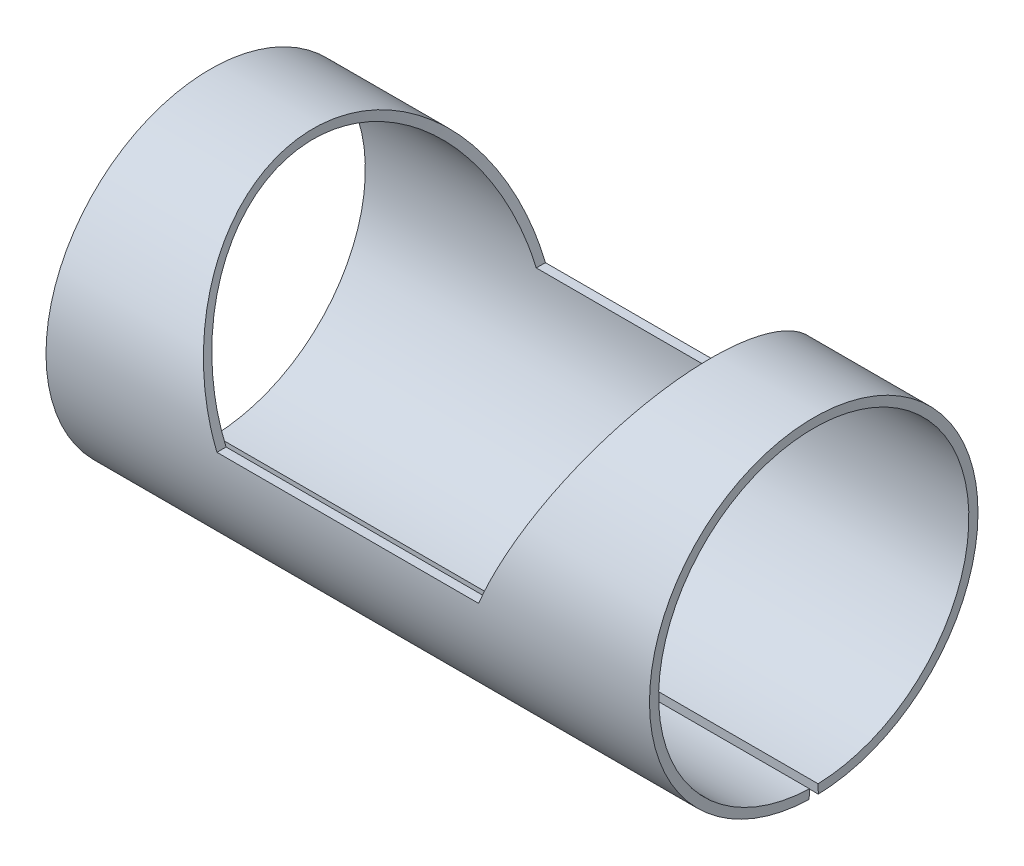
ISO-10303-21;
HEADER;
FILE_DESCRIPTION(('STEP AP214'),'2;1');
FILE_NAME('part.step','',(''),(''),'','','');
FILE_SCHEMA(('AUTOMOTIVE_DESIGN { 1 0 10303 214 1 1 1 1 }'));
ENDSEC;
DATA;
#1=APPLICATION_CONTEXT('core data for automotive mechanical design processes');
#2=APPLICATION_PROTOCOL_DEFINITION('international standard','automotive_design',2000,#1);
#3=PRODUCT_CONTEXT('',#1,'mechanical');
#4=PRODUCT('Part','Part','',(#3));
#5=PRODUCT_RELATED_PRODUCT_CATEGORY('part','',(#4));
#6=PRODUCT_DEFINITION_FORMATION('','',#4);
#7=PRODUCT_DEFINITION_CONTEXT('part definition',#1,'design');
#8=PRODUCT_DEFINITION('design','',#6,#7);
#9=PRODUCT_DEFINITION_SHAPE('','',#8);
#10=(LENGTH_UNIT() NAMED_UNIT(*) SI_UNIT(.MILLI.,.METRE.));
#11=(NAMED_UNIT(*) PLANE_ANGLE_UNIT() SI_UNIT($,.RADIAN.));
#12=(NAMED_UNIT(*) SI_UNIT($,.STERADIAN.) SOLID_ANGLE_UNIT());
#13=UNCERTAINTY_MEASURE_WITH_UNIT(LENGTH_MEASURE(1.E-05),#10,'distance_accuracy_value','');
#14=(GEOMETRIC_REPRESENTATION_CONTEXT(3) GLOBAL_UNCERTAINTY_ASSIGNED_CONTEXT((#13)) GLOBAL_UNIT_ASSIGNED_CONTEXT((#10,
#11,#12)) REPRESENTATION_CONTEXT('',''));
#15=CARTESIAN_POINT('',(0.,0.,0.));
#16=DIRECTION('',(0.,0.,1.));
#17=DIRECTION('',(1.,0.,0.));
#18=AXIS2_PLACEMENT_3D('',#15,#16,#17);
#19=CARTESIAN_POINT('',(14.3061626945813,2.85909067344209E-13,-17.9630248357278));
#20=CARTESIAN_POINT('',(14.617755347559,0.752264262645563,-17.9630248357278));
#21=CARTESIAN_POINT('',(14.8895386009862,1.40950845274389,-17.9165147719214));
#22=CARTESIAN_POINT('',(15.2378173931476,2.25021836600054,-17.823755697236));
#23=CARTESIAN_POINT('',(15.3439933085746,2.50632479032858,-17.788866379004));
#24=CARTESIAN_POINT('',(15.4883816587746,2.85453019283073,-17.7351546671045));
#25=CARTESIAN_POINT('',(15.5340318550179,2.96460940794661,-17.7170121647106));
#26=CARTESIAN_POINT('',(15.5987882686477,3.12079540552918,-17.6899318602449));
#27=CARTESIAN_POINT('',(15.6197539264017,3.17136870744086,-17.6809267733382));
#28=CARTESIAN_POINT('',(15.6502726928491,3.24500276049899,-17.6675080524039));
#29=CARTESIAN_POINT('',(15.6602906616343,3.26917646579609,-17.6630499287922));
#30=CARTESIAN_POINT('',(15.6750851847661,3.30488148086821,-17.6563916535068));
#31=CARTESIAN_POINT('',(15.6799779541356,3.31669056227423,-17.6541770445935));
#32=CARTESIAN_POINT('',(15.6872590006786,3.33426541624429,-17.6508631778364));
#33=CARTESIAN_POINT('',(15.6896763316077,3.34010057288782,-17.6497598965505));
#34=CARTESIAN_POINT('',(15.6932878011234,3.34881863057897,-17.6481070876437));
#35=CARTESIAN_POINT('',(15.694489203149,3.35171887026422,-17.6475565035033));
#36=CARTESIAN_POINT('',(15.6962876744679,3.35606056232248,-17.6467311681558));
#37=CARTESIAN_POINT('',(15.6968865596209,3.35750634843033,-17.6464561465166));
#38=CARTESIAN_POINT('',(15.6980831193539,3.36039503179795,-17.6459062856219));
#39=CARTESIAN_POINT('',(15.6982842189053,3.36088051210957,-17.6458139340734));
#40=CARTESIAN_POINT('',(15.9536508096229,3.97739008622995,-17.5283046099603));
#41=CARTESIAN_POINT('',(16.1934309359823,4.55671253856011,-17.3847110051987));
#42=CARTESIAN_POINT('',(16.5312118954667,5.37227824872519,-17.1431990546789));
#43=CARTESIAN_POINT('',(16.640157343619,5.6352553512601,-17.0583269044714));
#44=CARTESIAN_POINT('',(16.7981032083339,6.01644539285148,-16.9260372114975));
#45=CARTESIAN_POINT('',(16.8498397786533,6.14129735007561,-16.8811093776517));
#46=CARTESIAN_POINT('',(16.9260765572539,6.32527348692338,-16.8126576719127));
#47=CARTESIAN_POINT('',(16.9512608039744,6.38604863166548,-16.7896637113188));
#48=CARTESIAN_POINT('',(16.9886951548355,6.47638847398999,-16.7549304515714));
#49=CARTESIAN_POINT('',(17.0011162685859,6.50636461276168,-16.7433123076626));
#50=CARTESIAN_POINT('',(17.0196624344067,6.55112345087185,-16.7258273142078));
#51=CARTESIAN_POINT('',(17.0258302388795,6.56600883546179,-16.7199893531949));
#52=CARTESIAN_POINT('',(17.0350605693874,6.58828561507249,-16.7112183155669));
#53=CARTESIAN_POINT('',(17.0381337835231,6.59570265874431,-16.7082922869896));
#54=CARTESIAN_POINT('',(17.0427382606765,6.60681540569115,-16.7038997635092));
#55=CARTESIAN_POINT('',(17.0442721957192,6.61051751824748,-16.7024350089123));
#56=CARTESIAN_POINT('',(17.0473382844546,6.61791747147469,-16.6995043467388));
#57=CARTESIAN_POINT('',(17.0485759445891,6.62090455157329,-16.6983204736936));
#58=CARTESIAN_POINT('',(17.2840985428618,7.18933863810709,-16.4727620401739));
#59=CARTESIAN_POINT('',(17.5064306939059,7.72630231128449,-16.2266140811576));
#60=CARTESIAN_POINT('',(17.8228818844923,8.49033286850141,-15.8324550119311));
#61=CARTESIAN_POINT('',(17.9255244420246,8.73812141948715,-15.6969062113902));
#62=CARTESIAN_POINT('',(18.0752265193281,9.09948652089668,-15.4883488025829));
#63=CARTESIAN_POINT('',(18.1244169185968,9.21822268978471,-15.417956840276));
#64=CARTESIAN_POINT('',(18.1971370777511,9.39375696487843,-15.3111815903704));
#65=CARTESIAN_POINT('',(18.2211995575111,9.45184010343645,-15.2753919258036));
#66=CARTESIAN_POINT('',(18.2570269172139,9.53832380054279,-15.2214255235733));
#67=CARTESIAN_POINT('',(18.2689249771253,9.56704486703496,-15.2033897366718));
#68=CARTESIAN_POINT('',(18.2867054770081,9.60996641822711,-15.1762674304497));
#69=CARTESIAN_POINT('',(18.2926212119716,9.62424692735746,-15.1672152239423));
#70=CARTESIAN_POINT('',(18.3014781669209,9.64562770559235,-15.1536199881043));
#71=CARTESIAN_POINT('',(18.3044277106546,9.65274796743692,-15.1490854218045));
#72=CARTESIAN_POINT('',(18.3103212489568,9.66697516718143,-15.140010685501));
#73=CARTESIAN_POINT('',(18.312908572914,9.67322108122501,-15.1360214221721));
#74=CARTESIAN_POINT('',(18.5272714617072,10.1907057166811,-14.8049205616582));
#75=CARTESIAN_POINT('',(18.7273454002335,10.6739031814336,-14.4594718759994));
#76=CARTESIAN_POINT('',(19.0109697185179,11.3586619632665,-13.9188946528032));
#77=CARTESIAN_POINT('',(19.1027633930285,11.5802522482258,-13.7349640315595));
#78=CARTESIAN_POINT('',(19.2363322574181,11.9026613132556,-13.4542639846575));
#79=CARTESIAN_POINT('',(19.2801682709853,12.0084688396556,-13.3598963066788));
#80=CARTESIAN_POINT('',(19.344891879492,12.164693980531,-13.2172408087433));
#81=CARTESIAN_POINT('',(19.3662946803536,12.216354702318,-13.169504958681));
#82=CARTESIAN_POINT('',(19.3981412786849,12.2932254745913,-13.0976371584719));
#83=CARTESIAN_POINT('',(19.4087138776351,12.3187456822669,-13.0736372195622));
#84=CARTESIAN_POINT('',(19.4245083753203,12.3568710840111,-13.0375727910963));
#85=CARTESIAN_POINT('',(19.4297624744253,12.3695537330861,-13.0255405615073));
#86=CARTESIAN_POINT('',(19.4376275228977,12.3885390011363,-13.0074762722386));
#87=CARTESIAN_POINT('',(19.4402465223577,12.3948609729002,-13.0014521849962));
#88=CARTESIAN_POINT('',(19.4454791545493,12.4074920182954,-12.9893987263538));
#89=CARTESIAN_POINT('',(19.4477860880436,12.4130607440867,-12.9840779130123));
#90=CARTESIAN_POINT('',(19.8241627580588,13.3216044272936,-12.1145461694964));
#91=CARTESIAN_POINT('',(20.1511179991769,14.1127289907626,-11.1769579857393));
#92=CARTESIAN_POINT('',(20.5717951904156,15.1283385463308,-9.70357903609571));
#93=CARTESIAN_POINT('',(20.7003949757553,15.4384864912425,-9.20125203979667));
#94=CARTESIAN_POINT('',(20.8758557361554,15.8614509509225,-8.43620446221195));
#95=CARTESIAN_POINT('',(20.9314361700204,15.9954026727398,-8.17925910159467));
#96=CARTESIAN_POINT('',(21.0104470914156,16.1858711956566,-7.79157019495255));
#97=CARTESIAN_POINT('',(21.036057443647,16.2476178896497,-7.661961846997));
#98=CARTESIAN_POINT('',(21.0733830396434,16.3376388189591,-7.46705700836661));
#99=CARTESIAN_POINT('',(21.0856432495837,16.3672126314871,-7.40200666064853));
#100=CARTESIAN_POINT('',(21.1037610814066,16.4109256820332,-7.30431736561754));
#101=CARTESIAN_POINT('',(21.109754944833,16.4253887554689,-7.27173530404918));
#102=CARTESIAN_POINT('',(21.1186776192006,16.4469217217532,-7.22283492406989));
#103=CARTESIAN_POINT('',(21.1216404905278,16.454072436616,-7.20653024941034));
#104=CARTESIAN_POINT('',(21.1260677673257,16.4647581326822,-7.18206655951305));
#105=CARTESIAN_POINT('',(21.1275406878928,16.4683133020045,-7.1739108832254));
#106=CARTESIAN_POINT('',(21.1304808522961,16.4754101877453,-7.15759732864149));
#107=CARTESIAN_POINT('',(21.1318154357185,16.4786316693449,-7.15017857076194));
#108=CARTESIAN_POINT('',(21.3378369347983,16.9759560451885,-6.00232525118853));
#109=CARTESIAN_POINT('',(21.491155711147,17.3474661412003,-4.82015832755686));
#110=CARTESIAN_POINT('',(21.6955819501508,17.8409828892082,-2.42236194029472));
#111=CARTESIAN_POINT('',(21.7466894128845,17.9630240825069,-1.20675453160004));
#112=CARTESIAN_POINT('',(21.7466930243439,17.9630255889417,1.20673210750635));
#113=CARTESIAN_POINT('',(21.6955881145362,17.840996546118,2.42225915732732));
#114=CARTESIAN_POINT('',(21.5422706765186,17.4708710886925,4.22060228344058));
#115=CARTESIAN_POINT('',(21.4783881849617,17.3163960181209,4.81586502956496));
#116=CARTESIAN_POINT('',(21.3633994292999,17.0382876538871,5.69754170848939));
#117=CARTESIAN_POINT('',(21.3218756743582,16.937857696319,5.98956352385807));
#118=CARTESIAN_POINT('',(21.254798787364,16.7757037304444,6.42416795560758));
#119=CARTESIAN_POINT('',(21.2316412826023,16.7197345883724,6.5684646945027));
#120=CARTESIAN_POINT('',(21.1957072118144,16.632917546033,6.78397472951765));
#121=CARTESIAN_POINT('',(21.1835295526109,16.6035013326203,6.85565556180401));
#122=CARTESIAN_POINT('',(21.1649636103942,16.5586630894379,6.9629332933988));
#123=CARTESIAN_POINT('',(21.1587250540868,16.5435980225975,6.99865195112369));
#124=CARTESIAN_POINT('',(21.1492923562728,16.5208221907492,7.05216784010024));
#125=CARTESIAN_POINT('',(21.1461356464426,16.5132005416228,7.06999612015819));
#126=CARTESIAN_POINT('',(21.1413818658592,16.5017235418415,7.09672286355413));
#127=CARTESIAN_POINT('',(21.1397941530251,16.4978904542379,7.10562916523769));
#128=CARTESIAN_POINT('',(21.136612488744,16.490209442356,7.12343651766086));
#129=CARTESIAN_POINT('',(21.1348857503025,16.4860409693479,7.13307741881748));
#130=CARTESIAN_POINT('',(20.9459931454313,16.0300529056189,8.18553193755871));
#131=CARTESIAN_POINT('',(20.7120536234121,15.4669441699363,9.21233687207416));
#132=CARTESIAN_POINT('',(20.2913775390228,14.4513443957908,10.6857250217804));
#133=CARTESIAN_POINT('',(20.139524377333,14.0844147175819,11.1656571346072));
#134=CARTESIAN_POINT('',(19.8943029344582,13.4917508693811,11.8632210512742));
#135=CARTESIAN_POINT('',(19.8096555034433,13.2871585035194,12.0920171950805));
#136=CARTESIAN_POINT('',(19.6783239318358,12.9698214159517,12.4289095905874));
#137=CARTESIAN_POINT('',(19.6338200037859,12.8623014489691,12.5401566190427));
#138=CARTESIAN_POINT('',(19.5659740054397,12.6984280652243,12.7053611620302));
#139=CARTESIAN_POINT('',(19.543176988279,12.6433713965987,12.7601516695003));
#140=CARTESIAN_POINT('',(19.5087089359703,12.560140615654,12.8419095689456));
#141=CARTESIAN_POINT('',(19.4971741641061,12.5322893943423,12.8690908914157));
#142=CARTESIAN_POINT('',(19.4798038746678,12.4903514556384,12.9097544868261));
#143=CARTESIAN_POINT('',(19.4740024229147,12.4763452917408,12.9232909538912));
#144=CARTESIAN_POINT('',(19.4652832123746,12.4552958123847,12.9435683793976));
#145=CARTESIAN_POINT('',(19.4623739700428,12.4482726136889,12.9503229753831));
#146=CARTESIAN_POINT('',(19.4565498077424,12.4342128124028,12.9638230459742));
#147=CARTESIAN_POINT('',(19.4533268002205,12.4264325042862,12.9712802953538));
#148=CARTESIAN_POINT('',(19.2836981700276,12.016958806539,13.3631733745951));
#149=CARTESIAN_POINT('',(19.1056456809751,11.5872509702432,13.7384189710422));
#150=CARTESIAN_POINT('',(18.8220166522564,10.902500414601,14.2790166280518));
#151=CARTESIAN_POINT('',(18.7247152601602,10.6675605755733,14.4554986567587));
#152=CARTESIAN_POINT('',(18.5746255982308,10.3051504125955,14.7138079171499));
#153=CARTESIAN_POINT('',(18.5239061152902,10.1826808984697,14.7988417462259));
#154=CARTESIAN_POINT('',(18.446792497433,9.99648736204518,14.9246813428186));
#155=CARTESIAN_POINT('',(18.4209155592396,9.93400801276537,14.9663426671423));
#156=CARTESIAN_POINT('',(18.3818415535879,9.83966834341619,15.0283932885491));
#157=CARTESIAN_POINT('',(18.3687737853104,9.80811834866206,15.0490032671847));
#158=CARTESIAN_POINT('',(18.3491074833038,9.76063842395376,15.0798061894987));
#159=CARTESIAN_POINT('',(18.3425412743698,9.74478596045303,15.0900551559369));
#160=CARTESIAN_POINT('',(18.3326757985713,9.72096856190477,15.1054003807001));
#161=CARTESIAN_POINT('',(18.3293846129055,9.71302297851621,15.1105107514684));
#162=CARTESIAN_POINT('',(18.3227968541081,9.69711891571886,15.12072204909));
#163=CARTESIAN_POINT('',(18.3191436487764,9.68829947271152,15.1263738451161));
#164=CARTESIAN_POINT('',(18.1278723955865,9.22654199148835,15.4218195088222));
#165=CARTESIAN_POINT('',(17.9282254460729,8.74465514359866,15.7012662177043));
#166=CARTESIAN_POINT('',(17.6117775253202,7.98061275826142,16.0954094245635));
#167=CARTESIAN_POINT('',(17.5034653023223,7.71907429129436,16.2226117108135));
#168=CARTESIAN_POINT('',(17.3367525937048,7.31654428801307,16.4061020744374));
#169=CARTESIAN_POINT('',(17.2804742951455,7.18066471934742,16.4660462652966));
#170=CARTESIAN_POINT('',(17.1949957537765,6.97430671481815,16.5539994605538));
#171=CARTESIAN_POINT('',(17.1663260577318,6.90509765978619,16.5829899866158));
#172=CARTESIAN_POINT('',(17.1230562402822,6.80065196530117,16.6259679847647));
#173=CARTESIAN_POINT('',(17.1085887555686,6.76573138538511,16.6402093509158));
#174=CARTESIAN_POINT('',(17.0868212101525,6.71319283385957,16.6614423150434));
#175=CARTESIAN_POINT('',(17.0795543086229,6.69565370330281,16.6684984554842));
#176=CARTESIAN_POINT('',(17.068637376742,6.66930563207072,16.6790501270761));
#177=CARTESIAN_POINT('',(17.064995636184,6.66051637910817,16.6825619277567));
#178=CARTESIAN_POINT('',(17.0595288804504,6.64732266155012,16.687821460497));
#179=CARTESIAN_POINT('',(17.0577059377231,6.64292311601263,16.6895732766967));
#180=CARTESIAN_POINT('',(17.0540586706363,6.63412074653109,16.6930741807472));
#181=CARTESIAN_POINT('',(17.0519441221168,6.62901750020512,16.6951012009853));
#182=CARTESIAN_POINT('',(16.8539560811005,6.1511963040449,16.8847039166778));
#183=CARTESIAN_POINT('',(16.6431354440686,5.64250067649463,17.0632350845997));
#184=CARTESIAN_POINT('',(16.305353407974,4.82691244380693,17.3046688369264));
#185=CARTESIAN_POINT('',(16.1891675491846,4.5463088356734,17.3807365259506));
#186=CARTESIAN_POINT('',(16.0095009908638,4.11238282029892,17.4865872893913));
#187=CARTESIAN_POINT('',(15.9487141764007,3.96557207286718,17.5204948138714));
#188=CARTESIAN_POINT('',(15.856187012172,3.74212724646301,17.5690795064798));
#189=CARTESIAN_POINT('',(15.8251201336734,3.66710761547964,17.5848949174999));
#190=CARTESIAN_POINT('',(15.7781830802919,3.55377507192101,17.6080217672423));
#191=CARTESIAN_POINT('',(15.7624812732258,3.51586371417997,17.6156313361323));
#192=CARTESIAN_POINT('',(15.7388443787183,3.45879646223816,17.626893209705));
#193=CARTESIAN_POINT('',(15.7309513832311,3.43974067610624,17.6306217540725));
#194=CARTESIAN_POINT('',(15.7190908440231,3.4111070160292,17.6361760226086));
#195=CARTESIAN_POINT('',(15.715133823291,3.40155413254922,17.6380210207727));
#196=CARTESIAN_POINT('',(15.7091930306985,3.38721232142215,17.640778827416));
#197=CARTESIAN_POINT('',(15.7072118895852,3.38242963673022,17.6416964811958));
#198=CARTESIAN_POINT('',(15.7042388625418,3.37525248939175,17.6430705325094));
#199=CARTESIAN_POINT('',(15.7032476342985,3.37285958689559,17.6435281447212));
#200=CARTESIAN_POINT('',(15.7012647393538,3.36807274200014,17.6444425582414));
#201=CARTESIAN_POINT('',(15.6998805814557,3.3647313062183,17.6450799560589));
#202=CARTESIAN_POINT('',(15.5458361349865,2.99286030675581,17.7159602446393));
#203=CARTESIAN_POINT('',(15.3530204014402,2.5283237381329,17.7931390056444));
#204=CARTESIAN_POINT('',(14.8886475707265,1.407360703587,17.9166836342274));
#205=CARTESIAN_POINT('',(14.6171604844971,0.750826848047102,17.9630248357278));
#206=CARTESIAN_POINT('',(14.3061626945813,0.,17.9630248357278));
#207=CARTESIAN_POINT('',(14.3061626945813,2.69799391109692E-13,-16.9630248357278));
#208=CARTESIAN_POINT('',(14.617754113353,0.710382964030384,-16.9630248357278));
#209=CARTESIAN_POINT('',(14.8895386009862,1.33104124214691,-16.9191039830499));
#210=CARTESIAN_POINT('',(15.2378173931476,2.12494890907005,-16.8315087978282));
#211=CARTESIAN_POINT('',(15.3439933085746,2.36679791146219,-16.7985617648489));
#212=CARTESIAN_POINT('',(15.4883816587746,2.695618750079,-16.7478401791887));
#213=CARTESIAN_POINT('',(15.5340318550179,2.79956986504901,-16.7307076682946));
#214=CARTESIAN_POINT('',(15.5987882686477,2.94706100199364,-16.7051349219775));
#215=CARTESIAN_POINT('',(15.6197539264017,2.99481889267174,-16.6966311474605));
#216=CARTESIAN_POINT('',(15.6502726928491,3.06435374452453,-16.6839594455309));
#217=CARTESIAN_POINT('',(15.6602906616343,3.08718170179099,-16.6797495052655));
#218=CARTESIAN_POINT('',(15.6750851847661,3.12089902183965,-16.6734618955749));
#219=CARTESIAN_POINT('',(15.6799779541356,3.1320506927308,-16.6713705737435));
#220=CARTESIAN_POINT('',(15.6872590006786,3.14864715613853,-16.6682411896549));
#221=CARTESIAN_POINT('',(15.6896763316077,3.15415747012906,-16.6671993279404));
#222=CARTESIAN_POINT('',(15.6932878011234,3.16239019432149,-16.6656385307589));
#223=CARTESIAN_POINT('',(15.694489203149,3.1651289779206,-16.6651185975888));
#224=CARTESIAN_POINT('',(15.6962876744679,3.16922896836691,-16.6643392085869));
#225=CARTESIAN_POINT('',(15.6968865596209,3.17059426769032,-16.664079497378));
#226=CARTESIAN_POINT('',(15.6980831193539,3.17332213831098,-16.6635602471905));
#227=CARTESIAN_POINT('',(15.6982842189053,3.17378059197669,-16.6634730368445));
#228=CARTESIAN_POINT('',(15.9536508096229,3.75596913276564,-16.5525054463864));
#229=CARTESIAN_POINT('',(16.1934309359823,4.30304075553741,-16.4169056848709));
#230=CARTESIAN_POINT('',(16.5312118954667,5.0732039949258,-16.188838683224));
#231=CARTESIAN_POINT('',(16.640157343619,5.32154118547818,-16.1086913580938));
#232=CARTESIAN_POINT('',(16.7981032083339,5.68151041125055,-15.9837662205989));
#233=CARTESIAN_POINT('',(16.8498397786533,5.79941187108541,-15.94133951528));
#234=CARTESIAN_POINT('',(16.9260765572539,5.97314607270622,-15.8766985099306));
#235=CARTESIAN_POINT('',(16.9512608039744,6.03053787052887,-15.8549846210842));
#236=CARTESIAN_POINT('',(16.9886951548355,6.11584850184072,-15.8221849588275));
#237=CARTESIAN_POINT('',(17.0011162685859,6.14415587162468,-15.8112135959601));
#238=CARTESIAN_POINT('',(17.0196624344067,6.18642298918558,-15.7947019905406));
#239=CARTESIAN_POINT('',(17.0258302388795,6.20047970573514,-15.7891890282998));
#240=CARTESIAN_POINT('',(17.0350605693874,6.22151633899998,-15.7809062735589));
#241=CARTESIAN_POINT('',(17.0381337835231,6.22852047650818,-15.7781431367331));
#242=CARTESIAN_POINT('',(17.0427382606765,6.23901457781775,-15.7739951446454));
#243=CARTESIAN_POINT('',(17.0442721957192,6.2425105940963,-15.772611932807));
#244=CARTESIAN_POINT('',(17.0473382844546,6.24949859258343,-15.7698444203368));
#245=CARTESIAN_POINT('',(17.0485759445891,6.25231938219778,-15.7687264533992));
#246=CARTESIAN_POINT('',(17.2840985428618,6.78910879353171,-15.5557248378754));
#247=CARTESIAN_POINT('',(17.5064306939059,7.29617974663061,-15.323279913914));
#248=CARTESIAN_POINT('',(17.8228818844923,8.01767679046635,-14.9510636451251));
#249=CARTESIAN_POINT('',(17.9255244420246,8.25167097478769,-14.8230608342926));
#250=CARTESIAN_POINT('',(18.0752265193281,8.59291891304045,-14.6261137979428));
#251=CARTESIAN_POINT('',(18.1244169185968,8.70504504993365,-14.5596405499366));
#252=CARTESIAN_POINT('',(18.1971370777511,8.87080734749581,-14.4588094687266));
#253=CARTESIAN_POINT('',(18.2211995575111,8.92565700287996,-14.425012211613));
#254=CARTESIAN_POINT('',(18.2570269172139,9.00732616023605,-14.3740501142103));
#255=CARTESIAN_POINT('',(18.2689249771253,9.03444832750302,-14.3570183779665));
#256=CARTESIAN_POINT('',(18.2867054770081,9.07498043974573,-14.3314059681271));
#257=CARTESIAN_POINT('',(18.2926212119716,9.08846595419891,-14.3228576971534));
#258=CARTESIAN_POINT('',(18.3014781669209,9.10865646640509,-14.3100193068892));
#259=CARTESIAN_POINT('',(18.3044277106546,9.11538034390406,-14.3057371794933));
#260=CARTESIAN_POINT('',(18.3103212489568,9.12881551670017,-14.2971676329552));
#261=CARTESIAN_POINT('',(18.312908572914,9.13471372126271,-14.2934004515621));
#262=CARTESIAN_POINT('',(18.5272714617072,9.62339003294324,-13.9807319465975));
#263=CARTESIAN_POINT('',(18.7273454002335,10.0796879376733,-13.6545143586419));
#264=CARTESIAN_POINT('',(19.0109697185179,10.7263262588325,-13.1440310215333));
#265=CARTESIAN_POINT('',(19.1027633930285,10.9355806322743,-12.970339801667));
#266=CARTESIAN_POINT('',(19.2363322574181,11.2400412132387,-12.7052663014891));
#267=CARTESIAN_POINT('',(19.2801682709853,11.339958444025,-12.6161520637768));
#268=CARTESIAN_POINT('',(19.344891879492,11.4874865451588,-12.4814381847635));
#269=CARTESIAN_POINT('',(19.3662946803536,11.5362713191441,-12.4363597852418));
#270=CARTESIAN_POINT('',(19.3981412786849,11.6088627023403,-12.3684928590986));
#271=CARTESIAN_POINT('',(19.4087138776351,11.6329622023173,-12.3458289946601));
#272=CARTESIAN_POINT('',(19.4245083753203,11.6689651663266,-12.3117722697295));
#273=CARTESIAN_POINT('',(19.4297624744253,11.680941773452,-12.3004098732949));
#274=CARTESIAN_POINT('',(19.4376275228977,11.6988701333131,-12.2833512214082));
#275=CARTESIAN_POINT('',(19.4402465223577,11.7048401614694,-12.2776624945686));
#276=CARTESIAN_POINT('',(19.4454791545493,11.7167680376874,-12.2662800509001));
#277=CARTESIAN_POINT('',(19.4477860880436,11.7220267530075,-12.2612554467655));
#278=CARTESIAN_POINT('',(19.8241627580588,12.579991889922,-11.4401304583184));
#279=CARTESIAN_POINT('',(20.1511179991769,13.3270746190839,-10.5547377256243));
#280=CARTESIAN_POINT('',(20.5717951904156,14.2861452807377,-9.1633816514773));
#281=CARTESIAN_POINT('',(20.7003949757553,14.579027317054,-8.68901915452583));
#282=CARTESIAN_POINT('',(20.8758557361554,14.9784453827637,-7.966561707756));
#283=CARTESIAN_POINT('',(20.9314361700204,15.1049400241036,-7.72392047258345));
#284=CARTESIAN_POINT('',(21.0104470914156,15.2848051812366,-7.35781417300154));
#285=CARTESIAN_POINT('',(21.036057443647,15.3431144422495,-7.23542111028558));
#286=CARTESIAN_POINT('',(21.0733830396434,15.4281239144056,-7.05136660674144));
#287=CARTESIAN_POINT('',(21.0856432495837,15.4560513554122,-6.98993760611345));
#288=CARTESIAN_POINT('',(21.1037610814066,15.49733090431,-6.89768666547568));
#289=CARTESIAN_POINT('',(21.109754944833,15.5109888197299,-6.8669184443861));
#290=CARTESIAN_POINT('',(21.1186776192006,15.5313230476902,-6.82074034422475));
#291=CARTESIAN_POINT('',(21.1216404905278,15.5380756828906,-6.80534334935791));
#292=CARTESIAN_POINT('',(21.1260677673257,15.5481665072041,-6.78224155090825));
#293=CARTESIAN_POINT('',(21.1275406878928,15.5515237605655,-6.77453990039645));
#294=CARTESIAN_POINT('',(21.1304808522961,15.5582255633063,-6.75913451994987));
#295=CARTESIAN_POINT('',(21.1318154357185,15.5612677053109,-6.75212876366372));
#296=CARTESIAN_POINT('',(21.3378369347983,16.0309060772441,-5.66817633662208));
#297=CARTESIAN_POINT('',(21.491155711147,16.3817342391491,-4.55182054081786));
#298=CARTESIAN_POINT('',(21.6955819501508,16.8477769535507,-2.28750926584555));
#299=CARTESIAN_POINT('',(21.7466894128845,16.9630241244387,-1.13957461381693));
#300=CARTESIAN_POINT('',(21.7466930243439,16.9630255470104,1.13955343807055));
#301=CARTESIAN_POINT('',(21.6955881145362,16.8477898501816,2.28741220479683));
#302=CARTESIAN_POINT('',(21.5422706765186,16.4982692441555,3.98564172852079));
#303=CARTESIAN_POINT('',(21.4783881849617,16.3523937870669,4.54776625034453));
#304=CARTESIAN_POINT('',(21.3633994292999,16.0897676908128,5.38036006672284));
#305=CARTESIAN_POINT('',(21.3218756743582,15.9949286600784,5.65612505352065));
#306=CARTESIAN_POINT('',(21.254798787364,15.8418017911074,6.06653509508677));
#307=CARTESIAN_POINT('',(21.2316412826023,15.7889484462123,6.20279884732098));
#308=CARTESIAN_POINT('',(21.1957072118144,15.7069645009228,6.4063114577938));
#309=CARTESIAN_POINT('',(21.1835295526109,15.6791858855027,6.47400182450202));
#310=CARTESIAN_POINT('',(21.1649636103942,15.6368437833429,6.57530741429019));
#311=CARTESIAN_POINT('',(21.1587250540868,15.6226173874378,6.60903761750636));
#312=CARTESIAN_POINT('',(21.1492923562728,15.6011094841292,6.65957428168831));
#313=CARTESIAN_POINT('',(21.1461356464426,15.5939121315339,6.67641006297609));
#314=CARTESIAN_POINT('',(21.1413818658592,15.5830740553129,6.70164893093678));
#315=CARTESIAN_POINT('',(21.1397941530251,15.5794543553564,6.71005941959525));
#316=CARTESIAN_POINT('',(21.136612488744,15.5722009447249,6.72687543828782));
#317=CARTESIAN_POINT('',(21.1348857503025,15.5682645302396,6.73597963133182));
#318=CARTESIAN_POINT('',(20.9459931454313,15.1376612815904,7.72984410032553));
#319=CARTESIAN_POINT('',(20.7120536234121,14.6059007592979,8.69948689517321));
#320=CARTESIAN_POINT('',(20.2913775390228,13.6468393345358,10.0908516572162));
#321=CARTESIAN_POINT('',(20.139524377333,13.3003365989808,10.5440659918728));
#322=CARTESIAN_POINT('',(19.8943029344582,12.7406662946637,11.202796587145));
#323=CARTESIAN_POINT('',(19.8096555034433,12.5474635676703,11.4188556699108));
#324=CARTESIAN_POINT('',(19.6783239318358,12.2477926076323,11.7369932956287));
#325=CARTESIAN_POINT('',(19.6338200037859,12.1462582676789,11.8420472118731));
#326=CARTESIAN_POINT('',(19.5659740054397,11.9915077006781,11.9980548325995));
#327=CARTESIAN_POINT('',(19.543176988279,11.9395160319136,12.0497951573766));
#328=CARTESIAN_POINT('',(19.5087089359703,11.8609187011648,12.1270016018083));
#329=CARTESIAN_POINT('',(19.4971741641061,11.8346179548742,12.1526697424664));
#330=CARTESIAN_POINT('',(19.4798038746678,11.7950146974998,12.1910695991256));
#331=CARTESIAN_POINT('',(19.4740024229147,11.7817882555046,12.2038524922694));
#332=CARTESIAN_POINT('',(19.4652832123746,11.7619105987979,12.2230010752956));
#333=CARTESIAN_POINT('',(19.4623739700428,11.7552783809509,12.2293796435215));
#334=CARTESIAN_POINT('',(19.4565498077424,11.7420012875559,12.2421281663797));
#335=CARTESIAN_POINT('',(19.4533268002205,11.7346541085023,12.2491702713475));
#336=CARTESIAN_POINT('',(19.2836981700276,11.3479757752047,12.6192466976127));
#337=CARTESIAN_POINT('',(19.1056456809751,10.9421897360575,12.9736024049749));
#338=CARTESIAN_POINT('',(18.8220166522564,10.2955591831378,13.4841050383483));
#339=CARTESIAN_POINT('',(18.7247152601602,10.0736984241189,13.650762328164));
#340=CARTESIAN_POINT('',(18.5746255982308,9.73146360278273,13.894691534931));
#341=CARTESIAN_POINT('',(18.5239061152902,9.61581195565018,13.9749915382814));
#342=CARTESIAN_POINT('',(18.446792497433,9.43998379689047,14.0938256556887));
#343=CARTESIAN_POINT('',(18.4209155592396,9.38098266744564,14.1331676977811));
#344=CARTESIAN_POINT('',(18.3818415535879,9.29189487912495,14.1917639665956));
#345=CARTESIAN_POINT('',(18.3687737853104,9.26210126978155,14.2112265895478));
#346=CARTESIAN_POINT('',(18.3491074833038,9.21726454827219,14.2403147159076));
#347=CARTESIAN_POINT('',(18.3425412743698,9.20229459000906,14.2499931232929));
#348=CARTESIAN_POINT('',(18.3326757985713,9.17980310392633,14.264484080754));
#349=CARTESIAN_POINT('',(18.3293846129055,9.17229985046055,14.2693099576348));
#350=CARTESIAN_POINT('',(18.3227968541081,9.15728116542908,14.278952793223));
#351=CARTESIAN_POINT('',(18.3191436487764,9.14895270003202,14.2842899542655));
#352=CARTESIAN_POINT('',(18.1278723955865,8.71290121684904,14.5632881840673));
#353=CARTESIAN_POINT('',(17.9282254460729,8.2578409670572,14.8271781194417));
#354=CARTESIAN_POINT('',(17.6117775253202,7.53633275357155,15.1993794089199));
#355=CARTESIAN_POINT('',(17.5034653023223,7.2893541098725,15.3195003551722));
#356=CARTESIAN_POINT('',(17.3367525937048,6.90923291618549,15.4927758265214));
#357=CARTESIAN_POINT('',(17.2804742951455,6.78091775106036,15.5493829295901));
#358=CARTESIAN_POINT('',(17.1949957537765,6.5860476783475,15.6324397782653));
#359=CARTESIAN_POINT('',(17.1663260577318,6.52069148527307,15.6598164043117));
#360=CARTESIAN_POINT('',(17.1230562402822,6.42206027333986,15.7004018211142));
#361=CARTESIAN_POINT('',(17.1085887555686,6.38908371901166,15.7138503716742));
#362=CARTESIAN_POINT('',(17.0868212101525,6.33946998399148,15.7339012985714));
#363=CARTESIAN_POINT('',(17.0795543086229,6.32290725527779,15.7405646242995));
#364=CARTESIAN_POINT('',(17.068637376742,6.29802597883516,15.7505288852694));
#365=CARTESIAN_POINT('',(17.064995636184,6.28972602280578,15.7538451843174));
#366=CARTESIAN_POINT('',(17.0595288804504,6.27726679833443,15.7588119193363));
#367=CARTESIAN_POINT('',(17.0577059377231,6.27311217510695,15.7604662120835));
#368=CARTESIAN_POINT('',(17.0540586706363,6.26479983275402,15.7637722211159));
#369=CARTESIAN_POINT('',(17.0519441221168,6.25998068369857,15.7656863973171));
#370=CARTESIAN_POINT('',(16.8539560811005,5.80875975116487,15.9447339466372));
#371=CARTESIAN_POINT('',(16.6431354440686,5.32838316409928,16.1133263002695));
#372=CARTESIAN_POINT('',(16.305353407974,4.55819865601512,16.3413194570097));
#373=CARTESIAN_POINT('',(16.1891675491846,4.29321622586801,16.4131524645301));
#374=CARTESIAN_POINT('',(16.0095009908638,3.88344683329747,16.5131105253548));
#375=CARTESIAN_POINT('',(15.9487141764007,3.74480902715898,16.5451304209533));
#376=CARTESIAN_POINT('',(15.856187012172,3.53380335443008,16.5910104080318));
#377=CARTESIAN_POINT('',(15.8251201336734,3.4629600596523,16.6059453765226));
#378=CARTESIAN_POINT('',(15.7781830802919,3.35593672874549,16.6277847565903));
#379=CARTESIAN_POINT('',(15.7624812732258,3.32013589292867,16.6349707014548));
#380=CARTESIAN_POINT('',(15.7388443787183,3.26624556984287,16.6456056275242));
#381=CARTESIAN_POINT('',(15.7309513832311,3.24825061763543,16.6491266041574));
#382=CARTESIAN_POINT('',(15.7190908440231,3.22121099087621,16.6543716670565));
#383=CARTESIAN_POINT('',(15.715133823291,3.2121899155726,16.6561139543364));
#384=CARTESIAN_POINT('',(15.7091930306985,3.19864651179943,16.6587182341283));
#385=CARTESIAN_POINT('',(15.7072118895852,3.19413007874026,16.6595848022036));
#386=CARTESIAN_POINT('',(15.7042388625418,3.18735248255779,16.6608823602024));
#387=CARTESIAN_POINT('',(15.7032476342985,3.18509279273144,16.6613144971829));
#388=CARTESIAN_POINT('',(15.7012647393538,3.18057243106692,16.6621780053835));
#389=CARTESIAN_POINT('',(15.6998805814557,3.1774170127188,16.6627799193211));
#390=CARTESIAN_POINT('',(15.5458361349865,2.82624803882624,16.7297143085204));
#391=CARTESIAN_POINT('',(15.3530204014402,2.38757217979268,16.8025965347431));
#392=CARTESIAN_POINT('',(14.8886475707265,1.32901305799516,16.9192634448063));
#393=CARTESIAN_POINT('',(14.6171592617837,0.709025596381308,16.9630248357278));
#394=CARTESIAN_POINT('',(14.3061626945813,0.,16.9630248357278));
#395=B_SPLINE_SURFACE_WITH_KNOTS('',1,3,((#19,#20,#21,#22,#23,#24,#25,#26,#27,#28,#29,#30,#31,
#32,#33,#34,#35,#36,#37,#38,#39,#40,#41,#42,#43,#44,#45,#46,#47,#48,#49,#50,#51,#52,#53,#54,#55,
#56,#57,#58,#59,#60,#61,#62,#63,#64,#65,#66,#67,#68,#69,#70,#71,#72,#73,#74,#75,#76,#77,#78,#79,
#80,#81,#82,#83,#84,#85,#86,#87,#88,#89,#90,#91,#92,#93,#94,#95,#96,#97,#98,#99,#100,#101,#102,
#103,#104,#105,#106,#107,#108,#109,#110,#111,#112,#113,#114,#115,#116,#117,#118,#119,#120,#121,
#122,#123,#124,#125,#126,#127,#128,#129,#130,#131,#132,#133,#134,#135,#136,#137,#138,#139,#140,
#141,#142,#143,#144,#145,#146,#147,#148,#149,#150,#151,#152,#153,#154,#155,#156,#157,#158,#159,
#160,#161,#162,#163,#164,#165,#166,#167,#168,#169,#170,#171,#172,#173,#174,#175,#176,#177,#178,
#179,#180,#181,#182,#183,#184,#185,#186,#187,#188,#189,#190,#191,#192,#193,#194,#195,#196,#197,
#198,#199,#200,#201,#202,#203,#204,#205,#206),(#207,#208,#209,#210,#211,#212,#213,#214,#215,
#216,#217,#218,#219,#220,#221,#222,#223,#224,#225,#226,#227,#228,#229,#230,#231,#232,#233,#234,
#235,#236,#237,#238,#239,#240,#241,#242,#243,#244,#245,#246,#247,#248,#249,#250,#251,#252,#253,
#254,#255,#256,#257,#258,#259,#260,#261,#262,#263,#264,#265,#266,#267,#268,#269,#270,#271,#272,
#273,#274,#275,#276,#277,#278,#279,#280,#281,#282,#283,#284,#285,#286,#287,#288,#289,#290,#291,
#292,#293,#294,#295,#296,#297,#298,#299,#300,#301,#302,#303,#304,#305,#306,#307,#308,#309,#310,
#311,#312,#313,#314,#315,#316,#317,#318,#319,#320,#321,#322,#323,#324,#325,#326,#327,#328,#329,
#330,#331,#332,#333,#334,#335,#336,#337,#338,#339,#340,#341,#342,#343,#344,#345,#346,#347,#348,
#349,#350,#351,#352,#353,#354,#355,#356,#357,#358,#359,#360,#361,#362,#363,#364,#365,#366,#367,
#368,#369,#370,#371,#372,#373,#374,#375,#376,#377,#378,#379,#380,#381,#382,#383,#384,#385,#386,
#387,#388,#389,#390,#391,#392,#393,#394)),.UNSPECIFIED.,.F.,.F.,.F.,(2,2),(4,2,2,2,2,2,2,2,2,2,
2,2,2,2,2,2,2,2,2,2,2,2,2,2,2,2,2,2,2,2,2,2,2,2,2,2,2,2,2,2,2,2,2,2,2,2,2,2,2,2,2,2,2,2,2,2,2,2,
2,2,2,2,2,2,2,2,2,2,2,2,2,2,2,2,2,2,2,2,2,2,2,2,2,2,2,2,2,2,2,2,2,2,2,4),(0.,1.),(0.,0.03125,
0.046875,0.0546875,0.05859375,0.060546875,0.0615234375,0.06201171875,0.062255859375,
0.0623779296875,0.0625,0.09375,0.109375,0.1171875,0.12109375,0.123046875,0.1240234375,
0.12451171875,0.124755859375,0.125,0.15625,0.171875,0.1796875,0.18359375,0.185546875,
0.1865234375,0.18701171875,0.1875,0.21875,0.234375,0.2421875,0.24609375,0.248046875,
0.2490234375,0.24951171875,0.25,0.3125,0.34375,0.359375,0.3671875,0.37109375,0.373046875,
0.3740234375,0.37451171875,0.375,0.4375,0.5,0.5625,0.59375,0.609375,0.6171875,0.62109375,
0.623046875,0.6240234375,0.62451171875,0.625,0.6875,0.71875,0.734375,0.7421875,0.74609375,
0.748046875,0.7490234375,0.74951171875,0.75,0.78125,0.796875,0.8046875,0.80859375,0.810546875,
0.8115234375,0.81201171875,0.8125,0.84375,0.859375,0.8671875,0.87109375,0.873046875,
0.8740234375,0.87451171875,0.874755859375,0.875,0.90625,0.921875,0.9296875,0.93359375,
0.935546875,0.9365234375,0.93701171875,0.937255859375,0.9373779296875,0.9375,0.96875,1.),.UNSPECIFIED.);
#396=CARTESIAN_POINT('',(14.3061626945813,2.85909067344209E-13,-17.9630248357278));
#397=CARTESIAN_POINT('',(14.3061626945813,2.69799391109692E-13,-16.9630248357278));
#398=B_SPLINE_CURVE_WITH_KNOTS('',1,(#396,#397),.UNSPECIFIED.,.F.,.F.,(2,2),(0.,1.),.UNSPECIFIED.);
#399=CARTESIAN_POINT('',(14.3061626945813,2.69799391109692E-13,-16.9630248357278));
#400=VERTEX_POINT('',#399);
#401=CARTESIAN_POINT('',(14.3061626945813,2.85909067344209E-13,-17.9630248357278));
#402=VERTEX_POINT('',#401);
#403=EDGE_CURVE('E13',#400,#402,#398,.F.);
#404=CARTESIAN_POINT('',(14.3061626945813,2.69799391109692E-13,-16.9630248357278));
#405=CARTESIAN_POINT('',(14.617754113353,0.710382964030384,-16.9630248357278));
#406=CARTESIAN_POINT('',(14.8895386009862,1.33104124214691,-16.9191039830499));
#407=CARTESIAN_POINT('',(15.2378173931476,2.12494890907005,-16.8315087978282));
#408=CARTESIAN_POINT('',(15.3439933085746,2.36679791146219,-16.7985617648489));
#409=CARTESIAN_POINT('',(15.4883816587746,2.695618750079,-16.7478401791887));
#410=CARTESIAN_POINT('',(15.5340318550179,2.79956986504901,-16.7307076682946));
#411=CARTESIAN_POINT('',(15.5987882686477,2.94706100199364,-16.7051349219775));
#412=CARTESIAN_POINT('',(15.6197539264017,2.99481889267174,-16.6966311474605));
#413=CARTESIAN_POINT('',(15.6502726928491,3.06435374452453,-16.6839594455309));
#414=CARTESIAN_POINT('',(15.6602906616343,3.08718170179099,-16.6797495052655));
#415=CARTESIAN_POINT('',(15.6750851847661,3.12089902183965,-16.6734618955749));
#416=CARTESIAN_POINT('',(15.6799779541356,3.1320506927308,-16.6713705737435));
#417=CARTESIAN_POINT('',(15.6872590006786,3.14864715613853,-16.6682411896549));
#418=CARTESIAN_POINT('',(15.6896763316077,3.15415747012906,-16.6671993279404));
#419=CARTESIAN_POINT('',(15.6932878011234,3.16239019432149,-16.6656385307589));
#420=CARTESIAN_POINT('',(15.694489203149,3.1651289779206,-16.6651185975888));
#421=CARTESIAN_POINT('',(15.6962876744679,3.16922896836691,-16.6643392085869));
#422=CARTESIAN_POINT('',(15.6968865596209,3.17059426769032,-16.664079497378));
#423=CARTESIAN_POINT('',(15.6980831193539,3.17332213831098,-16.6635602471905));
#424=CARTESIAN_POINT('',(15.6982842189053,3.17378059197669,-16.6634730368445));
#425=CARTESIAN_POINT('',(15.9536508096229,3.75596913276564,-16.5525054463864));
#426=CARTESIAN_POINT('',(16.1934309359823,4.30304075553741,-16.4169056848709));
#427=CARTESIAN_POINT('',(16.5312118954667,5.0732039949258,-16.188838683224));
#428=CARTESIAN_POINT('',(16.640157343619,5.32154118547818,-16.1086913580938));
#429=CARTESIAN_POINT('',(16.7981032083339,5.68151041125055,-15.9837662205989));
#430=CARTESIAN_POINT('',(16.8498397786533,5.79941187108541,-15.94133951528));
#431=CARTESIAN_POINT('',(16.9260765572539,5.97314607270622,-15.8766985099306));
#432=CARTESIAN_POINT('',(16.9512608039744,6.03053787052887,-15.8549846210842));
#433=CARTESIAN_POINT('',(16.9886951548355,6.11584850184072,-15.8221849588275));
#434=CARTESIAN_POINT('',(17.0011162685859,6.14415587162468,-15.8112135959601));
#435=CARTESIAN_POINT('',(17.0196624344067,6.18642298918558,-15.7947019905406));
#436=CARTESIAN_POINT('',(17.0258302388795,6.20047970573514,-15.7891890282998));
#437=CARTESIAN_POINT('',(17.0350605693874,6.22151633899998,-15.7809062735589));
#438=CARTESIAN_POINT('',(17.0381337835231,6.22852047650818,-15.7781431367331));
#439=CARTESIAN_POINT('',(17.0427382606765,6.23901457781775,-15.7739951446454));
#440=CARTESIAN_POINT('',(17.0442721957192,6.2425105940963,-15.772611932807));
#441=CARTESIAN_POINT('',(17.0473382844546,6.24949859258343,-15.7698444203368));
#442=CARTESIAN_POINT('',(17.0485759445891,6.25231938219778,-15.7687264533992));
#443=CARTESIAN_POINT('',(17.2840985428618,6.78910879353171,-15.5557248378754));
#444=CARTESIAN_POINT('',(17.5064306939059,7.29617974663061,-15.323279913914));
#445=CARTESIAN_POINT('',(17.8228818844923,8.01767679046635,-14.9510636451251));
#446=CARTESIAN_POINT('',(17.9255244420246,8.25167097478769,-14.8230608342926));
#447=CARTESIAN_POINT('',(18.0752265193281,8.59291891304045,-14.6261137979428));
#448=CARTESIAN_POINT('',(18.1244169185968,8.70504504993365,-14.5596405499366));
#449=CARTESIAN_POINT('',(18.1971370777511,8.87080734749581,-14.4588094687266));
#450=CARTESIAN_POINT('',(18.2211995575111,8.92565700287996,-14.425012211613));
#451=CARTESIAN_POINT('',(18.2570269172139,9.00732616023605,-14.3740501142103));
#452=CARTESIAN_POINT('',(18.2689249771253,9.03444832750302,-14.3570183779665));
#453=CARTESIAN_POINT('',(18.2867054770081,9.07498043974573,-14.3314059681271));
#454=CARTESIAN_POINT('',(18.2926212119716,9.08846595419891,-14.3228576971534));
#455=CARTESIAN_POINT('',(18.3014781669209,9.10865646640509,-14.3100193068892));
#456=CARTESIAN_POINT('',(18.3044277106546,9.11538034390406,-14.3057371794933));
#457=CARTESIAN_POINT('',(18.3103212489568,9.12881551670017,-14.2971676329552));
#458=CARTESIAN_POINT('',(18.312908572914,9.13471372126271,-14.2934004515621));
#459=CARTESIAN_POINT('',(18.5272714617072,9.62339003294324,-13.9807319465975));
#460=CARTESIAN_POINT('',(18.7273454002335,10.0796879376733,-13.6545143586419));
#461=CARTESIAN_POINT('',(19.0109697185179,10.7263262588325,-13.1440310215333));
#462=CARTESIAN_POINT('',(19.1027633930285,10.9355806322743,-12.970339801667));
#463=CARTESIAN_POINT('',(19.2363322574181,11.2400412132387,-12.7052663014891));
#464=CARTESIAN_POINT('',(19.2801682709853,11.339958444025,-12.6161520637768));
#465=CARTESIAN_POINT('',(19.344891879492,11.4874865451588,-12.4814381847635));
#466=CARTESIAN_POINT('',(19.3662946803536,11.5362713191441,-12.4363597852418));
#467=CARTESIAN_POINT('',(19.3981412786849,11.6088627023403,-12.3684928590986));
#468=CARTESIAN_POINT('',(19.4087138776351,11.6329622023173,-12.3458289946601));
#469=CARTESIAN_POINT('',(19.4245083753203,11.6689651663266,-12.3117722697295));
#470=CARTESIAN_POINT('',(19.4297624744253,11.680941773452,-12.3004098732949));
#471=CARTESIAN_POINT('',(19.4376275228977,11.6988701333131,-12.2833512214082));
#472=CARTESIAN_POINT('',(19.4402465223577,11.7048401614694,-12.2776624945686));
#473=CARTESIAN_POINT('',(19.4454791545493,11.7167680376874,-12.2662800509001));
#474=CARTESIAN_POINT('',(19.4477860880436,11.7220267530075,-12.2612554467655));
#475=CARTESIAN_POINT('',(19.8241627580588,12.579991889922,-11.4401304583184));
#476=CARTESIAN_POINT('',(20.1511179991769,13.3270746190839,-10.5547377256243));
#477=CARTESIAN_POINT('',(20.5717951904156,14.2861452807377,-9.1633816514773));
#478=CARTESIAN_POINT('',(20.7003949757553,14.579027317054,-8.68901915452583));
#479=CARTESIAN_POINT('',(20.8758557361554,14.9784453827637,-7.966561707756));
#480=CARTESIAN_POINT('',(20.9314361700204,15.1049400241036,-7.72392047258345));
#481=CARTESIAN_POINT('',(21.0104470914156,15.2848051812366,-7.35781417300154));
#482=CARTESIAN_POINT('',(21.036057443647,15.3431144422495,-7.23542111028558));
#483=CARTESIAN_POINT('',(21.0733830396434,15.4281239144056,-7.05136660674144));
#484=CARTESIAN_POINT('',(21.0856432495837,15.4560513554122,-6.98993760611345));
#485=CARTESIAN_POINT('',(21.1037610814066,15.49733090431,-6.89768666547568));
#486=CARTESIAN_POINT('',(21.109754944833,15.5109888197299,-6.8669184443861));
#487=CARTESIAN_POINT('',(21.1186776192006,15.5313230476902,-6.82074034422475));
#488=CARTESIAN_POINT('',(21.1216404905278,15.5380756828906,-6.80534334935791));
#489=CARTESIAN_POINT('',(21.1260677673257,15.5481665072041,-6.78224155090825));
#490=CARTESIAN_POINT('',(21.1275406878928,15.5515237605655,-6.77453990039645));
#491=CARTESIAN_POINT('',(21.1304808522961,15.5582255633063,-6.75913451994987));
#492=CARTESIAN_POINT('',(21.1318154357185,15.5612677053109,-6.75212876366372));
#493=CARTESIAN_POINT('',(21.3378369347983,16.0309060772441,-5.66817633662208));
#494=CARTESIAN_POINT('',(21.491155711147,16.3817342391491,-4.55182054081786));
#495=CARTESIAN_POINT('',(21.6955819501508,16.8477769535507,-2.28750926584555));
#496=CARTESIAN_POINT('',(21.7466894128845,16.9630241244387,-1.13957461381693));
#497=CARTESIAN_POINT('',(21.7466930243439,16.9630255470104,1.13955343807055));
#498=CARTESIAN_POINT('',(21.6955881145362,16.8477898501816,2.28741220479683));
#499=CARTESIAN_POINT('',(21.5422706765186,16.4982692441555,3.98564172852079));
#500=CARTESIAN_POINT('',(21.4783881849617,16.3523937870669,4.54776625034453));
#501=CARTESIAN_POINT('',(21.3633994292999,16.0897676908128,5.38036006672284));
#502=CARTESIAN_POINT('',(21.3218756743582,15.9949286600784,5.65612505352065));
#503=CARTESIAN_POINT('',(21.254798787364,15.8418017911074,6.06653509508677));
#504=CARTESIAN_POINT('',(21.2316412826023,15.7889484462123,6.20279884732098));
#505=CARTESIAN_POINT('',(21.1957072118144,15.7069645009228,6.4063114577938));
#506=CARTESIAN_POINT('',(21.1835295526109,15.6791858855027,6.47400182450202));
#507=CARTESIAN_POINT('',(21.1649636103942,15.6368437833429,6.57530741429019));
#508=CARTESIAN_POINT('',(21.1587250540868,15.6226173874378,6.60903761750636));
#509=CARTESIAN_POINT('',(21.1492923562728,15.6011094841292,6.65957428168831));
#510=CARTESIAN_POINT('',(21.1461356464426,15.5939121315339,6.67641006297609));
#511=CARTESIAN_POINT('',(21.1413818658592,15.5830740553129,6.70164893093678));
#512=CARTESIAN_POINT('',(21.1397941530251,15.5794543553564,6.71005941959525));
#513=CARTESIAN_POINT('',(21.136612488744,15.5722009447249,6.72687543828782));
#514=CARTESIAN_POINT('',(21.1348857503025,15.5682645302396,6.73597963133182));
#515=CARTESIAN_POINT('',(20.9459931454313,15.1376612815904,7.72984410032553));
#516=CARTESIAN_POINT('',(20.7120536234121,14.6059007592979,8.69948689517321));
#517=CARTESIAN_POINT('',(20.2913775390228,13.6468393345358,10.0908516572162));
#518=CARTESIAN_POINT('',(20.139524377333,13.3003365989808,10.5440659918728));
#519=CARTESIAN_POINT('',(19.8943029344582,12.7406662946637,11.202796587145));
#520=CARTESIAN_POINT('',(19.8096555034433,12.5474635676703,11.4188556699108));
#521=CARTESIAN_POINT('',(19.6783239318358,12.2477926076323,11.7369932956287));
#522=CARTESIAN_POINT('',(19.6338200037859,12.1462582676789,11.8420472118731));
#523=CARTESIAN_POINT('',(19.5659740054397,11.9915077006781,11.9980548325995));
#524=CARTESIAN_POINT('',(19.543176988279,11.9395160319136,12.0497951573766));
#525=CARTESIAN_POINT('',(19.5087089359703,11.8609187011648,12.1270016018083));
#526=CARTESIAN_POINT('',(19.4971741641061,11.8346179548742,12.1526697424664));
#527=CARTESIAN_POINT('',(19.4798038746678,11.7950146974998,12.1910695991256));
#528=CARTESIAN_POINT('',(19.4740024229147,11.7817882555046,12.2038524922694));
#529=CARTESIAN_POINT('',(19.4652832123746,11.7619105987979,12.2230010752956));
#530=CARTESIAN_POINT('',(19.4623739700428,11.7552783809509,12.2293796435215));
#531=CARTESIAN_POINT('',(19.4565498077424,11.7420012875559,12.2421281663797));
#532=CARTESIAN_POINT('',(19.4533268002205,11.7346541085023,12.2491702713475));
#533=CARTESIAN_POINT('',(19.2836981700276,11.3479757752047,12.6192466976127));
#534=CARTESIAN_POINT('',(19.1056456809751,10.9421897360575,12.9736024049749));
#535=CARTESIAN_POINT('',(18.8220166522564,10.2955591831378,13.4841050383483));
#536=CARTESIAN_POINT('',(18.7247152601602,10.0736984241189,13.650762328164));
#537=CARTESIAN_POINT('',(18.5746255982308,9.73146360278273,13.894691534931));
#538=CARTESIAN_POINT('',(18.5239061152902,9.61581195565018,13.9749915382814));
#539=CARTESIAN_POINT('',(18.446792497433,9.43998379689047,14.0938256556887));
#540=CARTESIAN_POINT('',(18.4209155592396,9.38098266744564,14.1331676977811));
#541=CARTESIAN_POINT('',(18.3818415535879,9.29189487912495,14.1917639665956));
#542=CARTESIAN_POINT('',(18.3687737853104,9.26210126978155,14.2112265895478));
#543=CARTESIAN_POINT('',(18.3491074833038,9.21726454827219,14.2403147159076));
#544=CARTESIAN_POINT('',(18.3425412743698,9.20229459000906,14.2499931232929));
#545=CARTESIAN_POINT('',(18.3326757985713,9.17980310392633,14.264484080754));
#546=CARTESIAN_POINT('',(18.3293846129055,9.17229985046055,14.2693099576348));
#547=CARTESIAN_POINT('',(18.3227968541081,9.15728116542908,14.278952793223));
#548=CARTESIAN_POINT('',(18.3191436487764,9.14895270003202,14.2842899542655));
#549=CARTESIAN_POINT('',(18.1278723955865,8.71290121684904,14.5632881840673));
#550=CARTESIAN_POINT('',(17.9282254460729,8.2578409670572,14.8271781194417));
#551=CARTESIAN_POINT('',(17.6117775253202,7.53633275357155,15.1993794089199));
#552=CARTESIAN_POINT('',(17.5034653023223,7.2893541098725,15.3195003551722));
#553=CARTESIAN_POINT('',(17.3367525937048,6.90923291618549,15.4927758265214));
#554=CARTESIAN_POINT('',(17.2804742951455,6.78091775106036,15.5493829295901));
#555=CARTESIAN_POINT('',(17.1949957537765,6.5860476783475,15.6324397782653));
#556=CARTESIAN_POINT('',(17.1663260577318,6.52069148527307,15.6598164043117));
#557=CARTESIAN_POINT('',(17.1230562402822,6.42206027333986,15.7004018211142));
#558=CARTESIAN_POINT('',(17.1085887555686,6.38908371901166,15.7138503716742));
#559=CARTESIAN_POINT('',(17.0868212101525,6.33946998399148,15.7339012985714));
#560=CARTESIAN_POINT('',(17.0795543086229,6.32290725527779,15.7405646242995));
#561=CARTESIAN_POINT('',(17.068637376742,6.29802597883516,15.7505288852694));
#562=CARTESIAN_POINT('',(17.064995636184,6.28972602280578,15.7538451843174));
#563=CARTESIAN_POINT('',(17.0595288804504,6.27726679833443,15.7588119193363));
#564=CARTESIAN_POINT('',(17.0577059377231,6.27311217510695,15.7604662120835));
#565=CARTESIAN_POINT('',(17.0540586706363,6.26479983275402,15.7637722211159));
#566=CARTESIAN_POINT('',(17.0519441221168,6.25998068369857,15.7656863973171));
#567=CARTESIAN_POINT('',(16.8539560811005,5.80875975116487,15.9447339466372));
#568=CARTESIAN_POINT('',(16.6431354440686,5.32838316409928,16.1133263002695));
#569=CARTESIAN_POINT('',(16.305353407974,4.55819865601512,16.3413194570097));
#570=CARTESIAN_POINT('',(16.1891675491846,4.29321622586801,16.4131524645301));
#571=CARTESIAN_POINT('',(16.0095009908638,3.88344683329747,16.5131105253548));
#572=CARTESIAN_POINT('',(15.9487141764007,3.74480902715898,16.5451304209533));
#573=CARTESIAN_POINT('',(15.856187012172,3.53380335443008,16.5910104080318));
#574=CARTESIAN_POINT('',(15.8251201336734,3.4629600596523,16.6059453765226));
#575=CARTESIAN_POINT('',(15.7781830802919,3.35593672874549,16.6277847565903));
#576=CARTESIAN_POINT('',(15.7624812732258,3.32013589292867,16.6349707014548));
#577=CARTESIAN_POINT('',(15.7388443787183,3.26624556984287,16.6456056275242));
#578=CARTESIAN_POINT('',(15.7309513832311,3.24825061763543,16.6491266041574));
#579=CARTESIAN_POINT('',(15.7190908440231,3.22121099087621,16.6543716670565));
#580=CARTESIAN_POINT('',(15.715133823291,3.2121899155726,16.6561139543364));
#581=CARTESIAN_POINT('',(15.7091930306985,3.19864651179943,16.6587182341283));
#582=CARTESIAN_POINT('',(15.7072118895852,3.19413007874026,16.6595848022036));
#583=CARTESIAN_POINT('',(15.7042388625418,3.18735248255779,16.6608823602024));
#584=CARTESIAN_POINT('',(15.7032476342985,3.18509279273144,16.6613144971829));
#585=CARTESIAN_POINT('',(15.7012647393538,3.18057243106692,16.6621780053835));
#586=CARTESIAN_POINT('',(15.6998805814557,3.1774170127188,16.6627799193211));
#587=CARTESIAN_POINT('',(15.5458361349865,2.82624803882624,16.7297143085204));
#588=CARTESIAN_POINT('',(15.3530204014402,2.38757217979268,16.8025965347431));
#589=CARTESIAN_POINT('',(14.8886475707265,1.32901305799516,16.9192634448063));
#590=CARTESIAN_POINT('',(14.6171592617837,0.709025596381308,16.9630248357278));
#591=CARTESIAN_POINT('',(14.3061626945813,0.,16.9630248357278));
#592=B_SPLINE_CURVE_WITH_KNOTS('',3,(#404,#405,#406,#407,#408,#409,#410,#411,#412,#413,#414,
#415,#416,#417,#418,#419,#420,#421,#422,#423,#424,#425,#426,#427,#428,#429,#430,#431,#432,#433,
#434,#435,#436,#437,#438,#439,#440,#441,#442,#443,#444,#445,#446,#447,#448,#449,#450,#451,#452,
#453,#454,#455,#456,#457,#458,#459,#460,#461,#462,#463,#464,#465,#466,#467,#468,#469,#470,#471,
#472,#473,#474,#475,#476,#477,#478,#479,#480,#481,#482,#483,#484,#485,#486,#487,#488,#489,#490,
#491,#492,#493,#494,#495,#496,#497,#498,#499,#500,#501,#502,#503,#504,#505,#506,#507,#508,#509,
#510,#511,#512,#513,#514,#515,#516,#517,#518,#519,#520,#521,#522,#523,#524,#525,#526,#527,#528,
#529,#530,#531,#532,#533,#534,#535,#536,#537,#538,#539,#540,#541,#542,#543,#544,#545,#546,#547,
#548,#549,#550,#551,#552,#553,#554,#555,#556,#557,#558,#559,#560,#561,#562,#563,#564,#565,#566,
#567,#568,#569,#570,#571,#572,#573,#574,#575,#576,#577,#578,#579,#580,#581,#582,#583,#584,#585,
#586,#587,#588,#589,#590,#591),.UNSPECIFIED.,.F.,.F.,(4,2,2,2,2,2,2,2,2,2,2,2,2,2,2,2,2,2,2,2,2,
2,2,2,2,2,2,2,2,2,2,2,2,2,2,2,2,2,2,2,2,2,2,2,2,2,2,2,2,2,2,2,2,2,2,2,2,2,2,2,2,2,2,2,2,2,2,2,2,
2,2,2,2,2,2,2,2,2,2,2,2,2,2,2,2,2,2,2,2,2,2,2,2,4),(0.,0.03125,0.046875,0.0546875,0.05859375,
0.060546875,0.0615234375,0.06201171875,0.062255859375,0.0623779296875,0.0625,0.09375,0.109375,
0.1171875,0.12109375,0.123046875,0.1240234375,0.12451171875,0.124755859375,0.125,0.15625,
0.171875,0.1796875,0.18359375,0.185546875,0.1865234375,0.18701171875,0.1875,0.21875,0.234375,
0.2421875,0.24609375,0.248046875,0.2490234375,0.24951171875,0.25,0.3125,0.34375,0.359375,
0.3671875,0.37109375,0.373046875,0.3740234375,0.37451171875,0.375,0.4375,0.5,0.5625,0.59375,
0.609375,0.6171875,0.62109375,0.623046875,0.6240234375,0.62451171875,0.625,0.6875,0.71875,
0.734375,0.7421875,0.74609375,0.748046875,0.7490234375,0.74951171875,0.75,0.78125,0.796875,
0.8046875,0.80859375,0.810546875,0.8115234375,0.81201171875,0.8125,0.84375,0.859375,0.8671875,
0.87109375,0.873046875,0.8740234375,0.87451171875,0.874755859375,0.875,0.90625,0.921875,
0.9296875,0.93359375,0.935546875,0.9365234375,0.93701171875,0.937255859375,0.9373779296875,
0.9375,0.96875,1.),.UNSPECIFIED.);
#593=CARTESIAN_POINT('',(14.3061626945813,-4.64905891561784E-13,16.9630248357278));
#594=VERTEX_POINT('',#593);
#595=EDGE_CURVE('E274',#400,#594,#592,.T.);
#596=CARTESIAN_POINT('',(14.3061626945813,0.,16.9630248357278));
#597=CARTESIAN_POINT('',(14.3061626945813,0.,17.9630248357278));
#598=B_SPLINE_CURVE_WITH_KNOTS('',1,(#596,#597),.UNSPECIFIED.,.F.,.F.,(2,2),(0.,1.),.UNSPECIFIED.);
#599=CARTESIAN_POINT('',(14.3061626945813,0.,17.9630248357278));
#600=VERTEX_POINT('',#599);
#601=EDGE_CURVE('E53',#594,#600,#598,.T.);
#602=CARTESIAN_POINT('',(14.3061626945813,0.,17.9630248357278));
#603=CARTESIAN_POINT('',(14.6171604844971,0.750826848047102,17.9630248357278));
#604=CARTESIAN_POINT('',(14.8886475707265,1.407360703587,17.9166836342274));
#605=CARTESIAN_POINT('',(15.3530204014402,2.5283237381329,17.7931390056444));
#606=CARTESIAN_POINT('',(15.5458361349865,2.99286030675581,17.7159602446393));
#607=CARTESIAN_POINT('',(15.6998805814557,3.3647313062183,17.6450799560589));
#608=CARTESIAN_POINT('',(15.7012647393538,3.36807274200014,17.6444425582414));
#609=CARTESIAN_POINT('',(15.7032476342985,3.37285958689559,17.6435281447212));
#610=CARTESIAN_POINT('',(15.7042388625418,3.37525248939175,17.6430705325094));
#611=CARTESIAN_POINT('',(15.7072118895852,3.38242963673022,17.6416964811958));
#612=CARTESIAN_POINT('',(15.7091930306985,3.38721232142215,17.640778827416));
#613=CARTESIAN_POINT('',(15.715133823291,3.40155413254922,17.6380210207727));
#614=CARTESIAN_POINT('',(15.7190908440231,3.4111070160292,17.6361760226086));
#615=CARTESIAN_POINT('',(15.7309513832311,3.43974067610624,17.6306217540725));
#616=CARTESIAN_POINT('',(15.7388443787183,3.45879646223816,17.626893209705));
#617=CARTESIAN_POINT('',(15.7624812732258,3.51586371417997,17.6156313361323));
#618=CARTESIAN_POINT('',(15.7781830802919,3.55377507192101,17.6080217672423));
#619=CARTESIAN_POINT('',(15.8251201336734,3.66710761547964,17.5848949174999));
#620=CARTESIAN_POINT('',(15.856187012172,3.74212724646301,17.5690795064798));
#621=CARTESIAN_POINT('',(15.9487141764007,3.96557207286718,17.5204948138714));
#622=CARTESIAN_POINT('',(16.0095009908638,4.11238282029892,17.4865872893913));
#623=CARTESIAN_POINT('',(16.1891675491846,4.5463088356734,17.3807365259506));
#624=CARTESIAN_POINT('',(16.305353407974,4.82691244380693,17.3046688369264));
#625=CARTESIAN_POINT('',(16.6431354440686,5.64250067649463,17.0632350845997));
#626=CARTESIAN_POINT('',(16.8539560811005,6.1511963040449,16.8847039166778));
#627=CARTESIAN_POINT('',(17.0519441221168,6.62901750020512,16.6951012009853));
#628=CARTESIAN_POINT('',(17.0540586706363,6.63412074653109,16.6930741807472));
#629=CARTESIAN_POINT('',(17.0577059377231,6.64292311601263,16.6895732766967));
#630=CARTESIAN_POINT('',(17.0595288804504,6.64732266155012,16.687821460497));
#631=CARTESIAN_POINT('',(17.064995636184,6.66051637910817,16.6825619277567));
#632=CARTESIAN_POINT('',(17.068637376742,6.66930563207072,16.6790501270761));
#633=CARTESIAN_POINT('',(17.0795543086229,6.69565370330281,16.6684984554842));
#634=CARTESIAN_POINT('',(17.0868212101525,6.71319283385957,16.6614423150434));
#635=CARTESIAN_POINT('',(17.1085887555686,6.76573138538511,16.6402093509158));
#636=CARTESIAN_POINT('',(17.1230562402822,6.80065196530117,16.6259679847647));
#637=CARTESIAN_POINT('',(17.1663260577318,6.90509765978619,16.5829899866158));
#638=CARTESIAN_POINT('',(17.1949957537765,6.97430671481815,16.5539994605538));
#639=CARTESIAN_POINT('',(17.2804742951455,7.18066471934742,16.4660462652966));
#640=CARTESIAN_POINT('',(17.3367525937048,7.31654428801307,16.4061020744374));
#641=CARTESIAN_POINT('',(17.5034653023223,7.71907429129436,16.2226117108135));
#642=CARTESIAN_POINT('',(17.6117775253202,7.98061275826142,16.0954094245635));
#643=CARTESIAN_POINT('',(17.9282254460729,8.74465514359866,15.7012662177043));
#644=CARTESIAN_POINT('',(18.1278723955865,9.22654199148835,15.4218195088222));
#645=CARTESIAN_POINT('',(18.3191436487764,9.68829947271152,15.1263738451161));
#646=CARTESIAN_POINT('',(18.3227968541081,9.69711891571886,15.12072204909));
#647=CARTESIAN_POINT('',(18.3293846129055,9.71302297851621,15.1105107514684));
#648=CARTESIAN_POINT('',(18.3326757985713,9.72096856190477,15.1054003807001));
#649=CARTESIAN_POINT('',(18.3425412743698,9.74478596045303,15.0900551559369));
#650=CARTESIAN_POINT('',(18.3491074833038,9.76063842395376,15.0798061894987));
#651=CARTESIAN_POINT('',(18.3687737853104,9.80811834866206,15.0490032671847));
#652=CARTESIAN_POINT('',(18.3818415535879,9.83966834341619,15.0283932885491));
#653=CARTESIAN_POINT('',(18.4209155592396,9.93400801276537,14.9663426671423));
#654=CARTESIAN_POINT('',(18.446792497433,9.99648736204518,14.9246813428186));
#655=CARTESIAN_POINT('',(18.5239061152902,10.1826808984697,14.7988417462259));
#656=CARTESIAN_POINT('',(18.5746255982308,10.3051504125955,14.7138079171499));
#657=CARTESIAN_POINT('',(18.7247152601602,10.6675605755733,14.4554986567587));
#658=CARTESIAN_POINT('',(18.8220166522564,10.902500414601,14.2790166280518));
#659=CARTESIAN_POINT('',(19.1056456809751,11.5872509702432,13.7384189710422));
#660=CARTESIAN_POINT('',(19.2836981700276,12.016958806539,13.3631733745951));
#661=CARTESIAN_POINT('',(19.4533268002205,12.4264325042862,12.9712802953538));
#662=CARTESIAN_POINT('',(19.4565498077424,12.4342128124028,12.9638230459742));
#663=CARTESIAN_POINT('',(19.4623739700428,12.4482726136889,12.9503229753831));
#664=CARTESIAN_POINT('',(19.4652832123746,12.4552958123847,12.9435683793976));
#665=CARTESIAN_POINT('',(19.4740024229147,12.4763452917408,12.9232909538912));
#666=CARTESIAN_POINT('',(19.4798038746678,12.4903514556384,12.9097544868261));
#667=CARTESIAN_POINT('',(19.4971741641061,12.5322893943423,12.8690908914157));
#668=CARTESIAN_POINT('',(19.5087089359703,12.560140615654,12.8419095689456));
#669=CARTESIAN_POINT('',(19.543176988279,12.6433713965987,12.7601516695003));
#670=CARTESIAN_POINT('',(19.5659740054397,12.6984280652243,12.7053611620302));
#671=CARTESIAN_POINT('',(19.6338200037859,12.8623014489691,12.5401566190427));
#672=CARTESIAN_POINT('',(19.6783239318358,12.9698214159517,12.4289095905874));
#673=CARTESIAN_POINT('',(19.8096555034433,13.2871585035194,12.0920171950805));
#674=CARTESIAN_POINT('',(19.8943029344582,13.4917508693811,11.8632210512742));
#675=CARTESIAN_POINT('',(20.139524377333,14.0844147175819,11.1656571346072));
#676=CARTESIAN_POINT('',(20.2913775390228,14.4513443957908,10.6857250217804));
#677=CARTESIAN_POINT('',(20.7120536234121,15.4669441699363,9.21233687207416));
#678=CARTESIAN_POINT('',(20.9459931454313,16.0300529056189,8.18553193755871));
#679=CARTESIAN_POINT('',(21.1348857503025,16.4860409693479,7.13307741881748));
#680=CARTESIAN_POINT('',(21.136612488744,16.490209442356,7.12343651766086));
#681=CARTESIAN_POINT('',(21.1397941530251,16.4978904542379,7.10562916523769));
#682=CARTESIAN_POINT('',(21.1413818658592,16.5017235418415,7.09672286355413));
#683=CARTESIAN_POINT('',(21.1461356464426,16.5132005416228,7.06999612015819));
#684=CARTESIAN_POINT('',(21.1492923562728,16.5208221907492,7.05216784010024));
#685=CARTESIAN_POINT('',(21.1587250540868,16.5435980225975,6.99865195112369));
#686=CARTESIAN_POINT('',(21.1649636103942,16.5586630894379,6.9629332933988));
#687=CARTESIAN_POINT('',(21.1835295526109,16.6035013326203,6.85565556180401));
#688=CARTESIAN_POINT('',(21.1957072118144,16.632917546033,6.78397472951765));
#689=CARTESIAN_POINT('',(21.2316412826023,16.7197345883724,6.5684646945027));
#690=CARTESIAN_POINT('',(21.254798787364,16.7757037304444,6.42416795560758));
#691=CARTESIAN_POINT('',(21.3218756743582,16.937857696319,5.98956352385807));
#692=CARTESIAN_POINT('',(21.3633994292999,17.0382876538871,5.69754170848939));
#693=CARTESIAN_POINT('',(21.4783881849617,17.3163960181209,4.81586502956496));
#694=CARTESIAN_POINT('',(21.5422706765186,17.4708710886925,4.22060228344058));
#695=CARTESIAN_POINT('',(21.6955881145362,17.840996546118,2.42225915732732));
#696=CARTESIAN_POINT('',(21.7466930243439,17.9630255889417,1.20673210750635));
#697=CARTESIAN_POINT('',(21.7466894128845,17.9630240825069,-1.20675453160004));
#698=CARTESIAN_POINT('',(21.6955819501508,17.8409828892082,-2.42236194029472));
#699=CARTESIAN_POINT('',(21.491155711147,17.3474661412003,-4.82015832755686));
#700=CARTESIAN_POINT('',(21.3378369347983,16.9759560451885,-6.00232525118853));
#701=CARTESIAN_POINT('',(21.1318154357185,16.4786316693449,-7.15017857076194));
#702=CARTESIAN_POINT('',(21.1304808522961,16.4754101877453,-7.15759732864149));
#703=CARTESIAN_POINT('',(21.1275406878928,16.4683133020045,-7.1739108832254));
#704=CARTESIAN_POINT('',(21.1260677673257,16.4647581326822,-7.18206655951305));
#705=CARTESIAN_POINT('',(21.1216404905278,16.454072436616,-7.20653024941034));
#706=CARTESIAN_POINT('',(21.1186776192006,16.4469217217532,-7.22283492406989));
#707=CARTESIAN_POINT('',(21.109754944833,16.4253887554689,-7.27173530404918));
#708=CARTESIAN_POINT('',(21.1037610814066,16.4109256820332,-7.30431736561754));
#709=CARTESIAN_POINT('',(21.0856432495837,16.3672126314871,-7.40200666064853));
#710=CARTESIAN_POINT('',(21.0733830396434,16.3376388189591,-7.46705700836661));
#711=CARTESIAN_POINT('',(21.036057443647,16.2476178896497,-7.661961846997));
#712=CARTESIAN_POINT('',(21.0104470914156,16.1858711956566,-7.79157019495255));
#713=CARTESIAN_POINT('',(20.9314361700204,15.9954026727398,-8.17925910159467));
#714=CARTESIAN_POINT('',(20.8758557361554,15.8614509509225,-8.43620446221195));
#715=CARTESIAN_POINT('',(20.7003949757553,15.4384864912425,-9.20125203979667));
#716=CARTESIAN_POINT('',(20.5717951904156,15.1283385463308,-9.70357903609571));
#717=CARTESIAN_POINT('',(20.1511179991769,14.1127289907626,-11.1769579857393));
#718=CARTESIAN_POINT('',(19.8241627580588,13.3216044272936,-12.1145461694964));
#719=CARTESIAN_POINT('',(19.4477860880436,12.4130607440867,-12.9840779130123));
#720=CARTESIAN_POINT('',(19.4454791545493,12.4074920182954,-12.9893987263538));
#721=CARTESIAN_POINT('',(19.4402465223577,12.3948609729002,-13.0014521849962));
#722=CARTESIAN_POINT('',(19.4376275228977,12.3885390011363,-13.0074762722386));
#723=CARTESIAN_POINT('',(19.4297624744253,12.3695537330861,-13.0255405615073));
#724=CARTESIAN_POINT('',(19.4245083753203,12.3568710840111,-13.0375727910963));
#725=CARTESIAN_POINT('',(19.4087138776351,12.3187456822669,-13.0736372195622));
#726=CARTESIAN_POINT('',(19.3981412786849,12.2932254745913,-13.0976371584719));
#727=CARTESIAN_POINT('',(19.3662946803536,12.216354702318,-13.169504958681));
#728=CARTESIAN_POINT('',(19.344891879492,12.164693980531,-13.2172408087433));
#729=CARTESIAN_POINT('',(19.2801682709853,12.0084688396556,-13.3598963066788));
#730=CARTESIAN_POINT('',(19.2363322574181,11.9026613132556,-13.4542639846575));
#731=CARTESIAN_POINT('',(19.1027633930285,11.5802522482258,-13.7349640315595));
#732=CARTESIAN_POINT('',(19.0109697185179,11.3586619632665,-13.9188946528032));
#733=CARTESIAN_POINT('',(18.7273454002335,10.6739031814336,-14.4594718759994));
#734=CARTESIAN_POINT('',(18.5272714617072,10.1907057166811,-14.8049205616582));
#735=CARTESIAN_POINT('',(18.312908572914,9.67322108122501,-15.1360214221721));
#736=CARTESIAN_POINT('',(18.3103212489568,9.66697516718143,-15.140010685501));
#737=CARTESIAN_POINT('',(18.3044277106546,9.65274796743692,-15.1490854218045));
#738=CARTESIAN_POINT('',(18.3014781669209,9.64562770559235,-15.1536199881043));
#739=CARTESIAN_POINT('',(18.2926212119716,9.62424692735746,-15.1672152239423));
#740=CARTESIAN_POINT('',(18.2867054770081,9.60996641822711,-15.1762674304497));
#741=CARTESIAN_POINT('',(18.2689249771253,9.56704486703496,-15.2033897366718));
#742=CARTESIAN_POINT('',(18.2570269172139,9.53832380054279,-15.2214255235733));
#743=CARTESIAN_POINT('',(18.2211995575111,9.45184010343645,-15.2753919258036));
#744=CARTESIAN_POINT('',(18.1971370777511,9.39375696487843,-15.3111815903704));
#745=CARTESIAN_POINT('',(18.1244169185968,9.21822268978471,-15.417956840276));
#746=CARTESIAN_POINT('',(18.0752265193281,9.09948652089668,-15.4883488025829));
#747=CARTESIAN_POINT('',(17.9255244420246,8.73812141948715,-15.6969062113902));
#748=CARTESIAN_POINT('',(17.8228818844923,8.49033286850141,-15.8324550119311));
#749=CARTESIAN_POINT('',(17.5064306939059,7.72630231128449,-16.2266140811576));
#750=CARTESIAN_POINT('',(17.2840985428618,7.18933863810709,-16.4727620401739));
#751=CARTESIAN_POINT('',(17.0485759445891,6.62090455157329,-16.6983204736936));
#752=CARTESIAN_POINT('',(17.0473382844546,6.61791747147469,-16.6995043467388));
#753=CARTESIAN_POINT('',(17.0442721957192,6.61051751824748,-16.7024350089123));
#754=CARTESIAN_POINT('',(17.0427382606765,6.60681540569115,-16.7038997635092));
#755=CARTESIAN_POINT('',(17.0381337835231,6.59570265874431,-16.7082922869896));
#756=CARTESIAN_POINT('',(17.0350605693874,6.58828561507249,-16.7112183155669));
#757=CARTESIAN_POINT('',(17.0258302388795,6.56600883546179,-16.7199893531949));
#758=CARTESIAN_POINT('',(17.0196624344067,6.55112345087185,-16.7258273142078));
#759=CARTESIAN_POINT('',(17.0011162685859,6.50636461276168,-16.7433123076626));
#760=CARTESIAN_POINT('',(16.9886951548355,6.47638847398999,-16.7549304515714));
#761=CARTESIAN_POINT('',(16.9512608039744,6.38604863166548,-16.7896637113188));
#762=CARTESIAN_POINT('',(16.9260765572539,6.32527348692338,-16.8126576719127));
#763=CARTESIAN_POINT('',(16.8498397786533,6.14129735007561,-16.8811093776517));
#764=CARTESIAN_POINT('',(16.7981032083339,6.01644539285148,-16.9260372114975));
#765=CARTESIAN_POINT('',(16.640157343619,5.6352553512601,-17.0583269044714));
#766=CARTESIAN_POINT('',(16.5312118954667,5.37227824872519,-17.1431990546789));
#767=CARTESIAN_POINT('',(16.1934309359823,4.55671253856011,-17.3847110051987));
#768=CARTESIAN_POINT('',(15.9536508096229,3.97739008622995,-17.5283046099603));
#769=CARTESIAN_POINT('',(15.6982842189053,3.36088051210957,-17.6458139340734));
#770=CARTESIAN_POINT('',(15.6980831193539,3.36039503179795,-17.6459062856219));
#771=CARTESIAN_POINT('',(15.6968865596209,3.35750634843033,-17.6464561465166));
#772=CARTESIAN_POINT('',(15.6962876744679,3.35606056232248,-17.6467311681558));
#773=CARTESIAN_POINT('',(15.694489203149,3.35171887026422,-17.6475565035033));
#774=CARTESIAN_POINT('',(15.6932878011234,3.34881863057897,-17.6481070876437));
#775=CARTESIAN_POINT('',(15.6896763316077,3.34010057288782,-17.6497598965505));
#776=CARTESIAN_POINT('',(15.6872590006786,3.33426541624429,-17.6508631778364));
#777=CARTESIAN_POINT('',(15.6799779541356,3.31669056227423,-17.6541770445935));
#778=CARTESIAN_POINT('',(15.6750851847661,3.30488148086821,-17.6563916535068));
#779=CARTESIAN_POINT('',(15.6602906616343,3.26917646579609,-17.6630499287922));
#780=CARTESIAN_POINT('',(15.6502726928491,3.24500276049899,-17.6675080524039));
#781=CARTESIAN_POINT('',(15.6197539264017,3.17136870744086,-17.6809267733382));
#782=CARTESIAN_POINT('',(15.5987882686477,3.12079540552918,-17.6899318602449));
#783=CARTESIAN_POINT('',(15.5340318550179,2.96460940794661,-17.7170121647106));
#784=CARTESIAN_POINT('',(15.4883816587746,2.85453019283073,-17.7351546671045));
#785=CARTESIAN_POINT('',(15.3439933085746,2.50632479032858,-17.788866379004));
#786=CARTESIAN_POINT('',(15.2378173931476,2.25021836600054,-17.823755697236));
#787=CARTESIAN_POINT('',(14.8895386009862,1.40950845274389,-17.9165147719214));
#788=CARTESIAN_POINT('',(14.617755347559,0.752264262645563,-17.9630248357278));
#789=CARTESIAN_POINT('',(14.3061626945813,2.85909067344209E-13,-17.9630248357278));
#790=B_SPLINE_CURVE_WITH_KNOTS('',3,(#602,#603,#604,#605,#606,#607,#608,#609,#610,#611,#612,
#613,#614,#615,#616,#617,#618,#619,#620,#621,#622,#623,#624,#625,#626,#627,#628,#629,#630,#631,
#632,#633,#634,#635,#636,#637,#638,#639,#640,#641,#642,#643,#644,#645,#646,#647,#648,#649,#650,
#651,#652,#653,#654,#655,#656,#657,#658,#659,#660,#661,#662,#663,#664,#665,#666,#667,#668,#669,
#670,#671,#672,#673,#674,#675,#676,#677,#678,#679,#680,#681,#682,#683,#684,#685,#686,#687,#688,
#689,#690,#691,#692,#693,#694,#695,#696,#697,#698,#699,#700,#701,#702,#703,#704,#705,#706,#707,
#708,#709,#710,#711,#712,#713,#714,#715,#716,#717,#718,#719,#720,#721,#722,#723,#724,#725,#726,
#727,#728,#729,#730,#731,#732,#733,#734,#735,#736,#737,#738,#739,#740,#741,#742,#743,#744,#745,
#746,#747,#748,#749,#750,#751,#752,#753,#754,#755,#756,#757,#758,#759,#760,#761,#762,#763,#764,
#765,#766,#767,#768,#769,#770,#771,#772,#773,#774,#775,#776,#777,#778,#779,#780,#781,#782,#783,
#784,#785,#786,#787,#788,#789),.UNSPECIFIED.,.F.,.F.,(4,2,2,2,2,2,2,2,2,2,2,2,2,2,2,2,2,2,2,2,2,
2,2,2,2,2,2,2,2,2,2,2,2,2,2,2,2,2,2,2,2,2,2,2,2,2,2,2,2,2,2,2,2,2,2,2,2,2,2,2,2,2,2,2,2,2,2,2,2,
2,2,2,2,2,2,2,2,2,2,2,2,2,2,2,2,2,2,2,2,2,2,2,2,4),(0.,0.03125,0.0625,0.0626220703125,
0.062744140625,0.06298828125,0.0634765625,0.064453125,0.06640625,0.0703125,0.078125,0.09375,
0.125,0.125244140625,0.12548828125,0.1259765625,0.126953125,0.12890625,0.1328125,0.140625,
0.15625,0.1875,0.18798828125,0.1884765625,0.189453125,0.19140625,0.1953125,0.203125,0.21875,
0.25,0.25048828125,0.2509765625,0.251953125,0.25390625,0.2578125,0.265625,0.28125,0.3125,0.375,
0.37548828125,0.3759765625,0.376953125,0.37890625,0.3828125,0.390625,0.40625,0.4375,0.5,0.5625,
0.625,0.62548828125,0.6259765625,0.626953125,0.62890625,0.6328125,0.640625,0.65625,0.6875,0.75,
0.75048828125,0.7509765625,0.751953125,0.75390625,0.7578125,0.765625,0.78125,0.8125,
0.81298828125,0.8134765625,0.814453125,0.81640625,0.8203125,0.828125,0.84375,0.875,
0.875244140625,0.87548828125,0.8759765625,0.876953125,0.87890625,0.8828125,0.890625,0.90625,
0.9375,0.9376220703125,0.937744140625,0.93798828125,0.9384765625,0.939453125,0.94140625,
0.9453125,0.953125,0.96875,1.),.UNSPECIFIED.);
#791=EDGE_CURVE('E137',#402,#600,#790,.F.);
#792=ORIENTED_EDGE('',*,*,#403,.F.);
#793=ORIENTED_EDGE('',*,*,#595,.T.);
#794=ORIENTED_EDGE('',*,*,#601,.T.);
#795=ORIENTED_EDGE('',*,*,#791,.F.);
#796=EDGE_LOOP('',(#792,#793,#794,#795));
#797=FACE_BOUND('',#796,.T.);
#798=ADVANCED_FACE('F41',(#797),#395,.T.);
#799=CARTESIAN_POINT('',(2.22044604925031E-13,-4.64905891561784E-13,16.9630248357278));
#800=DIRECTION('',(0.,-1.,0.));
#801=DIRECTION('',(1.,0.,0.));
#802=AXIS2_PLACEMENT_3D('',#799,#800,#801);
#803=PLANE('',#802);
#804=ORIENTED_EDGE('',*,*,#601,.F.);
#805=DIRECTION('',(1.,0.,0.));
#806=VECTOR('',#805,1.);
#807=CARTESIAN_POINT('',(-14.3061626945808,-4.64905891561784E-13,16.9630248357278));
#808=LINE('',#807,#806);
#809=CARTESIAN_POINT('',(-14.3061626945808,0.,16.9630248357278));
#810=VERTEX_POINT('',#809);
#811=EDGE_CURVE('E121',#810,#594,#808,.T.);
#812=ORIENTED_EDGE('',*,*,#811,.F.);
#813=CARTESIAN_POINT('',(-14.3061626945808,0.,17.9630248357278));
#814=CARTESIAN_POINT('',(-14.3061626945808,0.,16.9630248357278));
#815=B_SPLINE_CURVE_WITH_KNOTS('',1,(#813,#814),.UNSPECIFIED.,.F.,.F.,(2,2),(0.,1.),.UNSPECIFIED.);
#816=CARTESIAN_POINT('',(-14.3061626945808,-4.92108377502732E-13,17.9630248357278));
#817=VERTEX_POINT('',#816);
#818=EDGE_CURVE('E116',#810,#817,#815,.F.);
#819=ORIENTED_EDGE('',*,*,#818,.T.);
#820=DIRECTION('',(-1.,0.,0.));
#821=VECTOR('',#820,1.);
#822=CARTESIAN_POINT('',(2.22044604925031E-13,-4.92108377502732E-13,17.9630248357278));
#823=LINE('',#822,#821);
#824=EDGE_CURVE('E120',#817,#600,#823,.F.);
#825=ORIENTED_EDGE('',*,*,#824,.T.);
#826=EDGE_LOOP('',(#804,#812,#819,#825));
#827=FACE_BOUND('',#826,.T.);
#828=ADVANCED_FACE('F119',(#827),#803,.F.);
#829=CARTESIAN_POINT('',(-14.3061626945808,0.,17.9630248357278));
#830=CARTESIAN_POINT('',(-14.617755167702,0.752263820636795,17.9630248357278));
#831=CARTESIAN_POINT('',(-14.8895383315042,1.40950779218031,17.9165148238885));
#832=CARTESIAN_POINT('',(-15.2378171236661,2.25021770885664,17.8237557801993));
#833=CARTESIAN_POINT('',(-15.34399306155,2.50632418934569,17.7888664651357));
#834=CARTESIAN_POINT('',(-15.4883814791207,2.85452975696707,17.7351547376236));
#835=CARTESIAN_POINT('',(-15.534031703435,2.96460904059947,17.717012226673));
#836=CARTESIAN_POINT('',(-15.5987881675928,3.1207951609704,17.6899319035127));
#837=CARTESIAN_POINT('',(-15.6197538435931,3.17136850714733,17.6809268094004));
#838=CARTESIAN_POINT('',(-15.6502726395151,3.24500263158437,17.6675080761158));
#839=CARTESIAN_POINT('',(-15.6602906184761,3.26917636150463,17.6630499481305));
#840=CARTESIAN_POINT('',(-15.6750851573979,3.30488141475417,17.6563916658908));
#841=CARTESIAN_POINT('',(-15.6799779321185,3.31669050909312,17.6541770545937));
#842=CARTESIAN_POINT('',(-15.6872589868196,3.33426538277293,17.6508631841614));
#843=CARTESIAN_POINT('',(-15.68967632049,3.3401005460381,17.6497599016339));
#844=CARTESIAN_POINT('',(-15.6932877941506,3.34881861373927,17.6481070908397));
#845=CARTESIAN_POINT('',(-15.6944891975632,3.35171885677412,17.647556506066));
#846=CARTESIAN_POINT('',(-15.696287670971,3.35606055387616,17.6467311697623));
#847=CARTESIAN_POINT('',(-15.6968865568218,3.3575063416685,17.6464561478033));
#848=CARTESIAN_POINT('',(-15.6980831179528,3.36039502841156,17.645906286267));
#849=CARTESIAN_POINT('',(-15.6982842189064,3.36088051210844,17.6458139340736));
#850=CARTESIAN_POINT('',(-15.9536508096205,3.97739008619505,17.528304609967));
#851=CARTESIAN_POINT('',(-16.1934309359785,4.55671253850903,17.3847110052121));
#852=CARTESIAN_POINT('',(-16.531211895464,5.37227824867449,17.1431990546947));
#853=CARTESIAN_POINT('',(-16.6401573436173,5.63525535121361,17.0583269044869));
#854=CARTESIAN_POINT('',(-16.7981032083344,6.01644539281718,16.9260372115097));
#855=CARTESIAN_POINT('',(-16.8498397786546,6.14129735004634,16.8811093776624));
#856=CARTESIAN_POINT('',(-16.9260765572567,6.32527348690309,16.8126576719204));
#857=CARTESIAN_POINT('',(-16.9512608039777,6.38604863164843,16.7896637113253));
#858=CARTESIAN_POINT('',(-16.9886951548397,6.47638847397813,16.754930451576));
#859=CARTESIAN_POINT('',(-17.0011162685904,6.50636461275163,16.7433123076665));
#860=CARTESIAN_POINT('',(-17.0196624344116,6.55112345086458,16.7258273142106));
#861=CARTESIAN_POINT('',(-17.0258302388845,6.56600883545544,16.7199893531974));
#862=CARTESIAN_POINT('',(-17.0350605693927,6.58828561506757,16.7112183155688));
#863=CARTESIAN_POINT('',(-17.0381337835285,6.59570265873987,16.7082922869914));
#864=CARTESIAN_POINT('',(-17.042738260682,6.60681540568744,16.7038997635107));
#865=CARTESIAN_POINT('',(-17.0442721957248,6.61051751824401,16.7024350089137));
#866=CARTESIAN_POINT('',(-17.0473382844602,6.61791747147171,16.6995043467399));
#867=CARTESIAN_POINT('',(-17.0485759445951,6.62090455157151,16.6983204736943));
#868=CARTESIAN_POINT('',(-17.2840985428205,7.18933863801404,16.4727620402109));
#869=CARTESIAN_POINT('',(-17.5064306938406,7.72630231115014,16.2266140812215));
#870=CARTESIAN_POINT('',(-17.822881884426,8.49033286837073,15.8324550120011));
#871=CARTESIAN_POINT('',(-17.9255244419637,8.73812141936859,15.6969062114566));
#872=CARTESIAN_POINT('',(-18.075226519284,9.09948652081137,15.4883488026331));
#873=CARTESIAN_POINT('',(-18.1244169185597,9.218222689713,15.417956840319));
#874=CARTESIAN_POINT('',(-18.1971370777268,9.39375696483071,15.3111815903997));
#875=CARTESIAN_POINT('',(-18.2211995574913,9.45184010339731,15.2753919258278));
#876=CARTESIAN_POINT('',(-18.2570269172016,9.53832380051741,15.2214255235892));
#877=CARTESIAN_POINT('',(-18.2689249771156,9.56704486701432,15.2033897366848));
#878=CARTESIAN_POINT('',(-18.2867054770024,9.60996641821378,15.1762674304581));
#879=CARTESIAN_POINT('',(-18.2926212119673,9.62424692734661,15.1672152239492));
#880=CARTESIAN_POINT('',(-18.3014781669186,9.64562770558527,15.1536199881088));
#881=CARTESIAN_POINT('',(-18.3044277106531,9.6527479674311,15.1490854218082));
#882=CARTESIAN_POINT('',(-18.3103212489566,9.66697516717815,15.1400106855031));
#883=CARTESIAN_POINT('',(-18.3129085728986,9.67322108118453,15.136021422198));
#884=CARTESIAN_POINT('',(-18.5272714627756,10.1907057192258,14.80492056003));
#885=CARTESIAN_POINT('',(-18.7273454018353,10.6739031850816,14.4594718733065));
#886=CARTESIAN_POINT('',(-19.0109697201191,11.3586619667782,13.9188946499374));
#887=CARTESIAN_POINT('',(-19.1027633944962,11.5802522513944,13.7349640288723));
#888=CARTESIAN_POINT('',(-19.2363322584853,11.9026613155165,13.4542639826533));
#889=CARTESIAN_POINT('',(-19.2801682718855,12.0084688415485,13.3598963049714));
#890=CARTESIAN_POINT('',(-19.3448918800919,12.1646939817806,13.2172408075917));
#891=CARTESIAN_POINT('',(-19.366294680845,12.2163547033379,13.169504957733));
#892=CARTESIAN_POINT('',(-19.3981412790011,12.2932254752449,13.097637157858));
#893=CARTESIAN_POINT('',(-19.4087138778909,12.3187456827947,13.0736372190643));
#894=CARTESIAN_POINT('',(-19.4245083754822,12.3568710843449,13.0375727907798));
#895=CARTESIAN_POINT('',(-19.4297624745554,12.3695537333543,13.0255405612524));
#896=CARTESIAN_POINT('',(-19.4376275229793,12.3885390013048,13.007476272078));
#897=CARTESIAN_POINT('',(-19.440246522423,12.3948609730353,13.0014521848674));
#898=CARTESIAN_POINT('',(-19.4454791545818,12.4074920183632,12.9893987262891));
#899=CARTESIAN_POINT('',(-19.4477860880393,12.413060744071,12.9840779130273));
#900=CARTESIAN_POINT('',(-19.8241627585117,13.3216044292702,12.1145461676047));
#901=CARTESIAN_POINT('',(-20.1511179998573,14.1127289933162,11.1769579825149));
#902=CARTESIAN_POINT('',(-20.5717951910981,15.1283385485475,9.70357903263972));
#903=CARTESIAN_POINT('',(-20.7003949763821,15.4384864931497,9.20125203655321));
#904=CARTESIAN_POINT('',(-20.8758557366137,15.8614509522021,8.43620445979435));
#905=CARTESIAN_POINT('',(-20.9314361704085,15.995402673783,8.17925909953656));
#906=CARTESIAN_POINT('',(-21.010447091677,16.1858711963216,7.79157019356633));
#907=CARTESIAN_POINT('',(-21.0360574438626,16.2476178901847,7.66196184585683));
#908=CARTESIAN_POINT('',(-21.0733830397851,16.3376388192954,7.46705700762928));
#909=CARTESIAN_POINT('',(-21.0856432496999,16.3672126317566,7.4020066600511));
#910=CARTESIAN_POINT('',(-21.1037610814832,16.4109256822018,7.30431736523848));
#911=CARTESIAN_POINT('',(-21.1097549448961,16.4253887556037,7.27173530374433));
#912=CARTESIAN_POINT('',(-21.1186776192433,16.4469217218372,7.22283492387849));
#913=CARTESIAN_POINT('',(-21.1216404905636,16.4540724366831,7.2065302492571));
#914=CARTESIAN_POINT('',(-21.1260677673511,16.4647581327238,7.1820665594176));
#915=CARTESIAN_POINT('',(-21.1275406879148,16.4683133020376,7.17391088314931));
#916=CARTESIAN_POINT('',(-21.130480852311,16.4754101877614,7.15759732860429));
#917=CARTESIAN_POINT('',(-21.1318154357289,16.4786316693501,7.15017857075));
#918=CARTESIAN_POINT('',(-21.3378369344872,16.9759560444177,6.00232525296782));
#919=CARTESIAN_POINT('',(-21.4911557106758,17.3474661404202,4.82015833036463));
#920=CARTESIAN_POINT('',(-21.695581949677,17.8409828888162,2.42236194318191));
#921=CARTESIAN_POINT('',(-21.7466894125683,17.9630240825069,1.20675453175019));
#922=CARTESIAN_POINT('',(-21.7466930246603,17.9630255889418,-1.20673210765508));
#923=CARTESIAN_POINT('',(-21.6955881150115,17.8409965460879,-2.4222591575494));
#924=CARTESIAN_POINT('',(-21.5422706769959,17.4708710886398,-4.22060228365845));
#925=CARTESIAN_POINT('',(-21.4783881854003,17.3163960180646,-4.81586502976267));
#926=CARTESIAN_POINT('',(-21.3633994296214,17.0382876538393,-5.69754170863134));
#927=CARTESIAN_POINT('',(-21.3218756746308,16.9378576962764,-5.98956352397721));
#928=CARTESIAN_POINT('',(-21.2547987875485,16.775703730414,-6.42416795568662));
#929=CARTESIAN_POINT('',(-21.2316412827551,16.7197345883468,-6.56846469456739));
#930=CARTESIAN_POINT('',(-21.1957072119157,16.6329175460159,-6.78397472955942));
#931=CARTESIAN_POINT('',(-21.1835295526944,16.6035013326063,-6.85565556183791));
#932=CARTESIAN_POINT('',(-21.1649636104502,16.5586630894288,-6.96293329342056));
#933=CARTESIAN_POINT('',(-21.1587250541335,16.54359802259,-6.99865195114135));
#934=CARTESIAN_POINT('',(-21.1492923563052,16.5208221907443,-7.05216784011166));
#935=CARTESIAN_POINT('',(-21.1461356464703,16.5132005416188,-7.06999612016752));
#936=CARTESIAN_POINT('',(-21.1413818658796,16.5017235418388,-7.0967228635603));
#937=CARTESIAN_POINT('',(-21.139794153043,16.4978904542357,-7.1056291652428));
#938=CARTESIAN_POINT('',(-21.1366124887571,16.4902094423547,-7.12343651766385));
#939=CARTESIAN_POINT('',(-21.1348857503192,16.4860409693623,-7.13307741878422));
#940=CARTESIAN_POINT('',(-20.9459931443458,16.0300529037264,-8.1855319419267));
#941=CARTESIAN_POINT('',(-20.7120536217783,15.4669441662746,-9.21233687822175));
#942=CARTESIAN_POINT('',(-20.2913775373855,14.4513443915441,-10.6857250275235));
#943=CARTESIAN_POINT('',(-20.1395243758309,14.0844147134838,-11.1656571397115));
#944=CARTESIAN_POINT('',(-19.8943029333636,13.4917508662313,-11.8632210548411));
#945=CARTESIAN_POINT('',(-19.8096555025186,13.2871585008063,-12.0920171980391));
#946=CARTESIAN_POINT('',(-19.6783239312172,12.9698214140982,-12.428909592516));
#947=CARTESIAN_POINT('',(-19.6338200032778,12.8623014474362,-12.5401566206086));
#948=CARTESIAN_POINT('',(-19.5659740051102,12.698428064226,-12.7053611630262));
#949=CARTESIAN_POINT('',(-19.5431769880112,12.6433713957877,-12.7601516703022));
#950=CARTESIAN_POINT('',(-19.5087089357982,12.5601406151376,-12.8419095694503));
#951=CARTESIAN_POINT('',(-19.4971741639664,12.5322893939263,-12.8690908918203));
#952=CARTESIAN_POINT('',(-19.4798038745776,12.4903514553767,-12.9097544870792));
#953=CARTESIAN_POINT('',(-19.4740024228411,12.4763452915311,-12.9232909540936));
#954=CARTESIAN_POINT('',(-19.4652832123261,12.4552958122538,-12.9435683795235));
#955=CARTESIAN_POINT('',(-19.4623739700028,12.4482726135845,-12.9503229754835));
#956=CARTESIAN_POINT('',(-19.4565498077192,12.4342128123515,-12.9638230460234));
#957=CARTESIAN_POINT('',(-19.4533268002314,12.4264325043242,-12.9712802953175));
#958=CARTESIAN_POINT('',(-19.2836981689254,12.0169588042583,-13.3631733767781));
#959=CARTESIAN_POINT('',(-19.1056456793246,11.5872509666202,-13.7384189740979));
#960=CARTESIAN_POINT('',(-18.8220166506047,10.9025004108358,-14.2790166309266));
#961=CARTESIAN_POINT('',(-18.7247152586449,10.667560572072,-14.4554986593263));
#962=CARTESIAN_POINT('',(-18.5746255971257,10.3051504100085,-14.7138079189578));
#963=CARTESIAN_POINT('',(-18.523906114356,10.1826808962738,-14.7988417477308));
#964=CARTESIAN_POINT('',(-18.4467924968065,9.99648736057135,-14.9246813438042));
#965=CARTESIAN_POINT('',(-18.4209155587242,9.9340080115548,-14.9663426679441));
#966=CARTESIAN_POINT('',(-18.381841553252,9.83966834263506,-15.0283932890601));
#967=CARTESIAN_POINT('',(-18.3687737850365,9.80811834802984,-15.0490032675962));
#968=CARTESIAN_POINT('',(-18.3491074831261,9.76063842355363,-15.0798061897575));
#969=CARTESIAN_POINT('',(-18.3425412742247,9.74478596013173,-15.0900551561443));
#970=CARTESIAN_POINT('',(-18.3326757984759,9.72096856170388,-15.1054003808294));
#971=CARTESIAN_POINT('',(-18.3293846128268,9.71302297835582,-15.1105107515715));
#972=CARTESIAN_POINT('',(-18.3227968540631,9.69711891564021,-15.1207220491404));
#973=CARTESIAN_POINT('',(-18.3191436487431,9.68829947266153,-15.1263738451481));
#974=CARTESIAN_POINT('',(-18.1278723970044,9.22654199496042,-15.4218195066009));
#975=CARTESIAN_POINT('',(-17.928225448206,8.74465514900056,-15.7012662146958));
#976=CARTESIAN_POINT('',(-17.6117775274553,7.98061276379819,-16.0954094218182));
#977=CARTESIAN_POINT('',(-17.5034653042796,7.71907429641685,-16.2226117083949));
#978=CARTESIAN_POINT('',(-17.3367525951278,7.31654429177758,-16.4061020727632));
#979=CARTESIAN_POINT('',(-17.2804742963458,7.18066472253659,-16.4660462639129));
#980=CARTESIAN_POINT('',(-17.1949957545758,6.97430671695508,-16.5539994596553));
#981=CARTESIAN_POINT('',(-17.1663260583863,6.90509766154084,-16.5829899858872));
#982=CARTESIAN_POINT('',(-17.1230562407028,6.8006519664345,-16.6259679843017));
#983=CARTESIAN_POINT('',(-17.1085887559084,6.76573138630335,-16.640209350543));
#984=CARTESIAN_POINT('',(-17.086821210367,6.71319283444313,-16.6614423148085));
#985=CARTESIAN_POINT('',(-17.0795543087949,6.6956537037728,-16.6684984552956));
#986=CARTESIAN_POINT('',(-17.0686373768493,6.66930563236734,-16.6790501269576));
#987=CARTESIAN_POINT('',(-17.0649956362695,6.66051637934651,-16.6825619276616));
#988=CARTESIAN_POINT('',(-17.059528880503,6.64732266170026,-16.6878214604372));
#989=CARTESIAN_POINT('',(-17.0577059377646,6.64292311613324,-16.6895732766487));
#990=CARTESIAN_POINT('',(-17.0540586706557,6.6341207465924,-16.6930741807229));
#991=CARTESIAN_POINT('',(-17.0519441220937,6.62901750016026,-16.6951012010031));
#992=CARTESIAN_POINT('',(-16.853956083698,6.15119630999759,-16.8847039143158));
#993=CARTESIAN_POINT('',(-16.6431354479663,5.6425006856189,-17.0632350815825));
#994=CARTESIAN_POINT('',(-16.3053534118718,4.82691245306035,-17.3046688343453));
#995=CARTESIAN_POINT('',(-16.1891675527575,4.54630884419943,-17.3807365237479));
#996=CARTESIAN_POINT('',(-16.0095009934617,4.11238282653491,-17.4865872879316));
#997=CARTESIAN_POINT('',(-15.9487141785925,3.96557207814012,-17.5204948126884));
#998=CARTESIAN_POINT('',(-15.8561870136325,3.74212724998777,-17.5690795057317));
#999=CARTESIAN_POINT('',(-15.8251201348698,3.66710761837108,-17.5848949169));
#1000=CARTESIAN_POINT('',(-15.7781830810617,3.55377507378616,-17.6080217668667));
#1001=CARTESIAN_POINT('',(-15.7624812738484,3.51586371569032,-17.6156313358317));
#1002=CARTESIAN_POINT('',(-15.7388443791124,3.45879646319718,-17.626893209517));
#1003=CARTESIAN_POINT('',(-15.7309513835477,3.43974067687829,-17.6306217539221));
#1004=CARTESIAN_POINT('',(-15.7190908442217,3.41110701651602,-17.6361760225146));
#1005=CARTESIAN_POINT('',(-15.7151338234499,3.40155413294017,-17.6380210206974));
#1006=CARTESIAN_POINT('',(-15.7091930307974,3.38721232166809,-17.6407788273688));
#1007=CARTESIAN_POINT('',(-15.707211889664,3.38242963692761,-17.641696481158));
#1008=CARTESIAN_POINT('',(-15.7042388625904,3.37525248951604,-17.6430705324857));
#1009=CARTESIAN_POINT('',(-15.7032476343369,3.37285958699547,-17.6435281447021));
#1010=CARTESIAN_POINT('',(-15.701264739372,3.36807274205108,-17.6444425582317));
#1011=CARTESIAN_POINT('',(-15.6998805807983,3.36473130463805,-17.6450799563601));
#1012=CARTESIAN_POINT('',(-15.5458363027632,2.9928607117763,-17.7159601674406));
#1013=CARTESIAN_POINT('',(-15.3530206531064,2.52832435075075,-17.7931389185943));
#1014=CARTESIAN_POINT('',(-14.8886478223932,1.40736132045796,-17.916683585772));
#1015=CARTESIAN_POINT('',(-14.6171606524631,0.750827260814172,-17.9630248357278));
#1016=CARTESIAN_POINT('',(-14.3061626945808,2.85909067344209E-13,-17.9630248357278));
#1017=CARTESIAN_POINT('',(-14.3061626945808,0.,16.9630248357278));
#1018=CARTESIAN_POINT('',(-14.6177539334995,0.710382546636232,16.9630248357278));
#1019=CARTESIAN_POINT('',(-14.8895383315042,1.33104061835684,16.919104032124));
#1020=CARTESIAN_POINT('',(-15.2378171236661,2.1249482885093,16.8315088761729));
#1021=CARTESIAN_POINT('',(-15.34399306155,2.36679734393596,16.7985618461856));
#1022=CARTESIAN_POINT('',(-15.4883814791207,2.69561833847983,16.747840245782));
#1023=CARTESIAN_POINT('',(-15.534031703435,2.79956951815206,16.7307077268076));
#1024=CARTESIAN_POINT('',(-15.5987881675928,2.94706077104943,16.7051349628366));
#1025=CARTESIAN_POINT('',(-15.6197538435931,2.99481870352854,16.6966311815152));
#1026=CARTESIAN_POINT('',(-15.6502726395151,3.06435362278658,16.6839594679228));
#1027=CARTESIAN_POINT('',(-15.6602906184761,3.08718160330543,16.6797495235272));
#1028=CARTESIAN_POINT('',(-15.6750851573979,3.12089895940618,16.6734619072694));
#1029=CARTESIAN_POINT('',(-15.6799779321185,3.13205064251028,16.6713705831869));
#1030=CARTESIAN_POINT('',(-15.6872589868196,3.14864712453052,16.6682411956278));
#1031=CARTESIAN_POINT('',(-15.68967632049,3.15415744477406,16.6671993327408));
#1032=CARTESIAN_POINT('',(-15.6932877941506,3.16239017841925,16.665638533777));
#1033=CARTESIAN_POINT('',(-15.6944891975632,3.16512896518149,16.6651186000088));
#1034=CARTESIAN_POINT('',(-15.696287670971,3.1692289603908,16.6643392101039));
#1035=CARTESIAN_POINT('',(-15.6968865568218,3.17059426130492,16.664079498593));
#1036=CARTESIAN_POINT('',(-15.6980831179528,3.17332213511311,16.6635602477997));
#1037=CARTESIAN_POINT('',(-15.6982842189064,3.17378059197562,16.6634730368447));
#1038=CARTESIAN_POINT('',(-15.9536508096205,3.75596913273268,16.5525054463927));
#1039=CARTESIAN_POINT('',(-16.1934309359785,4.30304075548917,16.4169056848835));
#1040=CARTESIAN_POINT('',(-16.531211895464,5.07320399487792,16.188838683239));
#1041=CARTESIAN_POINT('',(-16.6401573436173,5.32154118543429,16.1086913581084));
#1042=CARTESIAN_POINT('',(-16.7981032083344,5.68151041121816,15.9837662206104));
#1043=CARTESIAN_POINT('',(-16.8498397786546,5.79941187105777,15.94133951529));
#1044=CARTESIAN_POINT('',(-16.9260765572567,5.97314607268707,15.8766985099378));
#1045=CARTESIAN_POINT('',(-16.9512608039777,6.03053787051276,15.8549846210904));
#1046=CARTESIAN_POINT('',(-16.9886951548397,6.11584850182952,15.8221849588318));
#1047=CARTESIAN_POINT('',(-17.0011162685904,6.14415587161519,15.8112135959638));
#1048=CARTESIAN_POINT('',(-17.0196624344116,6.18642298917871,15.7947019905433));
#1049=CARTESIAN_POINT('',(-17.0258302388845,6.20047970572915,15.7891890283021));
#1050=CARTESIAN_POINT('',(-17.0350605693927,6.22151633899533,15.7809062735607));
#1051=CARTESIAN_POINT('',(-17.0381337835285,6.22852047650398,15.7781431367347));
#1052=CARTESIAN_POINT('',(-17.042738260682,6.23901457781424,15.7739951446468));
#1053=CARTESIAN_POINT('',(-17.0442721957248,6.24251059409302,15.7726119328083));
#1054=CARTESIAN_POINT('',(-17.0473382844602,6.24949859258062,15.7698444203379));
#1055=CARTESIAN_POINT('',(-17.0485759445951,6.2523193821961,15.7687264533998));
#1056=CARTESIAN_POINT('',(-17.2840985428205,6.78910879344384,15.5557248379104));
#1057=CARTESIAN_POINT('',(-17.5064306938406,7.29617974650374,15.3232799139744));
#1058=CARTESIAN_POINT('',(-17.822881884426,8.01767679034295,14.9510636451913));
#1059=CARTESIAN_POINT('',(-17.9255244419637,8.25167097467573,14.8230608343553));
#1060=CARTESIAN_POINT('',(-18.075226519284,8.59291891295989,14.6261137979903));
#1061=CARTESIAN_POINT('',(-18.1244169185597,8.70504504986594,14.5596405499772));
#1062=CARTESIAN_POINT('',(-18.1971370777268,8.87080734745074,14.4588094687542));
#1063=CARTESIAN_POINT('',(-18.2211995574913,8.925657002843,14.425012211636));
#1064=CARTESIAN_POINT('',(-18.2570269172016,9.00732616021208,14.3740501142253));
#1065=CARTESIAN_POINT('',(-18.2689249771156,9.03444832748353,14.3570183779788));
#1066=CARTESIAN_POINT('',(-18.2867054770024,9.07498043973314,14.3314059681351));
#1067=CARTESIAN_POINT('',(-18.2926212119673,9.08846595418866,14.3228576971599));
#1068=CARTESIAN_POINT('',(-18.3014781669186,9.1086564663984,14.3100193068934));
#1069=CARTESIAN_POINT('',(-18.3044277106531,9.11538034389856,14.3057371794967));
#1070=CARTESIAN_POINT('',(-18.3103212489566,9.12881551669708,14.2971676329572));
#1071=CARTESIAN_POINT('',(-18.3129085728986,9.13471372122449,14.2934004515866));
#1072=CARTESIAN_POINT('',(-18.5272714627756,9.62339003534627,13.98073194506));
#1073=CARTESIAN_POINT('',(-18.7273454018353,10.0796879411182,13.6545143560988));
#1074=CARTESIAN_POINT('',(-19.0109697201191,10.7263262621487,13.144031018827));
#1075=CARTESIAN_POINT('',(-19.1027633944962,10.9355806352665,12.9703397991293));
#1076=CARTESIAN_POINT('',(-19.2363322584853,11.2400412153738,12.7052662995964));
#1077=CARTESIAN_POINT('',(-19.2801682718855,11.3399584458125,12.6161520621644));
#1078=CARTESIAN_POINT('',(-19.3448918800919,11.4874865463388,12.481438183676));
#1079=CARTESIAN_POINT('',(-19.366294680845,11.5362713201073,12.4363597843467));
#1080=CARTESIAN_POINT('',(-19.3981412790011,11.6088627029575,12.3684928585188));
#1081=CARTESIAN_POINT('',(-19.4087138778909,11.6329622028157,12.34582899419));
#1082=CARTESIAN_POINT('',(-19.4245083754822,11.6689651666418,12.3117722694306));
#1083=CARTESIAN_POINT('',(-19.4297624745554,11.6809417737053,12.3004098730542));
#1084=CARTESIAN_POINT('',(-19.4376275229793,11.6988701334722,12.2833512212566));
#1085=CARTESIAN_POINT('',(-19.440246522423,11.704840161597,12.2776624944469));
#1086=CARTESIAN_POINT('',(-19.4454791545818,11.7167680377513,12.266280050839));
#1087=CARTESIAN_POINT('',(-19.4477860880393,11.7220267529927,12.2612554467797));
#1088=CARTESIAN_POINT('',(-19.8241627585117,12.5799918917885,11.440130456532));
#1089=CARTESIAN_POINT('',(-20.1511179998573,13.3270746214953,10.5547377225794));
#1090=CARTESIAN_POINT('',(-20.5717951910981,14.286145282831,9.1633816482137));
#1091=CARTESIAN_POINT('',(-20.7003949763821,14.579027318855,8.68901915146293));
#1092=CARTESIAN_POINT('',(-20.8758557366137,14.978445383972,7.96656170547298));
#1093=CARTESIAN_POINT('',(-20.9314361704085,15.1049400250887,7.72392047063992));
#1094=CARTESIAN_POINT('',(-21.010447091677,15.2848051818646,7.35781417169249));
#1095=CARTESIAN_POINT('',(-21.0360574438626,15.3431144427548,7.23542110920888));
#1096=CARTESIAN_POINT('',(-21.0733830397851,15.4281239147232,7.05136660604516));
#1097=CARTESIAN_POINT('',(-21.0856432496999,15.4560513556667,6.98993760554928));
#1098=CARTESIAN_POINT('',(-21.1037610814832,15.4973309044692,6.89768666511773));
#1099=CARTESIAN_POINT('',(-21.1097549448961,15.5109888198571,6.86691844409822));
#1100=CARTESIAN_POINT('',(-21.1186776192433,15.5313230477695,6.820740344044));
#1101=CARTESIAN_POINT('',(-21.1216404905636,15.5380756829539,6.80534334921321));
#1102=CARTESIAN_POINT('',(-21.1260677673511,15.5481665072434,6.78224155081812));
#1103=CARTESIAN_POINT('',(-21.1275406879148,15.5515237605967,6.7745399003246));
#1104=CARTESIAN_POINT('',(-21.130480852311,15.5582255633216,6.75913451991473));
#1105=CARTESIAN_POINT('',(-21.1318154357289,15.5612677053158,6.75212876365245));
#1106=CARTESIAN_POINT('',(-21.3378369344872,16.0309060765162,5.66817633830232));
#1107=CARTESIAN_POINT('',(-21.4911557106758,16.3817342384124,4.55182054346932));
#1108=CARTESIAN_POINT('',(-21.695581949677,16.8477769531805,2.28750926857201));
#1109=CARTESIAN_POINT('',(-21.7466894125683,16.9630241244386,1.13957461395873));
#1110=CARTESIAN_POINT('',(-21.7466930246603,16.9630255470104,-1.13955343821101));
#1111=CARTESIAN_POINT('',(-21.6955881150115,16.8477898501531,-2.28741220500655));
#1112=CARTESIAN_POINT('',(-21.5422706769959,16.4982692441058,-3.98564172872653));
#1113=CARTESIAN_POINT('',(-21.4783881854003,16.3523937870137,-4.54776625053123));
#1114=CARTESIAN_POINT('',(-21.3633994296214,16.0897676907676,-5.38036006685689));
#1115=CARTESIAN_POINT('',(-21.3218756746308,15.9949286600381,-5.65612505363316));
#1116=CARTESIAN_POINT('',(-21.2547987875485,15.8418017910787,-6.06653509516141));
#1117=CARTESIAN_POINT('',(-21.2316412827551,15.7889484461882,-6.20279884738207));
#1118=CARTESIAN_POINT('',(-21.1957072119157,15.7069645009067,-6.40631145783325));
#1119=CARTESIAN_POINT('',(-21.1835295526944,15.6791858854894,-6.47400182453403));
#1120=CARTESIAN_POINT('',(-21.1649636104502,15.6368437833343,-6.57530741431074));
#1121=CARTESIAN_POINT('',(-21.1587250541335,15.6226173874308,-6.60903761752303));
#1122=CARTESIAN_POINT('',(-21.1492923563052,15.6011094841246,-6.6595742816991));
#1123=CARTESIAN_POINT('',(-21.1461356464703,15.5939121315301,-6.67641006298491));
#1124=CARTESIAN_POINT('',(-21.1413818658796,15.5830740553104,-6.7016489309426));
#1125=CARTESIAN_POINT('',(-21.139794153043,15.5794543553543,-6.71005941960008));
#1126=CARTESIAN_POINT('',(-21.1366124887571,15.5722009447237,-6.72687543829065));
#1127=CARTESIAN_POINT('',(-21.1348857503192,15.5682645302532,-6.73597963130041));
#1128=CARTESIAN_POINT('',(-20.9459931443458,15.1376612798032,-7.72984410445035));
#1129=CARTESIAN_POINT('',(-20.7120536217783,14.6059007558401,-8.69948690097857));
#1130=CARTESIAN_POINT('',(-20.2913775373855,13.6468393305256,-10.0908516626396));
#1131=CARTESIAN_POINT('',(-20.1395243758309,13.3003365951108,-10.5440659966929));
#1132=CARTESIAN_POINT('',(-19.8943029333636,12.7406662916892,-11.2027965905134));
#1133=CARTESIAN_POINT('',(-19.8096555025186,12.5474635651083,-11.4188556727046));
#1134=CARTESIAN_POINT('',(-19.6783239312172,12.247792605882,-11.73699329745));
#1135=CARTESIAN_POINT('',(-19.6338200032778,12.1462582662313,-11.8420472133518));
#1136=CARTESIAN_POINT('',(-19.5659740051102,11.9915076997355,-11.9980548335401));
#1137=CARTESIAN_POINT('',(-19.5431769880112,11.9395160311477,-12.0497951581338));
#1138=CARTESIAN_POINT('',(-19.5087089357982,11.8609187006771,-12.1270016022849));
#1139=CARTESIAN_POINT('',(-19.4971741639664,11.8346179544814,-12.1526697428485));
#1140=CARTESIAN_POINT('',(-19.4798038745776,11.7950146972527,-12.1910695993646));
#1141=CARTESIAN_POINT('',(-19.4740024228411,11.7817882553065,-12.2038524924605));
#1142=CARTESIAN_POINT('',(-19.4652832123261,11.7619105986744,-12.2230010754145));
#1143=CARTESIAN_POINT('',(-19.4623739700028,11.7552783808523,-12.2293796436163));
#1144=CARTESIAN_POINT('',(-19.4565498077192,11.7420012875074,-12.2421281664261));
#1145=CARTESIAN_POINT('',(-19.4533268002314,11.7346541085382,-12.2491702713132));
#1146=CARTESIAN_POINT('',(-19.2836981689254,11.3479757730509,-12.6192466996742));
#1147=CARTESIAN_POINT('',(-19.1056456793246,10.9421897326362,-12.9736024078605));
#1148=CARTESIAN_POINT('',(-18.8220166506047,10.2955591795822,-13.4841050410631));
#1149=CARTESIAN_POINT('',(-18.7247152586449,10.0736984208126,-13.6507623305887));
#1150=CARTESIAN_POINT('',(-18.5746255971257,9.73146360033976,-13.8946915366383));
#1151=CARTESIAN_POINT('',(-18.523906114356,9.61581195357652,-13.9749915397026));
#1152=CARTESIAN_POINT('',(-18.4467924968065,9.43998379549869,-14.0938256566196));
#1153=CARTESIAN_POINT('',(-18.4209155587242,9.38098266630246,-14.1331676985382));
#1154=CARTESIAN_POINT('',(-18.381841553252,9.29189487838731,-14.1917639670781));
#1155=CARTESIAN_POINT('',(-18.3687737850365,9.26210126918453,-14.2112265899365));
#1156=CARTESIAN_POINT('',(-18.3491074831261,9.21726454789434,-14.240314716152));
#1157=CARTESIAN_POINT('',(-18.3425412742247,9.20229458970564,-14.2499931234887));
#1158=CARTESIAN_POINT('',(-18.3326757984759,9.17980310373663,-14.2644840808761));
#1159=CARTESIAN_POINT('',(-18.3293846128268,9.17229985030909,-14.2693099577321));
#1160=CARTESIAN_POINT('',(-18.3227968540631,9.1572811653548,-14.2789527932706));
#1161=CARTESIAN_POINT('',(-18.3191436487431,9.14895269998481,-14.2842899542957));
#1162=CARTESIAN_POINT('',(-18.1278723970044,8.71290122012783,-14.5632881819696));
#1163=CARTESIAN_POINT('',(-17.928225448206,8.25784097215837,-14.8271781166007));
#1164=CARTESIAN_POINT('',(-17.6117775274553,7.53633275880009,-15.1993794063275));
#1165=CARTESIAN_POINT('',(-17.5034653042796,7.28935411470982,-15.3195003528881));
#1166=CARTESIAN_POINT('',(-17.3367525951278,6.90923291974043,-15.4927758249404));
#1167=CARTESIAN_POINT('',(-17.2804742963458,6.78091775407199,-15.5493829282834));
#1168=CARTESIAN_POINT('',(-17.1949957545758,6.58604768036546,-15.6324397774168));
#1169=CARTESIAN_POINT('',(-17.1663260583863,6.52069148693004,-15.6598164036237));
#1170=CARTESIAN_POINT('',(-17.1230562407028,6.4220602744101,-15.7004018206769));
#1171=CARTESIAN_POINT('',(-17.1085887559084,6.38908371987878,-15.7138503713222));
#1172=CARTESIAN_POINT('',(-17.086821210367,6.33946998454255,-15.7339012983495));
#1173=CARTESIAN_POINT('',(-17.0795543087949,6.32290725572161,-15.7405646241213));
#1174=CARTESIAN_POINT('',(-17.0686373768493,6.29802597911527,-15.7505288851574));
#1175=CARTESIAN_POINT('',(-17.0649956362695,6.28972602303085,-15.7538451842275));
#1176=CARTESIAN_POINT('',(-17.059528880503,6.27726679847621,-15.7588119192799));
#1177=CARTESIAN_POINT('',(-17.0577059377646,6.27311217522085,-15.7604662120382));
#1178=CARTESIAN_POINT('',(-17.0540586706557,6.26479983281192,-15.763772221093));
#1179=CARTESIAN_POINT('',(-17.0519441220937,6.2599806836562,-15.7656863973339));
#1180=CARTESIAN_POINT('',(-16.853956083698,5.80875975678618,-15.9447339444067));
#1181=CARTESIAN_POINT('',(-16.6431354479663,5.32838317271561,-16.1133262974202));
#1182=CARTESIAN_POINT('',(-16.3053534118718,4.55819866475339,-16.3413194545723));
#1183=CARTESIAN_POINT('',(-16.1891675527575,4.2932162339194,-16.41315246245));
#1184=CARTESIAN_POINT('',(-16.0095009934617,3.8834468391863,-16.5131105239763));
#1185=CARTESIAN_POINT('',(-15.9487141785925,3.74480903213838,-16.5451304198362));
#1186=CARTESIAN_POINT('',(-15.8561870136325,3.53380335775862,-16.5910104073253));
#1187=CARTESIAN_POINT('',(-15.8251201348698,3.46296006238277,-16.6059453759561));
#1188=CARTESIAN_POINT('',(-15.7781830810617,3.35593673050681,-16.6277847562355));
#1189=CARTESIAN_POINT('',(-15.7624812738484,3.32013589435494,-16.634970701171));
#1190=CARTESIAN_POINT('',(-15.7388443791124,3.2662455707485,-16.6456056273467));
#1191=CARTESIAN_POINT('',(-15.7309513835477,3.2482506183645,-16.6491266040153));
#1192=CARTESIAN_POINT('',(-15.7190908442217,3.22121099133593,-16.6543716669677));
#1193=CARTESIAN_POINT('',(-15.7151338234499,3.21218991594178,-16.6561139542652));
#1194=CARTESIAN_POINT('',(-15.7091930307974,3.19864651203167,-16.6587182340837));
#1195=CARTESIAN_POINT('',(-15.707211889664,3.19413007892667,-16.6595848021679));
#1196=CARTESIAN_POINT('',(-15.7042388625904,3.18735248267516,-16.66088236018));
#1197=CARTESIAN_POINT('',(-15.7032476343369,3.18509279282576,-16.6613144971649));
#1198=CARTESIAN_POINT('',(-15.701264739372,3.18057243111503,-16.6621780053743));
#1199=CARTESIAN_POINT('',(-15.6998805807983,3.17741701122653,-16.6627799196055));
#1200=CARTESIAN_POINT('',(-15.5458363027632,2.82624842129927,-16.7297142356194));
#1201=CARTESIAN_POINT('',(-15.3530206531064,2.38757275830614,-16.802596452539));
#1202=CARTESIAN_POINT('',(-14.8886478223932,1.32901364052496,-16.9192633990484));
#1203=CARTESIAN_POINT('',(-14.6171594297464,0.709025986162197,-16.9630248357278));
#1204=CARTESIAN_POINT('',(-14.3061626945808,2.69799391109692E-13,-16.9630248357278));
#1205=B_SPLINE_SURFACE_WITH_KNOTS('',1,3,((#829,#830,#831,#832,#833,#834,#835,#836,#837,#838,
#839,#840,#841,#842,#843,#844,#845,#846,#847,#848,#849,#850,#851,#852,#853,#854,#855,#856,#857,
#858,#859,#860,#861,#862,#863,#864,#865,#866,#867,#868,#869,#870,#871,#872,#873,#874,#875,#876,
#877,#878,#879,#880,#881,#882,#883,#884,#885,#886,#887,#888,#889,#890,#891,#892,#893,#894,#895,
#896,#897,#898,#899,#900,#901,#902,#903,#904,#905,#906,#907,#908,#909,#910,#911,#912,#913,#914,
#915,#916,#917,#918,#919,#920,#921,#922,#923,#924,#925,#926,#927,#928,#929,#930,#931,#932,#933,
#934,#935,#936,#937,#938,#939,#940,#941,#942,#943,#944,#945,#946,#947,#948,#949,#950,#951,#952,
#953,#954,#955,#956,#957,#958,#959,#960,#961,#962,#963,#964,#965,#966,#967,#968,#969,#970,#971,
#972,#973,#974,#975,#976,#977,#978,#979,#980,#981,#982,#983,#984,#985,#986,#987,#988,#989,#990,
#991,#992,#993,#994,#995,#996,#997,#998,#999,#1000,#1001,#1002,#1003,#1004,#1005,#1006,#1007,
#1008,#1009,#1010,#1011,#1012,#1013,#1014,#1015,#1016),(#1017,#1018,#1019,#1020,#1021,#1022,
#1023,#1024,#1025,#1026,#1027,#1028,#1029,#1030,#1031,#1032,#1033,#1034,#1035,#1036,#1037,#1038,
#1039,#1040,#1041,#1042,#1043,#1044,#1045,#1046,#1047,#1048,#1049,#1050,#1051,#1052,#1053,#1054,
#1055,#1056,#1057,#1058,#1059,#1060,#1061,#1062,#1063,#1064,#1065,#1066,#1067,#1068,#1069,#1070,
#1071,#1072,#1073,#1074,#1075,#1076,#1077,#1078,#1079,#1080,#1081,#1082,#1083,#1084,#1085,#1086,
#1087,#1088,#1089,#1090,#1091,#1092,#1093,#1094,#1095,#1096,#1097,#1098,#1099,#1100,#1101,#1102,
#1103,#1104,#1105,#1106,#1107,#1108,#1109,#1110,#1111,#1112,#1113,#1114,#1115,#1116,#1117,#1118,
#1119,#1120,#1121,#1122,#1123,#1124,#1125,#1126,#1127,#1128,#1129,#1130,#1131,#1132,#1133,#1134,
#1135,#1136,#1137,#1138,#1139,#1140,#1141,#1142,#1143,#1144,#1145,#1146,#1147,#1148,#1149,#1150,
#1151,#1152,#1153,#1154,#1155,#1156,#1157,#1158,#1159,#1160,#1161,#1162,#1163,#1164,#1165,#1166,
#1167,#1168,#1169,#1170,#1171,#1172,#1173,#1174,#1175,#1176,#1177,#1178,#1179,#1180,#1181,#1182,
#1183,#1184,#1185,#1186,#1187,#1188,#1189,#1190,#1191,#1192,#1193,#1194,#1195,#1196,#1197,#1198,
#1199,#1200,#1201,#1202,#1203,#1204)),.UNSPECIFIED.,.F.,.F.,.F.,(2,2),(4,2,2,2,2,2,2,2,2,2,2,2,
2,2,2,2,2,2,2,2,2,2,2,2,2,2,2,2,2,2,2,2,2,2,2,2,2,2,2,2,2,2,2,2,2,2,2,2,2,2,2,2,2,2,2,2,2,2,2,2,
2,2,2,2,2,2,2,2,2,2,2,2,2,2,2,2,2,2,2,2,2,2,2,2,2,2,2,2,2,2,2,2,2,4),(0.,1.),(0.,0.03125,
0.046875,0.0546875,0.05859375,0.060546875,0.0615234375,0.06201171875,0.062255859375,
0.0623779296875,0.0625,0.09375,0.109375,0.1171875,0.12109375,0.123046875,0.1240234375,
0.12451171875,0.124755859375,0.125,0.15625,0.171875,0.1796875,0.18359375,0.185546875,
0.1865234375,0.18701171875,0.1875,0.21875,0.234375,0.2421875,0.24609375,0.248046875,
0.2490234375,0.24951171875,0.25,0.3125,0.34375,0.359375,0.3671875,0.37109375,0.373046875,
0.3740234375,0.37451171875,0.375,0.4375,0.5,0.5625,0.59375,0.609375,0.6171875,0.62109375,
0.623046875,0.6240234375,0.62451171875,0.625,0.6875,0.71875,0.734375,0.7421875,0.74609375,
0.748046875,0.7490234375,0.74951171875,0.75,0.78125,0.796875,0.8046875,0.80859375,0.810546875,
0.8115234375,0.81201171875,0.8125,0.84375,0.859375,0.8671875,0.87109375,0.873046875,
0.8740234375,0.87451171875,0.874755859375,0.875,0.90625,0.921875,0.9296875,0.93359375,
0.935546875,0.9365234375,0.93701171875,0.937255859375,0.9373779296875,0.9375,0.96875,1.),.UNSPECIFIED.);
#1206=CARTESIAN_POINT('',(-14.3061626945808,0.,16.9630248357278));
#1207=CARTESIAN_POINT('',(-14.6177539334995,0.710382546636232,16.9630248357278));
#1208=CARTESIAN_POINT('',(-14.8895383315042,1.33104061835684,16.919104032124));
#1209=CARTESIAN_POINT('',(-15.2378171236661,2.1249482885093,16.8315088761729));
#1210=CARTESIAN_POINT('',(-15.34399306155,2.36679734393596,16.7985618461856));
#1211=CARTESIAN_POINT('',(-15.4883814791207,2.69561833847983,16.747840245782));
#1212=CARTESIAN_POINT('',(-15.534031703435,2.79956951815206,16.7307077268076));
#1213=CARTESIAN_POINT('',(-15.5987881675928,2.94706077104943,16.7051349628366));
#1214=CARTESIAN_POINT('',(-15.6197538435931,2.99481870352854,16.6966311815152));
#1215=CARTESIAN_POINT('',(-15.6502726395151,3.06435362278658,16.6839594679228));
#1216=CARTESIAN_POINT('',(-15.6602906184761,3.08718160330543,16.6797495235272));
#1217=CARTESIAN_POINT('',(-15.6750851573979,3.12089895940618,16.6734619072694));
#1218=CARTESIAN_POINT('',(-15.6799779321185,3.13205064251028,16.6713705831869));
#1219=CARTESIAN_POINT('',(-15.6872589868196,3.14864712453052,16.6682411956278));
#1220=CARTESIAN_POINT('',(-15.68967632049,3.15415744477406,16.6671993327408));
#1221=CARTESIAN_POINT('',(-15.6932877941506,3.16239017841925,16.665638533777));
#1222=CARTESIAN_POINT('',(-15.6944891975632,3.16512896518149,16.6651186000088));
#1223=CARTESIAN_POINT('',(-15.696287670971,3.1692289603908,16.6643392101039));
#1224=CARTESIAN_POINT('',(-15.6968865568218,3.17059426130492,16.664079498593));
#1225=CARTESIAN_POINT('',(-15.6980831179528,3.17332213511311,16.6635602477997));
#1226=CARTESIAN_POINT('',(-15.6982842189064,3.17378059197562,16.6634730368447));
#1227=CARTESIAN_POINT('',(-15.9536508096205,3.75596913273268,16.5525054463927));
#1228=CARTESIAN_POINT('',(-16.1934309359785,4.30304075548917,16.4169056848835));
#1229=CARTESIAN_POINT('',(-16.531211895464,5.07320399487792,16.188838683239));
#1230=CARTESIAN_POINT('',(-16.6401573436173,5.32154118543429,16.1086913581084));
#1231=CARTESIAN_POINT('',(-16.7981032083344,5.68151041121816,15.9837662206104));
#1232=CARTESIAN_POINT('',(-16.8498397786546,5.79941187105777,15.94133951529));
#1233=CARTESIAN_POINT('',(-16.9260765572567,5.97314607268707,15.8766985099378));
#1234=CARTESIAN_POINT('',(-16.9512608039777,6.03053787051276,15.8549846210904));
#1235=CARTESIAN_POINT('',(-16.9886951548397,6.11584850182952,15.8221849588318));
#1236=CARTESIAN_POINT('',(-17.0011162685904,6.14415587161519,15.8112135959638));
#1237=CARTESIAN_POINT('',(-17.0196624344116,6.18642298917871,15.7947019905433));
#1238=CARTESIAN_POINT('',(-17.0258302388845,6.20047970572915,15.7891890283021));
#1239=CARTESIAN_POINT('',(-17.0350605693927,6.22151633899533,15.7809062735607));
#1240=CARTESIAN_POINT('',(-17.0381337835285,6.22852047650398,15.7781431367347));
#1241=CARTESIAN_POINT('',(-17.042738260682,6.23901457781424,15.7739951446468));
#1242=CARTESIAN_POINT('',(-17.0442721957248,6.24251059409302,15.7726119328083));
#1243=CARTESIAN_POINT('',(-17.0473382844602,6.24949859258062,15.7698444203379));
#1244=CARTESIAN_POINT('',(-17.0485759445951,6.2523193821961,15.7687264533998));
#1245=CARTESIAN_POINT('',(-17.2840985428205,6.78910879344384,15.5557248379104));
#1246=CARTESIAN_POINT('',(-17.5064306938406,7.29617974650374,15.3232799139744));
#1247=CARTESIAN_POINT('',(-17.822881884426,8.01767679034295,14.9510636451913));
#1248=CARTESIAN_POINT('',(-17.9255244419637,8.25167097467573,14.8230608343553));
#1249=CARTESIAN_POINT('',(-18.075226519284,8.59291891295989,14.6261137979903));
#1250=CARTESIAN_POINT('',(-18.1244169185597,8.70504504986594,14.5596405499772));
#1251=CARTESIAN_POINT('',(-18.1971370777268,8.87080734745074,14.4588094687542));
#1252=CARTESIAN_POINT('',(-18.2211995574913,8.925657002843,14.425012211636));
#1253=CARTESIAN_POINT('',(-18.2570269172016,9.00732616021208,14.3740501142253));
#1254=CARTESIAN_POINT('',(-18.2689249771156,9.03444832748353,14.3570183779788));
#1255=CARTESIAN_POINT('',(-18.2867054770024,9.07498043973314,14.3314059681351));
#1256=CARTESIAN_POINT('',(-18.2926212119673,9.08846595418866,14.3228576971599));
#1257=CARTESIAN_POINT('',(-18.3014781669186,9.1086564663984,14.3100193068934));
#1258=CARTESIAN_POINT('',(-18.3044277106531,9.11538034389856,14.3057371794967));
#1259=CARTESIAN_POINT('',(-18.3103212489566,9.12881551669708,14.2971676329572));
#1260=CARTESIAN_POINT('',(-18.3129085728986,9.13471372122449,14.2934004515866));
#1261=CARTESIAN_POINT('',(-18.5272714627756,9.62339003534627,13.98073194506));
#1262=CARTESIAN_POINT('',(-18.7273454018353,10.0796879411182,13.6545143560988));
#1263=CARTESIAN_POINT('',(-19.0109697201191,10.7263262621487,13.144031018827));
#1264=CARTESIAN_POINT('',(-19.1027633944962,10.9355806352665,12.9703397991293));
#1265=CARTESIAN_POINT('',(-19.2363322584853,11.2400412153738,12.7052662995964));
#1266=CARTESIAN_POINT('',(-19.2801682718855,11.3399584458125,12.6161520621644));
#1267=CARTESIAN_POINT('',(-19.3448918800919,11.4874865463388,12.481438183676));
#1268=CARTESIAN_POINT('',(-19.366294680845,11.5362713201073,12.4363597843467));
#1269=CARTESIAN_POINT('',(-19.3981412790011,11.6088627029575,12.3684928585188));
#1270=CARTESIAN_POINT('',(-19.4087138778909,11.6329622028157,12.34582899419));
#1271=CARTESIAN_POINT('',(-19.4245083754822,11.6689651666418,12.3117722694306));
#1272=CARTESIAN_POINT('',(-19.4297624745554,11.6809417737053,12.3004098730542));
#1273=CARTESIAN_POINT('',(-19.4376275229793,11.6988701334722,12.2833512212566));
#1274=CARTESIAN_POINT('',(-19.440246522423,11.704840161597,12.2776624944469));
#1275=CARTESIAN_POINT('',(-19.4454791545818,11.7167680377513,12.266280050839));
#1276=CARTESIAN_POINT('',(-19.4477860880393,11.7220267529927,12.2612554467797));
#1277=CARTESIAN_POINT('',(-19.8241627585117,12.5799918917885,11.440130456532));
#1278=CARTESIAN_POINT('',(-20.1511179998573,13.3270746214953,10.5547377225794));
#1279=CARTESIAN_POINT('',(-20.5717951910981,14.286145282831,9.1633816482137));
#1280=CARTESIAN_POINT('',(-20.7003949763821,14.579027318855,8.68901915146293));
#1281=CARTESIAN_POINT('',(-20.8758557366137,14.978445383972,7.96656170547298));
#1282=CARTESIAN_POINT('',(-20.9314361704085,15.1049400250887,7.72392047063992));
#1283=CARTESIAN_POINT('',(-21.010447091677,15.2848051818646,7.35781417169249));
#1284=CARTESIAN_POINT('',(-21.0360574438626,15.3431144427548,7.23542110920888));
#1285=CARTESIAN_POINT('',(-21.0733830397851,15.4281239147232,7.05136660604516));
#1286=CARTESIAN_POINT('',(-21.0856432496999,15.4560513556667,6.98993760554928));
#1287=CARTESIAN_POINT('',(-21.1037610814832,15.4973309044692,6.89768666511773));
#1288=CARTESIAN_POINT('',(-21.1097549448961,15.5109888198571,6.86691844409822));
#1289=CARTESIAN_POINT('',(-21.1186776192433,15.5313230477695,6.820740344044));
#1290=CARTESIAN_POINT('',(-21.1216404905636,15.5380756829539,6.80534334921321));
#1291=CARTESIAN_POINT('',(-21.1260677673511,15.5481665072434,6.78224155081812));
#1292=CARTESIAN_POINT('',(-21.1275406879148,15.5515237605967,6.7745399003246));
#1293=CARTESIAN_POINT('',(-21.130480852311,15.5582255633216,6.75913451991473));
#1294=CARTESIAN_POINT('',(-21.1318154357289,15.5612677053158,6.75212876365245));
#1295=CARTESIAN_POINT('',(-21.3378369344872,16.0309060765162,5.66817633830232));
#1296=CARTESIAN_POINT('',(-21.4911557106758,16.3817342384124,4.55182054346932));
#1297=CARTESIAN_POINT('',(-21.695581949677,16.8477769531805,2.28750926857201));
#1298=CARTESIAN_POINT('',(-21.7466894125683,16.9630241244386,1.13957461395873));
#1299=CARTESIAN_POINT('',(-21.7466930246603,16.9630255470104,-1.13955343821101));
#1300=CARTESIAN_POINT('',(-21.6955881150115,16.8477898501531,-2.28741220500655));
#1301=CARTESIAN_POINT('',(-21.5422706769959,16.4982692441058,-3.98564172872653));
#1302=CARTESIAN_POINT('',(-21.4783881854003,16.3523937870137,-4.54776625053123));
#1303=CARTESIAN_POINT('',(-21.3633994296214,16.0897676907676,-5.38036006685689));
#1304=CARTESIAN_POINT('',(-21.3218756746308,15.9949286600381,-5.65612505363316));
#1305=CARTESIAN_POINT('',(-21.2547987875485,15.8418017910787,-6.06653509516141));
#1306=CARTESIAN_POINT('',(-21.2316412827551,15.7889484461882,-6.20279884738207));
#1307=CARTESIAN_POINT('',(-21.1957072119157,15.7069645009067,-6.40631145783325));
#1308=CARTESIAN_POINT('',(-21.1835295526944,15.6791858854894,-6.47400182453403));
#1309=CARTESIAN_POINT('',(-21.1649636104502,15.6368437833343,-6.57530741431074));
#1310=CARTESIAN_POINT('',(-21.1587250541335,15.6226173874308,-6.60903761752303));
#1311=CARTESIAN_POINT('',(-21.1492923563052,15.6011094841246,-6.6595742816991));
#1312=CARTESIAN_POINT('',(-21.1461356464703,15.5939121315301,-6.67641006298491));
#1313=CARTESIAN_POINT('',(-21.1413818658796,15.5830740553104,-6.7016489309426));
#1314=CARTESIAN_POINT('',(-21.139794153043,15.5794543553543,-6.71005941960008));
#1315=CARTESIAN_POINT('',(-21.1366124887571,15.5722009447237,-6.72687543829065));
#1316=CARTESIAN_POINT('',(-21.1348857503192,15.5682645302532,-6.73597963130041));
#1317=CARTESIAN_POINT('',(-20.9459931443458,15.1376612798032,-7.72984410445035));
#1318=CARTESIAN_POINT('',(-20.7120536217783,14.6059007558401,-8.69948690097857));
#1319=CARTESIAN_POINT('',(-20.2913775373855,13.6468393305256,-10.0908516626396));
#1320=CARTESIAN_POINT('',(-20.1395243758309,13.3003365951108,-10.5440659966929));
#1321=CARTESIAN_POINT('',(-19.8943029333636,12.7406662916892,-11.2027965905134));
#1322=CARTESIAN_POINT('',(-19.8096555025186,12.5474635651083,-11.4188556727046));
#1323=CARTESIAN_POINT('',(-19.6783239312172,12.247792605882,-11.73699329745));
#1324=CARTESIAN_POINT('',(-19.6338200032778,12.1462582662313,-11.8420472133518));
#1325=CARTESIAN_POINT('',(-19.5659740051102,11.9915076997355,-11.9980548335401));
#1326=CARTESIAN_POINT('',(-19.5431769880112,11.9395160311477,-12.0497951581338));
#1327=CARTESIAN_POINT('',(-19.5087089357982,11.8609187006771,-12.1270016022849));
#1328=CARTESIAN_POINT('',(-19.4971741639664,11.8346179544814,-12.1526697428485));
#1329=CARTESIAN_POINT('',(-19.4798038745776,11.7950146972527,-12.1910695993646));
#1330=CARTESIAN_POINT('',(-19.4740024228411,11.7817882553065,-12.2038524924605));
#1331=CARTESIAN_POINT('',(-19.4652832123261,11.7619105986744,-12.2230010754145));
#1332=CARTESIAN_POINT('',(-19.4623739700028,11.7552783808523,-12.2293796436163));
#1333=CARTESIAN_POINT('',(-19.4565498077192,11.7420012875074,-12.2421281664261));
#1334=CARTESIAN_POINT('',(-19.4533268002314,11.7346541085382,-12.2491702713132));
#1335=CARTESIAN_POINT('',(-19.2836981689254,11.3479757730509,-12.6192466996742));
#1336=CARTESIAN_POINT('',(-19.1056456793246,10.9421897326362,-12.9736024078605));
#1337=CARTESIAN_POINT('',(-18.8220166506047,10.2955591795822,-13.4841050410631));
#1338=CARTESIAN_POINT('',(-18.7247152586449,10.0736984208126,-13.6507623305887));
#1339=CARTESIAN_POINT('',(-18.5746255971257,9.73146360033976,-13.8946915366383));
#1340=CARTESIAN_POINT('',(-18.523906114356,9.61581195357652,-13.9749915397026));
#1341=CARTESIAN_POINT('',(-18.4467924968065,9.43998379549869,-14.0938256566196));
#1342=CARTESIAN_POINT('',(-18.4209155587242,9.38098266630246,-14.1331676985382));
#1343=CARTESIAN_POINT('',(-18.381841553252,9.29189487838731,-14.1917639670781));
#1344=CARTESIAN_POINT('',(-18.3687737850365,9.26210126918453,-14.2112265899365));
#1345=CARTESIAN_POINT('',(-18.3491074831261,9.21726454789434,-14.240314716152));
#1346=CARTESIAN_POINT('',(-18.3425412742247,9.20229458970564,-14.2499931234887));
#1347=CARTESIAN_POINT('',(-18.3326757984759,9.17980310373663,-14.2644840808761));
#1348=CARTESIAN_POINT('',(-18.3293846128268,9.17229985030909,-14.2693099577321));
#1349=CARTESIAN_POINT('',(-18.3227968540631,9.1572811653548,-14.2789527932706));
#1350=CARTESIAN_POINT('',(-18.3191436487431,9.14895269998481,-14.2842899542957));
#1351=CARTESIAN_POINT('',(-18.1278723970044,8.71290122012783,-14.5632881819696));
#1352=CARTESIAN_POINT('',(-17.928225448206,8.25784097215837,-14.8271781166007));
#1353=CARTESIAN_POINT('',(-17.6117775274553,7.53633275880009,-15.1993794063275));
#1354=CARTESIAN_POINT('',(-17.5034653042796,7.28935411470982,-15.3195003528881));
#1355=CARTESIAN_POINT('',(-17.3367525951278,6.90923291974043,-15.4927758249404));
#1356=CARTESIAN_POINT('',(-17.2804742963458,6.78091775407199,-15.5493829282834));
#1357=CARTESIAN_POINT('',(-17.1949957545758,6.58604768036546,-15.6324397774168));
#1358=CARTESIAN_POINT('',(-17.1663260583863,6.52069148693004,-15.6598164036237));
#1359=CARTESIAN_POINT('',(-17.1230562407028,6.4220602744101,-15.7004018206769));
#1360=CARTESIAN_POINT('',(-17.1085887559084,6.38908371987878,-15.7138503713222));
#1361=CARTESIAN_POINT('',(-17.086821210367,6.33946998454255,-15.7339012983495));
#1362=CARTESIAN_POINT('',(-17.0795543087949,6.32290725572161,-15.7405646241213));
#1363=CARTESIAN_POINT('',(-17.0686373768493,6.29802597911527,-15.7505288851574));
#1364=CARTESIAN_POINT('',(-17.0649956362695,6.28972602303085,-15.7538451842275));
#1365=CARTESIAN_POINT('',(-17.059528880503,6.27726679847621,-15.7588119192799));
#1366=CARTESIAN_POINT('',(-17.0577059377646,6.27311217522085,-15.7604662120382));
#1367=CARTESIAN_POINT('',(-17.0540586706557,6.26479983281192,-15.763772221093));
#1368=CARTESIAN_POINT('',(-17.0519441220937,6.2599806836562,-15.7656863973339));
#1369=CARTESIAN_POINT('',(-16.853956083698,5.80875975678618,-15.9447339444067));
#1370=CARTESIAN_POINT('',(-16.6431354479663,5.32838317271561,-16.1133262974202));
#1371=CARTESIAN_POINT('',(-16.3053534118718,4.55819866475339,-16.3413194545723));
#1372=CARTESIAN_POINT('',(-16.1891675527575,4.2932162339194,-16.41315246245));
#1373=CARTESIAN_POINT('',(-16.0095009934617,3.8834468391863,-16.5131105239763));
#1374=CARTESIAN_POINT('',(-15.9487141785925,3.74480903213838,-16.5451304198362));
#1375=CARTESIAN_POINT('',(-15.8561870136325,3.53380335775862,-16.5910104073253));
#1376=CARTESIAN_POINT('',(-15.8251201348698,3.46296006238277,-16.6059453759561));
#1377=CARTESIAN_POINT('',(-15.7781830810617,3.35593673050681,-16.6277847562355));
#1378=CARTESIAN_POINT('',(-15.7624812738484,3.32013589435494,-16.634970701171));
#1379=CARTESIAN_POINT('',(-15.7388443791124,3.2662455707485,-16.6456056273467));
#1380=CARTESIAN_POINT('',(-15.7309513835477,3.2482506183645,-16.6491266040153));
#1381=CARTESIAN_POINT('',(-15.7190908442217,3.22121099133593,-16.6543716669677));
#1382=CARTESIAN_POINT('',(-15.7151338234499,3.21218991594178,-16.6561139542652));
#1383=CARTESIAN_POINT('',(-15.7091930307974,3.19864651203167,-16.6587182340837));
#1384=CARTESIAN_POINT('',(-15.707211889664,3.19413007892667,-16.6595848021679));
#1385=CARTESIAN_POINT('',(-15.7042388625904,3.18735248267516,-16.66088236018));
#1386=CARTESIAN_POINT('',(-15.7032476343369,3.18509279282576,-16.6613144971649));
#1387=CARTESIAN_POINT('',(-15.701264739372,3.18057243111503,-16.6621780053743));
#1388=CARTESIAN_POINT('',(-15.6998805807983,3.17741701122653,-16.6627799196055));
#1389=CARTESIAN_POINT('',(-15.5458363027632,2.82624842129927,-16.7297142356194));
#1390=CARTESIAN_POINT('',(-15.3530206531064,2.38757275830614,-16.802596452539));
#1391=CARTESIAN_POINT('',(-14.8886478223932,1.32901364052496,-16.9192633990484));
#1392=CARTESIAN_POINT('',(-14.6171594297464,0.709025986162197,-16.9630248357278));
#1393=CARTESIAN_POINT('',(-14.3061626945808,2.69799391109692E-13,-16.9630248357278));
#1394=B_SPLINE_CURVE_WITH_KNOTS('',3,(#1206,#1207,#1208,#1209,#1210,#1211,#1212,#1213,#1214,
#1215,#1216,#1217,#1218,#1219,#1220,#1221,#1222,#1223,#1224,#1225,#1226,#1227,#1228,#1229,#1230,
#1231,#1232,#1233,#1234,#1235,#1236,#1237,#1238,#1239,#1240,#1241,#1242,#1243,#1244,#1245,#1246,
#1247,#1248,#1249,#1250,#1251,#1252,#1253,#1254,#1255,#1256,#1257,#1258,#1259,#1260,#1261,#1262,
#1263,#1264,#1265,#1266,#1267,#1268,#1269,#1270,#1271,#1272,#1273,#1274,#1275,#1276,#1277,#1278,
#1279,#1280,#1281,#1282,#1283,#1284,#1285,#1286,#1287,#1288,#1289,#1290,#1291,#1292,#1293,#1294,
#1295,#1296,#1297,#1298,#1299,#1300,#1301,#1302,#1303,#1304,#1305,#1306,#1307,#1308,#1309,#1310,
#1311,#1312,#1313,#1314,#1315,#1316,#1317,#1318,#1319,#1320,#1321,#1322,#1323,#1324,#1325,#1326,
#1327,#1328,#1329,#1330,#1331,#1332,#1333,#1334,#1335,#1336,#1337,#1338,#1339,#1340,#1341,#1342,
#1343,#1344,#1345,#1346,#1347,#1348,#1349,#1350,#1351,#1352,#1353,#1354,#1355,#1356,#1357,#1358,
#1359,#1360,#1361,#1362,#1363,#1364,#1365,#1366,#1367,#1368,#1369,#1370,#1371,#1372,#1373,#1374,
#1375,#1376,#1377,#1378,#1379,#1380,#1381,#1382,#1383,#1384,#1385,#1386,#1387,#1388,#1389,#1390,
#1391,#1392,#1393),.UNSPECIFIED.,.F.,.F.,(4,2,2,2,2,2,2,2,2,2,2,2,2,2,2,2,2,2,2,2,2,2,2,2,2,2,2,
2,2,2,2,2,2,2,2,2,2,2,2,2,2,2,2,2,2,2,2,2,2,2,2,2,2,2,2,2,2,2,2,2,2,2,2,2,2,2,2,2,2,2,2,2,2,2,2,
2,2,2,2,2,2,2,2,2,2,2,2,2,2,2,2,2,2,4),(0.,0.03125,0.046875,0.0546875,0.05859375,0.060546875,
0.0615234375,0.06201171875,0.062255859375,0.0623779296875,0.0625,0.09375,0.109375,0.1171875,
0.12109375,0.123046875,0.1240234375,0.12451171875,0.124755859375,0.125,0.15625,0.171875,
0.1796875,0.18359375,0.185546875,0.1865234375,0.18701171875,0.1875,0.21875,0.234375,0.2421875,
0.24609375,0.248046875,0.2490234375,0.24951171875,0.25,0.3125,0.34375,0.359375,0.3671875,
0.37109375,0.373046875,0.3740234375,0.37451171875,0.375,0.4375,0.5,0.5625,0.59375,0.609375,
0.6171875,0.62109375,0.623046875,0.6240234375,0.62451171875,0.625,0.6875,0.71875,0.734375,
0.7421875,0.74609375,0.748046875,0.7490234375,0.74951171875,0.75,0.78125,0.796875,0.8046875,
0.80859375,0.810546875,0.8115234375,0.81201171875,0.8125,0.84375,0.859375,0.8671875,0.87109375,
0.873046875,0.8740234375,0.87451171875,0.874755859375,0.875,0.90625,0.921875,0.9296875,
0.93359375,0.935546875,0.9365234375,0.93701171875,0.937255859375,0.9373779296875,0.9375,0.96875,
1.),.UNSPECIFIED.);
#1395=CARTESIAN_POINT('',(-14.3061626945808,2.69799391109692E-13,-16.9630248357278));
#1396=VERTEX_POINT('',#1395);
#1397=EDGE_CURVE('E244',#810,#1396,#1394,.T.);
#1398=CARTESIAN_POINT('',(-14.3061626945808,2.69799391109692E-13,-16.9630248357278));
#1399=CARTESIAN_POINT('',(-14.3061626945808,2.85909067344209E-13,-17.9630248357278));
#1400=B_SPLINE_CURVE_WITH_KNOTS('',1,(#1398,#1399),.UNSPECIFIED.,.F.,.F.,(2,2),(0.,1.),.UNSPECIFIED.);
#1401=CARTESIAN_POINT('',(-14.3061626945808,2.85909067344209E-13,-17.9630248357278));
#1402=VERTEX_POINT('',#1401);
#1403=EDGE_CURVE('E127',#1396,#1402,#1400,.T.);
#1404=CARTESIAN_POINT('',(-14.3061626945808,2.85909067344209E-13,-17.9630248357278));
#1405=CARTESIAN_POINT('',(-14.6171606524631,0.750827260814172,-17.9630248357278));
#1406=CARTESIAN_POINT('',(-14.8886478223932,1.40736132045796,-17.916683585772));
#1407=CARTESIAN_POINT('',(-15.3530206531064,2.52832435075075,-17.7931389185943));
#1408=CARTESIAN_POINT('',(-15.5458363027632,2.9928607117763,-17.7159601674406));
#1409=CARTESIAN_POINT('',(-15.6998805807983,3.36473130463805,-17.6450799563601));
#1410=CARTESIAN_POINT('',(-15.701264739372,3.36807274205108,-17.6444425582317));
#1411=CARTESIAN_POINT('',(-15.7032476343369,3.37285958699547,-17.6435281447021));
#1412=CARTESIAN_POINT('',(-15.7042388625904,3.37525248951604,-17.6430705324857));
#1413=CARTESIAN_POINT('',(-15.707211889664,3.38242963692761,-17.641696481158));
#1414=CARTESIAN_POINT('',(-15.7091930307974,3.38721232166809,-17.6407788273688));
#1415=CARTESIAN_POINT('',(-15.7151338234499,3.40155413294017,-17.6380210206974));
#1416=CARTESIAN_POINT('',(-15.7190908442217,3.41110701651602,-17.6361760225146));
#1417=CARTESIAN_POINT('',(-15.7309513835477,3.43974067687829,-17.6306217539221));
#1418=CARTESIAN_POINT('',(-15.7388443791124,3.45879646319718,-17.626893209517));
#1419=CARTESIAN_POINT('',(-15.7624812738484,3.51586371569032,-17.6156313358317));
#1420=CARTESIAN_POINT('',(-15.7781830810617,3.55377507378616,-17.6080217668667));
#1421=CARTESIAN_POINT('',(-15.8251201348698,3.66710761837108,-17.5848949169));
#1422=CARTESIAN_POINT('',(-15.8561870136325,3.74212724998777,-17.5690795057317));
#1423=CARTESIAN_POINT('',(-15.9487141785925,3.96557207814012,-17.5204948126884));
#1424=CARTESIAN_POINT('',(-16.0095009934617,4.11238282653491,-17.4865872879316));
#1425=CARTESIAN_POINT('',(-16.1891675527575,4.54630884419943,-17.3807365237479));
#1426=CARTESIAN_POINT('',(-16.3053534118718,4.82691245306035,-17.3046688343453));
#1427=CARTESIAN_POINT('',(-16.6431354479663,5.6425006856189,-17.0632350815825));
#1428=CARTESIAN_POINT('',(-16.853956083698,6.15119630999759,-16.8847039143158));
#1429=CARTESIAN_POINT('',(-17.0519441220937,6.62901750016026,-16.6951012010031));
#1430=CARTESIAN_POINT('',(-17.0540586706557,6.6341207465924,-16.6930741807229));
#1431=CARTESIAN_POINT('',(-17.0577059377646,6.64292311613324,-16.6895732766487));
#1432=CARTESIAN_POINT('',(-17.059528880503,6.64732266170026,-16.6878214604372));
#1433=CARTESIAN_POINT('',(-17.0649956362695,6.66051637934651,-16.6825619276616));
#1434=CARTESIAN_POINT('',(-17.0686373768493,6.66930563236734,-16.6790501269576));
#1435=CARTESIAN_POINT('',(-17.0795543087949,6.6956537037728,-16.6684984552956));
#1436=CARTESIAN_POINT('',(-17.086821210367,6.71319283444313,-16.6614423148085));
#1437=CARTESIAN_POINT('',(-17.1085887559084,6.76573138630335,-16.640209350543));
#1438=CARTESIAN_POINT('',(-17.1230562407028,6.8006519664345,-16.6259679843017));
#1439=CARTESIAN_POINT('',(-17.1663260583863,6.90509766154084,-16.5829899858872));
#1440=CARTESIAN_POINT('',(-17.1949957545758,6.97430671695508,-16.5539994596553));
#1441=CARTESIAN_POINT('',(-17.2804742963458,7.18066472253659,-16.4660462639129));
#1442=CARTESIAN_POINT('',(-17.3367525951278,7.31654429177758,-16.4061020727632));
#1443=CARTESIAN_POINT('',(-17.5034653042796,7.71907429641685,-16.2226117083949));
#1444=CARTESIAN_POINT('',(-17.6117775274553,7.98061276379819,-16.0954094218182));
#1445=CARTESIAN_POINT('',(-17.928225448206,8.74465514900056,-15.7012662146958));
#1446=CARTESIAN_POINT('',(-18.1278723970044,9.22654199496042,-15.4218195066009));
#1447=CARTESIAN_POINT('',(-18.3191436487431,9.68829947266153,-15.1263738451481));
#1448=CARTESIAN_POINT('',(-18.3227968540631,9.69711891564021,-15.1207220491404));
#1449=CARTESIAN_POINT('',(-18.3293846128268,9.71302297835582,-15.1105107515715));
#1450=CARTESIAN_POINT('',(-18.3326757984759,9.72096856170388,-15.1054003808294));
#1451=CARTESIAN_POINT('',(-18.3425412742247,9.74478596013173,-15.0900551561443));
#1452=CARTESIAN_POINT('',(-18.3491074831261,9.76063842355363,-15.0798061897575));
#1453=CARTESIAN_POINT('',(-18.3687737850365,9.80811834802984,-15.0490032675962));
#1454=CARTESIAN_POINT('',(-18.381841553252,9.83966834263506,-15.0283932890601));
#1455=CARTESIAN_POINT('',(-18.4209155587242,9.9340080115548,-14.9663426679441));
#1456=CARTESIAN_POINT('',(-18.4467924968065,9.99648736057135,-14.9246813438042));
#1457=CARTESIAN_POINT('',(-18.523906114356,10.1826808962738,-14.7988417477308));
#1458=CARTESIAN_POINT('',(-18.5746255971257,10.3051504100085,-14.7138079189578));
#1459=CARTESIAN_POINT('',(-18.7247152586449,10.667560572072,-14.4554986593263));
#1460=CARTESIAN_POINT('',(-18.8220166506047,10.9025004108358,-14.2790166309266));
#1461=CARTESIAN_POINT('',(-19.1056456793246,11.5872509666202,-13.7384189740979));
#1462=CARTESIAN_POINT('',(-19.2836981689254,12.0169588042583,-13.3631733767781));
#1463=CARTESIAN_POINT('',(-19.4533268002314,12.4264325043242,-12.9712802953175));
#1464=CARTESIAN_POINT('',(-19.4565498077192,12.4342128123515,-12.9638230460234));
#1465=CARTESIAN_POINT('',(-19.4623739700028,12.4482726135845,-12.9503229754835));
#1466=CARTESIAN_POINT('',(-19.4652832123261,12.4552958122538,-12.9435683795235));
#1467=CARTESIAN_POINT('',(-19.4740024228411,12.4763452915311,-12.9232909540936));
#1468=CARTESIAN_POINT('',(-19.4798038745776,12.4903514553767,-12.9097544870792));
#1469=CARTESIAN_POINT('',(-19.4971741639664,12.5322893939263,-12.8690908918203));
#1470=CARTESIAN_POINT('',(-19.5087089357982,12.5601406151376,-12.8419095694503));
#1471=CARTESIAN_POINT('',(-19.5431769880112,12.6433713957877,-12.7601516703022));
#1472=CARTESIAN_POINT('',(-19.5659740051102,12.698428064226,-12.7053611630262));
#1473=CARTESIAN_POINT('',(-19.6338200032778,12.8623014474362,-12.5401566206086));
#1474=CARTESIAN_POINT('',(-19.6783239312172,12.9698214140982,-12.428909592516));
#1475=CARTESIAN_POINT('',(-19.8096555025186,13.2871585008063,-12.0920171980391));
#1476=CARTESIAN_POINT('',(-19.8943029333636,13.4917508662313,-11.8632210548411));
#1477=CARTESIAN_POINT('',(-20.1395243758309,14.0844147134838,-11.1656571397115));
#1478=CARTESIAN_POINT('',(-20.2913775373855,14.4513443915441,-10.6857250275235));
#1479=CARTESIAN_POINT('',(-20.7120536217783,15.4669441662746,-9.21233687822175));
#1480=CARTESIAN_POINT('',(-20.9459931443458,16.0300529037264,-8.1855319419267));
#1481=CARTESIAN_POINT('',(-21.1348857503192,16.4860409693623,-7.13307741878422));
#1482=CARTESIAN_POINT('',(-21.1366124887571,16.4902094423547,-7.12343651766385));
#1483=CARTESIAN_POINT('',(-21.139794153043,16.4978904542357,-7.1056291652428));
#1484=CARTESIAN_POINT('',(-21.1413818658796,16.5017235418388,-7.0967228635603));
#1485=CARTESIAN_POINT('',(-21.1461356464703,16.5132005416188,-7.06999612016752));
#1486=CARTESIAN_POINT('',(-21.1492923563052,16.5208221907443,-7.05216784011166));
#1487=CARTESIAN_POINT('',(-21.1587250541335,16.54359802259,-6.99865195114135));
#1488=CARTESIAN_POINT('',(-21.1649636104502,16.5586630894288,-6.96293329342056));
#1489=CARTESIAN_POINT('',(-21.1835295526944,16.6035013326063,-6.85565556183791));
#1490=CARTESIAN_POINT('',(-21.1957072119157,16.6329175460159,-6.78397472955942));
#1491=CARTESIAN_POINT('',(-21.2316412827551,16.7197345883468,-6.56846469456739));
#1492=CARTESIAN_POINT('',(-21.2547987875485,16.775703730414,-6.42416795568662));
#1493=CARTESIAN_POINT('',(-21.3218756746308,16.9378576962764,-5.98956352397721));
#1494=CARTESIAN_POINT('',(-21.3633994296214,17.0382876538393,-5.69754170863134));
#1495=CARTESIAN_POINT('',(-21.4783881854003,17.3163960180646,-4.81586502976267));
#1496=CARTESIAN_POINT('',(-21.5422706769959,17.4708710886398,-4.22060228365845));
#1497=CARTESIAN_POINT('',(-21.6955881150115,17.8409965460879,-2.4222591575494));
#1498=CARTESIAN_POINT('',(-21.7466930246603,17.9630255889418,-1.20673210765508));
#1499=CARTESIAN_POINT('',(-21.7466894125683,17.9630240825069,1.20675453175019));
#1500=CARTESIAN_POINT('',(-21.695581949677,17.8409828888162,2.42236194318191));
#1501=CARTESIAN_POINT('',(-21.4911557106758,17.3474661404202,4.82015833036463));
#1502=CARTESIAN_POINT('',(-21.3378369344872,16.9759560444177,6.00232525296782));
#1503=CARTESIAN_POINT('',(-21.1318154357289,16.4786316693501,7.15017857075));
#1504=CARTESIAN_POINT('',(-21.130480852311,16.4754101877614,7.15759732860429));
#1505=CARTESIAN_POINT('',(-21.1275406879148,16.4683133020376,7.17391088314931));
#1506=CARTESIAN_POINT('',(-21.1260677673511,16.4647581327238,7.1820665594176));
#1507=CARTESIAN_POINT('',(-21.1216404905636,16.4540724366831,7.2065302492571));
#1508=CARTESIAN_POINT('',(-21.1186776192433,16.4469217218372,7.22283492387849));
#1509=CARTESIAN_POINT('',(-21.1097549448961,16.4253887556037,7.27173530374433));
#1510=CARTESIAN_POINT('',(-21.1037610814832,16.4109256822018,7.30431736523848));
#1511=CARTESIAN_POINT('',(-21.0856432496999,16.3672126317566,7.4020066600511));
#1512=CARTESIAN_POINT('',(-21.0733830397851,16.3376388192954,7.46705700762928));
#1513=CARTESIAN_POINT('',(-21.0360574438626,16.2476178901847,7.66196184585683));
#1514=CARTESIAN_POINT('',(-21.010447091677,16.1858711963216,7.79157019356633));
#1515=CARTESIAN_POINT('',(-20.9314361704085,15.995402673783,8.17925909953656));
#1516=CARTESIAN_POINT('',(-20.8758557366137,15.8614509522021,8.43620445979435));
#1517=CARTESIAN_POINT('',(-20.7003949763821,15.4384864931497,9.20125203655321));
#1518=CARTESIAN_POINT('',(-20.5717951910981,15.1283385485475,9.70357903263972));
#1519=CARTESIAN_POINT('',(-20.1511179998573,14.1127289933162,11.1769579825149));
#1520=CARTESIAN_POINT('',(-19.8241627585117,13.3216044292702,12.1145461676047));
#1521=CARTESIAN_POINT('',(-19.4477860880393,12.413060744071,12.9840779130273));
#1522=CARTESIAN_POINT('',(-19.4454791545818,12.4074920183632,12.9893987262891));
#1523=CARTESIAN_POINT('',(-19.440246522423,12.3948609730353,13.0014521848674));
#1524=CARTESIAN_POINT('',(-19.4376275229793,12.3885390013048,13.007476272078));
#1525=CARTESIAN_POINT('',(-19.4297624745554,12.3695537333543,13.0255405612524));
#1526=CARTESIAN_POINT('',(-19.4245083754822,12.3568710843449,13.0375727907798));
#1527=CARTESIAN_POINT('',(-19.4087138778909,12.3187456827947,13.0736372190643));
#1528=CARTESIAN_POINT('',(-19.3981412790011,12.2932254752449,13.097637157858));
#1529=CARTESIAN_POINT('',(-19.366294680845,12.2163547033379,13.169504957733));
#1530=CARTESIAN_POINT('',(-19.3448918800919,12.1646939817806,13.2172408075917));
#1531=CARTESIAN_POINT('',(-19.2801682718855,12.0084688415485,13.3598963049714));
#1532=CARTESIAN_POINT('',(-19.2363322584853,11.9026613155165,13.4542639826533));
#1533=CARTESIAN_POINT('',(-19.1027633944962,11.5802522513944,13.7349640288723));
#1534=CARTESIAN_POINT('',(-19.0109697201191,11.3586619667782,13.9188946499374));
#1535=CARTESIAN_POINT('',(-18.7273454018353,10.6739031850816,14.4594718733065));
#1536=CARTESIAN_POINT('',(-18.5272714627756,10.1907057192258,14.80492056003));
#1537=CARTESIAN_POINT('',(-18.3129085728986,9.67322108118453,15.136021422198));
#1538=CARTESIAN_POINT('',(-18.3103212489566,9.66697516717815,15.1400106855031));
#1539=CARTESIAN_POINT('',(-18.3044277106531,9.6527479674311,15.1490854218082));
#1540=CARTESIAN_POINT('',(-18.3014781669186,9.64562770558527,15.1536199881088));
#1541=CARTESIAN_POINT('',(-18.2926212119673,9.62424692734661,15.1672152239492));
#1542=CARTESIAN_POINT('',(-18.2867054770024,9.60996641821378,15.1762674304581));
#1543=CARTESIAN_POINT('',(-18.2689249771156,9.56704486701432,15.2033897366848));
#1544=CARTESIAN_POINT('',(-18.2570269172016,9.53832380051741,15.2214255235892));
#1545=CARTESIAN_POINT('',(-18.2211995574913,9.45184010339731,15.2753919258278));
#1546=CARTESIAN_POINT('',(-18.1971370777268,9.39375696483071,15.3111815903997));
#1547=CARTESIAN_POINT('',(-18.1244169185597,9.218222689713,15.417956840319));
#1548=CARTESIAN_POINT('',(-18.075226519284,9.09948652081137,15.4883488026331));
#1549=CARTESIAN_POINT('',(-17.9255244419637,8.73812141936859,15.6969062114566));
#1550=CARTESIAN_POINT('',(-17.822881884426,8.49033286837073,15.8324550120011));
#1551=CARTESIAN_POINT('',(-17.5064306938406,7.72630231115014,16.2266140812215));
#1552=CARTESIAN_POINT('',(-17.2840985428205,7.18933863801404,16.4727620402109));
#1553=CARTESIAN_POINT('',(-17.0485759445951,6.62090455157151,16.6983204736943));
#1554=CARTESIAN_POINT('',(-17.0473382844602,6.61791747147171,16.6995043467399));
#1555=CARTESIAN_POINT('',(-17.0442721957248,6.61051751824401,16.7024350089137));
#1556=CARTESIAN_POINT('',(-17.042738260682,6.60681540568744,16.7038997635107));
#1557=CARTESIAN_POINT('',(-17.0381337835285,6.59570265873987,16.7082922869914));
#1558=CARTESIAN_POINT('',(-17.0350605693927,6.58828561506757,16.7112183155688));
#1559=CARTESIAN_POINT('',(-17.0258302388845,6.56600883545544,16.7199893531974));
#1560=CARTESIAN_POINT('',(-17.0196624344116,6.55112345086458,16.7258273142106));
#1561=CARTESIAN_POINT('',(-17.0011162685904,6.50636461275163,16.7433123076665));
#1562=CARTESIAN_POINT('',(-16.9886951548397,6.47638847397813,16.754930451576));
#1563=CARTESIAN_POINT('',(-16.9512608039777,6.38604863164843,16.7896637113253));
#1564=CARTESIAN_POINT('',(-16.9260765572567,6.32527348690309,16.8126576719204));
#1565=CARTESIAN_POINT('',(-16.8498397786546,6.14129735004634,16.8811093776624));
#1566=CARTESIAN_POINT('',(-16.7981032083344,6.01644539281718,16.9260372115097));
#1567=CARTESIAN_POINT('',(-16.6401573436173,5.63525535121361,17.0583269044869));
#1568=CARTESIAN_POINT('',(-16.531211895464,5.37227824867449,17.1431990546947));
#1569=CARTESIAN_POINT('',(-16.1934309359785,4.55671253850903,17.3847110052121));
#1570=CARTESIAN_POINT('',(-15.9536508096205,3.97739008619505,17.528304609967));
#1571=CARTESIAN_POINT('',(-15.6982842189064,3.36088051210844,17.6458139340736));
#1572=CARTESIAN_POINT('',(-15.6980831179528,3.36039502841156,17.645906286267));
#1573=CARTESIAN_POINT('',(-15.6968865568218,3.3575063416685,17.6464561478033));
#1574=CARTESIAN_POINT('',(-15.696287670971,3.35606055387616,17.6467311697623));
#1575=CARTESIAN_POINT('',(-15.6944891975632,3.35171885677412,17.647556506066));
#1576=CARTESIAN_POINT('',(-15.6932877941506,3.34881861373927,17.6481070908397));
#1577=CARTESIAN_POINT('',(-15.68967632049,3.3401005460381,17.6497599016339));
#1578=CARTESIAN_POINT('',(-15.6872589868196,3.33426538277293,17.6508631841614));
#1579=CARTESIAN_POINT('',(-15.6799779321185,3.31669050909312,17.6541770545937));
#1580=CARTESIAN_POINT('',(-15.6750851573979,3.30488141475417,17.6563916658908));
#1581=CARTESIAN_POINT('',(-15.6602906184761,3.26917636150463,17.6630499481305));
#1582=CARTESIAN_POINT('',(-15.6502726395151,3.24500263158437,17.6675080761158));
#1583=CARTESIAN_POINT('',(-15.6197538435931,3.17136850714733,17.6809268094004));
#1584=CARTESIAN_POINT('',(-15.5987881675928,3.1207951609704,17.6899319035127));
#1585=CARTESIAN_POINT('',(-15.534031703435,2.96460904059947,17.717012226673));
#1586=CARTESIAN_POINT('',(-15.4883814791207,2.85452975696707,17.7351547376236));
#1587=CARTESIAN_POINT('',(-15.34399306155,2.50632418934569,17.7888664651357));
#1588=CARTESIAN_POINT('',(-15.2378171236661,2.25021770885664,17.8237557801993));
#1589=CARTESIAN_POINT('',(-14.8895383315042,1.40950779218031,17.9165148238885));
#1590=CARTESIAN_POINT('',(-14.617755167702,0.752263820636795,17.9630248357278));
#1591=CARTESIAN_POINT('',(-14.3061626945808,0.,17.9630248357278));
#1592=B_SPLINE_CURVE_WITH_KNOTS('',3,(#1404,#1405,#1406,#1407,#1408,#1409,#1410,#1411,#1412,
#1413,#1414,#1415,#1416,#1417,#1418,#1419,#1420,#1421,#1422,#1423,#1424,#1425,#1426,#1427,#1428,
#1429,#1430,#1431,#1432,#1433,#1434,#1435,#1436,#1437,#1438,#1439,#1440,#1441,#1442,#1443,#1444,
#1445,#1446,#1447,#1448,#1449,#1450,#1451,#1452,#1453,#1454,#1455,#1456,#1457,#1458,#1459,#1460,
#1461,#1462,#1463,#1464,#1465,#1466,#1467,#1468,#1469,#1470,#1471,#1472,#1473,#1474,#1475,#1476,
#1477,#1478,#1479,#1480,#1481,#1482,#1483,#1484,#1485,#1486,#1487,#1488,#1489,#1490,#1491,#1492,
#1493,#1494,#1495,#1496,#1497,#1498,#1499,#1500,#1501,#1502,#1503,#1504,#1505,#1506,#1507,#1508,
#1509,#1510,#1511,#1512,#1513,#1514,#1515,#1516,#1517,#1518,#1519,#1520,#1521,#1522,#1523,#1524,
#1525,#1526,#1527,#1528,#1529,#1530,#1531,#1532,#1533,#1534,#1535,#1536,#1537,#1538,#1539,#1540,
#1541,#1542,#1543,#1544,#1545,#1546,#1547,#1548,#1549,#1550,#1551,#1552,#1553,#1554,#1555,#1556,
#1557,#1558,#1559,#1560,#1561,#1562,#1563,#1564,#1565,#1566,#1567,#1568,#1569,#1570,#1571,#1572,
#1573,#1574,#1575,#1576,#1577,#1578,#1579,#1580,#1581,#1582,#1583,#1584,#1585,#1586,#1587,#1588,
#1589,#1590,#1591),.UNSPECIFIED.,.F.,.F.,(4,2,2,2,2,2,2,2,2,2,2,2,2,2,2,2,2,2,2,2,2,2,2,2,2,2,2,
2,2,2,2,2,2,2,2,2,2,2,2,2,2,2,2,2,2,2,2,2,2,2,2,2,2,2,2,2,2,2,2,2,2,2,2,2,2,2,2,2,2,2,2,2,2,2,2,
2,2,2,2,2,2,2,2,2,2,2,2,2,2,2,2,2,2,4),(0.,0.03125,0.0625,0.0626220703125,0.062744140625,
0.06298828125,0.0634765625,0.064453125,0.06640625,0.0703125,0.078125,0.09375,0.125,
0.125244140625,0.12548828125,0.1259765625,0.126953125,0.12890625,0.1328125,0.140625,0.15625,
0.1875,0.18798828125,0.1884765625,0.189453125,0.19140625,0.1953125,0.203125,0.21875,0.25,
0.25048828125,0.2509765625,0.251953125,0.25390625,0.2578125,0.265625,0.28125,0.3125,0.375,
0.37548828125,0.3759765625,0.376953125,0.37890625,0.3828125,0.390625,0.40625,0.4375,0.5,0.5625,
0.625,0.62548828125,0.6259765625,0.626953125,0.62890625,0.6328125,0.640625,0.65625,0.6875,0.75,
0.75048828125,0.7509765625,0.751953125,0.75390625,0.7578125,0.765625,0.78125,0.8125,
0.81298828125,0.8134765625,0.814453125,0.81640625,0.8203125,0.828125,0.84375,0.875,
0.875244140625,0.87548828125,0.8759765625,0.876953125,0.87890625,0.8828125,0.890625,0.90625,
0.9375,0.9376220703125,0.937744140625,0.93798828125,0.9384765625,0.939453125,0.94140625,
0.9453125,0.953125,0.96875,1.),.UNSPECIFIED.);
#1593=EDGE_CURVE('E135',#817,#1402,#1592,.F.);
#1594=ORIENTED_EDGE('',*,*,#818,.F.);
#1595=ORIENTED_EDGE('',*,*,#1397,.T.);
#1596=ORIENTED_EDGE('',*,*,#1403,.T.);
#1597=ORIENTED_EDGE('',*,*,#1593,.F.);
#1598=EDGE_LOOP('',(#1594,#1595,#1596,#1597));
#1599=FACE_BOUND('',#1598,.T.);
#1600=ADVANCED_FACE('F141',(#1599),#1205,.T.);
#1601=CARTESIAN_POINT('',(33.,0.,0.));
#1602=DIRECTION('',(-1.,0.,0.));
#1603=DIRECTION('',(0.,0.,1.));
#1604=AXIS2_PLACEMENT_3D('',#1601,#1602,#1603);
#1605=PLANE('',#1604);
#1606=DIRECTION('',(0.,-0.999612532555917,0.0278349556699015));
#1607=VECTOR('',#1606,1.);
#1608=CARTESIAN_POINT('',(33.,-16.9564522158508,0.472165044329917));
#1609=LINE('',#1608,#1607);
#1610=CARTESIAN_POINT('',(33.,-16.9564522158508,0.472165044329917));
#1611=VERTEX_POINT('',#1610);
#1612=CARTESIAN_POINT('',(33.,-17.9560647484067,0.499999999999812));
#1613=VERTEX_POINT('',#1612);
#1614=EDGE_CURVE('E229',#1611,#1613,#1609,.T.);
#1615=ORIENTED_EDGE('',*,*,#1614,.F.);
#1616=CARTESIAN_POINT('',(33.,0.,0.));
#1617=DIRECTION('',(1.,0.,0.));
#1618=DIRECTION('',(0.,0.,-1.));
#1619=AXIS2_PLACEMENT_3D('',#1616,#1617,#1618);
#1620=CIRCLE('',#1619,16.9630248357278);
#1621=CARTESIAN_POINT('',(33.,-16.9564522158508,-0.472165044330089));
#1622=VERTEX_POINT('',#1621);
#1623=EDGE_CURVE('E310',#1622,#1611,#1620,.T.);
#1624=ORIENTED_EDGE('',*,*,#1623,.F.);
#1625=DIRECTION('',(0.,-0.999612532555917,-0.0278349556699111));
#1626=VECTOR('',#1625,1.);
#1627=CARTESIAN_POINT('',(33.,-16.9564522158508,-0.472165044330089));
#1628=LINE('',#1627,#1626);
#1629=CARTESIAN_POINT('',(33.,-17.9560647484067,-0.500000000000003));
#1630=VERTEX_POINT('',#1629);
#1631=EDGE_CURVE('E226',#1622,#1630,#1628,.T.);
#1632=ORIENTED_EDGE('',*,*,#1631,.T.);
#1633=CARTESIAN_POINT('',(33.,0.,0.));
#1634=DIRECTION('',(-1.,0.,0.));
#1635=DIRECTION('',(0.,0.,1.));
#1636=AXIS2_PLACEMENT_3D('',#1633,#1634,#1635);
#1637=CIRCLE('',#1636,17.9630248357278);
#1638=EDGE_CURVE('E290',#1630,#1613,#1637,.F.);
#1639=ORIENTED_EDGE('',*,*,#1638,.T.);
#1640=EDGE_LOOP('',(#1615,#1624,#1632,#1639));
#1641=FACE_BOUND('',#1640,.T.);
#1642=ADVANCED_FACE('F164',(#1641),#1605,.F.);
#1643=CARTESIAN_POINT('',(0.,-16.9564522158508,-0.472165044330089));
#1644=DIRECTION('',(0.,0.0278349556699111,-0.999612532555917));
#1645=DIRECTION('',(1.,0.,0.));
#1646=AXIS2_PLACEMENT_3D('',#1643,#1644,#1645);
#1647=PLANE('',#1646);
#1648=ORIENTED_EDGE('',*,*,#1631,.F.);
#1649=DIRECTION('',(1.,0.,0.));
#1650=VECTOR('',#1649,1.);
#1651=CARTESIAN_POINT('',(-33.,-16.9564522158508,-0.472165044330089));
#1652=LINE('',#1651,#1650);
#1653=CARTESIAN_POINT('',(-33.,-16.9564522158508,-0.472165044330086));
#1654=VERTEX_POINT('',#1653);
#1655=EDGE_CURVE('E312',#1654,#1622,#1652,.T.);
#1656=ORIENTED_EDGE('',*,*,#1655,.F.);
#1657=DIRECTION('',(0.,-0.999612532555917,-0.0278349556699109));
#1658=VECTOR('',#1657,1.);
#1659=CARTESIAN_POINT('',(-33.,-16.9564522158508,-0.472165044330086));
#1660=LINE('',#1659,#1658);
#1661=CARTESIAN_POINT('',(-33.,-17.9560647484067,-0.500000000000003));
#1662=VERTEX_POINT('',#1661);
#1663=EDGE_CURVE('E105',#1654,#1662,#1660,.T.);
#1664=ORIENTED_EDGE('',*,*,#1663,.T.);
#1665=DIRECTION('',(-1.,0.,0.));
#1666=VECTOR('',#1665,1.);
#1667=CARTESIAN_POINT('',(157.611445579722,-17.9560647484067,-0.500000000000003));
#1668=LINE('',#1667,#1666);
#1669=EDGE_CURVE('E284',#1662,#1630,#1668,.F.);
#1670=ORIENTED_EDGE('',*,*,#1669,.T.);
#1671=EDGE_LOOP('',(#1648,#1656,#1664,#1670));
#1672=FACE_BOUND('',#1671,.T.);
#1673=ADVANCED_FACE('F320',(#1672),#1647,.F.);
#1674=CARTESIAN_POINT('',(-33.,0.,0.));
#1675=DIRECTION('',(-1.,0.,0.));
#1676=DIRECTION('',(0.,0.,1.));
#1677=AXIS2_PLACEMENT_3D('',#1674,#1675,#1676);
#1678=PLANE('',#1677);
#1679=ORIENTED_EDGE('',*,*,#1663,.F.);
#1680=CARTESIAN_POINT('',(-33.,0.,0.));
#1681=DIRECTION('',(1.,0.,0.));
#1682=DIRECTION('',(0.,0.,-1.));
#1683=AXIS2_PLACEMENT_3D('',#1680,#1681,#1682);
#1684=CIRCLE('',#1683,16.9630248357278);
#1685=CARTESIAN_POINT('',(-33.,-16.9564522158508,0.472165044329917));
#1686=VERTEX_POINT('',#1685);
#1687=EDGE_CURVE('E299',#1654,#1686,#1684,.T.);
#1688=ORIENTED_EDGE('',*,*,#1687,.T.);
#1689=DIRECTION('',(0.,-0.999612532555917,0.0278349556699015));
#1690=VECTOR('',#1689,1.);
#1691=CARTESIAN_POINT('',(-33.,-16.9564522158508,0.472165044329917));
#1692=LINE('',#1691,#1690);
#1693=CARTESIAN_POINT('',(-33.,-17.9560647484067,0.499999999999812));
#1694=VERTEX_POINT('',#1693);
#1695=EDGE_CURVE('E227',#1686,#1694,#1692,.T.);
#1696=ORIENTED_EDGE('',*,*,#1695,.T.);
#1697=CARTESIAN_POINT('',(-33.,0.,0.));
#1698=DIRECTION('',(-1.,0.,0.));
#1699=DIRECTION('',(0.,0.,1.));
#1700=AXIS2_PLACEMENT_3D('',#1697,#1698,#1699);
#1701=CIRCLE('',#1700,17.9630248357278);
#1702=EDGE_CURVE('E283',#1662,#1694,#1701,.F.);
#1703=ORIENTED_EDGE('',*,*,#1702,.F.);
#1704=EDGE_LOOP('',(#1679,#1688,#1696,#1703));
#1705=FACE_BOUND('',#1704,.T.);
#1706=ADVANCED_FACE('F262',(#1705),#1678,.T.);
#1707=CARTESIAN_POINT('',(0.,-16.9564522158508,0.472165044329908));
#1708=DIRECTION('',(0.,-0.0278349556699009,-0.999612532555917));
#1709=DIRECTION('',(1.,0.,0.));
#1710=AXIS2_PLACEMENT_3D('',#1707,#1708,#1709);
#1711=PLANE('',#1710);
#1712=DIRECTION('',(1.,0.,0.));
#1713=VECTOR('',#1712,1.);
#1714=CARTESIAN_POINT('',(-33.,-16.9564522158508,0.472165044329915));
#1715=LINE('',#1714,#1713);
#1716=EDGE_CURVE('E307',#1686,#1611,#1715,.T.);
#1717=ORIENTED_EDGE('',*,*,#1716,.T.);
#1718=ORIENTED_EDGE('',*,*,#1614,.T.);
#1719=DIRECTION('',(-1.,0.,0.));
#1720=VECTOR('',#1719,1.);
#1721=CARTESIAN_POINT('',(157.611445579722,-17.9560647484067,0.499999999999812));
#1722=LINE('',#1721,#1720);
#1723=EDGE_CURVE('E143',#1694,#1613,#1722,.F.);
#1724=ORIENTED_EDGE('',*,*,#1723,.F.);
#1725=ORIENTED_EDGE('',*,*,#1695,.F.);
#1726=EDGE_LOOP('',(#1717,#1718,#1724,#1725));
#1727=FACE_BOUND('',#1726,.T.);
#1728=ADVANCED_FACE('F165',(#1727),#1711,.T.);
#1729=CARTESIAN_POINT('',(2.22044604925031E-13,1.35308431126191E-13,-16.9630248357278));
#1730=DIRECTION('',(0.,1.,0.));
#1731=DIRECTION('',(1.,0.,0.));
#1732=AXIS2_PLACEMENT_3D('',#1729,#1730,#1731);
#1733=PLANE('',#1732);
#1734=DIRECTION('',(1.,0.,0.));
#1735=VECTOR('',#1734,1.);
#1736=CARTESIAN_POINT('',(-14.3061626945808,0.,-16.9630248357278));
#1737=LINE('',#1736,#1735);
#1738=EDGE_CURVE('E282',#1396,#400,#1737,.T.);
#1739=ORIENTED_EDGE('',*,*,#1738,.T.);
#1740=ORIENTED_EDGE('',*,*,#403,.T.);
#1741=DIRECTION('',(-1.,0.,0.));
#1742=VECTOR('',#1741,1.);
#1743=CARTESIAN_POINT('',(157.611445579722,1.42319728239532E-13,-17.9630248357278));
#1744=LINE('',#1743,#1742);
#1745=EDGE_CURVE('E230',#1402,#402,#1744,.F.);
#1746=ORIENTED_EDGE('',*,*,#1745,.F.);
#1747=ORIENTED_EDGE('',*,*,#1403,.F.);
#1748=EDGE_LOOP('',(#1739,#1740,#1746,#1747));
#1749=FACE_BOUND('',#1748,.T.);
#1750=ADVANCED_FACE('F43',(#1749),#1733,.T.);
#1751=CARTESIAN_POINT('',(157.611445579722,0.,0.));
#1752=DIRECTION('',(-1.,0.,0.));
#1753=DIRECTION('',(0.,0.,1.));
#1754=AXIS2_PLACEMENT_3D('',#1751,#1752,#1753);
#1755=CYLINDRICAL_SURFACE('',#1754,17.9630248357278);
#1756=ORIENTED_EDGE('',*,*,#1702,.T.);
#1757=ORIENTED_EDGE('',*,*,#1723,.T.);
#1758=ORIENTED_EDGE('',*,*,#1638,.F.);
#1759=ORIENTED_EDGE('',*,*,#1669,.F.);
#1760=EDGE_LOOP('',(#1756,#1757,#1758,#1759));
#1761=FACE_BOUND('',#1760,.T.);
#1762=ORIENTED_EDGE('',*,*,#1593,.T.);
#1763=ORIENTED_EDGE('',*,*,#1745,.T.);
#1764=ORIENTED_EDGE('',*,*,#791,.T.);
#1765=ORIENTED_EDGE('',*,*,#824,.F.);
#1766=EDGE_LOOP('',(#1762,#1763,#1764,#1765));
#1767=FACE_BOUND('',#1766,.T.);
#1768=ADVANCED_FACE('F133',(#1761,#1767),#1755,.T.);
#1769=CARTESIAN_POINT('',(157.611445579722,0.,0.));
#1770=DIRECTION('',(-1.,0.,0.));
#1771=DIRECTION('',(0.,0.,1.));
#1772=AXIS2_PLACEMENT_3D('',#1769,#1770,#1771);
#1773=CYLINDRICAL_SURFACE('',#1772,16.9630248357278);
#1774=ORIENTED_EDGE('',*,*,#1687,.F.);
#1775=ORIENTED_EDGE('',*,*,#1655,.T.);
#1776=ORIENTED_EDGE('',*,*,#1623,.T.);
#1777=ORIENTED_EDGE('',*,*,#1716,.F.);
#1778=EDGE_LOOP('',(#1774,#1775,#1776,#1777));
#1779=FACE_BOUND('',#1778,.T.);
#1780=ORIENTED_EDGE('',*,*,#1397,.F.);
#1781=ORIENTED_EDGE('',*,*,#811,.T.);
#1782=ORIENTED_EDGE('',*,*,#595,.F.);
#1783=ORIENTED_EDGE('',*,*,#1738,.F.);
#1784=EDGE_LOOP('',(#1780,#1781,#1782,#1783));
#1785=FACE_BOUND('',#1784,.T.);
#1786=ADVANCED_FACE('F250',(#1779,#1785),#1773,.F.);
#1787=CLOSED_SHELL('',(#798,#828,#1600,#1642,#1673,#1706,#1728,#1750,#1768,#1786));
#1788=MANIFOLD_SOLID_BREP('B2',#1787);
#1789=ADVANCED_BREP_SHAPE_REPRESENTATION('',(#18,#1788),#14);
#1790=SHAPE_DEFINITION_REPRESENTATION(#9,#1789);
ENDSEC;
END-ISO-10303-21;
